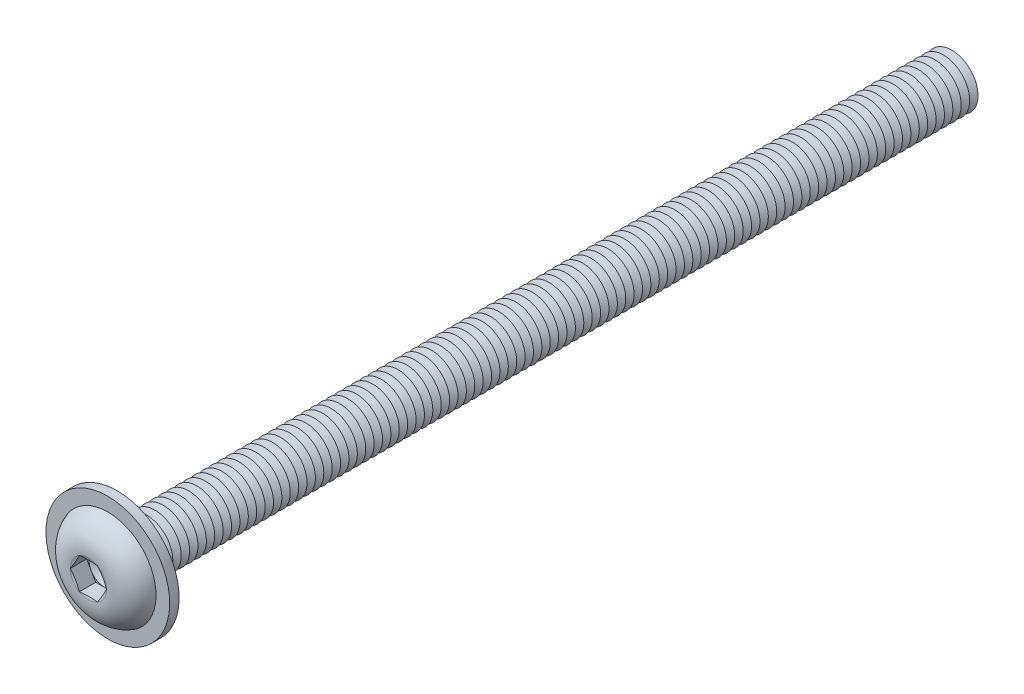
ISO-10303-21;
HEADER;
FILE_DESCRIPTION(('STEP AP214'),'2;1');
FILE_NAME('part.step','',(''),(''),'','','');
FILE_SCHEMA(('AUTOMOTIVE_DESIGN { 1 0 10303 214 1 1 1 1 }'));
ENDSEC;
DATA;
#1=APPLICATION_CONTEXT('core data for automotive mechanical design processes');
#2=APPLICATION_PROTOCOL_DEFINITION('international standard','automotive_design',2000,#1);
#3=PRODUCT_CONTEXT('',#1,'mechanical');
#4=PRODUCT('Part','Part','',(#3));
#5=PRODUCT_RELATED_PRODUCT_CATEGORY('part','',(#4));
#6=PRODUCT_DEFINITION_FORMATION('','',#4);
#7=PRODUCT_DEFINITION_CONTEXT('part definition',#1,'design');
#8=PRODUCT_DEFINITION('design','',#6,#7);
#9=PRODUCT_DEFINITION_SHAPE('','',#8);
#10=(LENGTH_UNIT() NAMED_UNIT(*) SI_UNIT(.MILLI.,.METRE.));
#11=(NAMED_UNIT(*) PLANE_ANGLE_UNIT() SI_UNIT($,.RADIAN.));
#12=(NAMED_UNIT(*) SI_UNIT($,.STERADIAN.) SOLID_ANGLE_UNIT());
#13=UNCERTAINTY_MEASURE_WITH_UNIT(LENGTH_MEASURE(1.E-05),#10,'distance_accuracy_value','');
#14=(GEOMETRIC_REPRESENTATION_CONTEXT(3) GLOBAL_UNCERTAINTY_ASSIGNED_CONTEXT((#13)) GLOBAL_UNIT_ASSIGNED_CONTEXT((#10,
#11,#12)) REPRESENTATION_CONTEXT('',''));
#15=CARTESIAN_POINT('',(0.,0.,0.));
#16=DIRECTION('',(0.,0.,1.));
#17=DIRECTION('',(1.,0.,0.));
#18=AXIS2_PLACEMENT_3D('',#15,#16,#17);
#19=CARTESIAN_POINT('',(0.,0.,-77.2));
#20=DIRECTION('',(0.,0.,1.));
#21=DIRECTION('',(0.,-1.,0.));
#22=AXIS2_PLACEMENT_3D('',#19,#20,#21);
#23=CONICAL_SURFACE('',#22,2.49999999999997,1.0471975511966);
#24=CARTESIAN_POINT('',(0.,0.,-77.6));
#25=DIRECTION('',(0.,0.,1.));
#26=DIRECTION('',(0.,-1.,0.));
#27=AXIS2_PLACEMENT_3D('',#24,#25,#26);
#28=CIRCLE('',#27,1.80717967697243);
#29=CARTESIAN_POINT('',(0.,-1.80717967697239,-77.6));
#30=VERTEX_POINT('',#29);
#31=EDGE_CURVE('E1008',#30,#30,#28,.T.);
#32=ORIENTED_EDGE('',*,*,#31,.T.);
#33=EDGE_LOOP('',(#32));
#34=FACE_BOUND('',#33,.T.);
#35=CARTESIAN_POINT('',(0.,0.,-77.2));
#36=DIRECTION('',(0.,0.,1.));
#37=DIRECTION('',(0.,-1.,0.));
#38=AXIS2_PLACEMENT_3D('',#35,#36,#37);
#39=CIRCLE('',#38,2.49999999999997);
#40=CARTESIAN_POINT('',(0.,-2.49999999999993,-77.2));
#41=VERTEX_POINT('',#40);
#42=EDGE_CURVE('E1004',#41,#41,#39,.T.);
#43=ORIENTED_EDGE('',*,*,#42,.F.);
#44=EDGE_LOOP('',(#43));
#45=FACE_BOUND('',#44,.T.);
#46=ADVANCED_FACE('F39',(#34,#45),#23,.T.);
#47=CARTESIAN_POINT('',(0.,0.,-77.6));
#48=DIRECTION('',(0.,0.,-1.));
#49=DIRECTION('',(0.,1.,0.));
#50=AXIS2_PLACEMENT_3D('',#47,#48,#49);
#51=CONICAL_SURFACE('',#50,1.80717967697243,1.0471975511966);
#52=CARTESIAN_POINT('',(0.,0.,-78.));
#53=DIRECTION('',(0.,0.,1.));
#54=DIRECTION('',(0.,-1.,0.));
#55=AXIS2_PLACEMENT_3D('',#52,#53,#54);
#56=CIRCLE('',#55,2.49999999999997);
#57=CARTESIAN_POINT('',(0.,-2.49999999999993,-78.));
#58=VERTEX_POINT('',#57);
#59=EDGE_CURVE('E1012',#58,#58,#56,.T.);
#60=ORIENTED_EDGE('',*,*,#59,.T.);
#61=EDGE_LOOP('',(#60));
#62=FACE_BOUND('',#61,.T.);
#63=ORIENTED_EDGE('',*,*,#31,.F.);
#64=EDGE_LOOP('',(#63));
#65=FACE_BOUND('',#64,.T.);
#66=ADVANCED_FACE('F1128',(#62,#65),#51,.T.);
#67=CARTESIAN_POINT('',(0.,2.49999999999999,-80.));
#68=DIRECTION('',(0.,0.,-1.));
#69=DIRECTION('',(0.,1.,0.));
#70=AXIS2_PLACEMENT_3D('',#67,#68,#69);
#71=PLANE('',#70);
#72=CARTESIAN_POINT('',(0.,0.,-80.));
#73=DIRECTION('',(0.,0.,1.));
#74=DIRECTION('',(0.,-1.,0.));
#75=AXIS2_PLACEMENT_3D('',#72,#73,#74);
#76=CIRCLE('',#75,1.80717967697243);
#77=CARTESIAN_POINT('',(0.,-1.80717967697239,-80.));
#78=VERTEX_POINT('',#77);
#79=EDGE_CURVE('E1032',#78,#78,#76,.T.);
#80=ORIENTED_EDGE('',*,*,#79,.F.);
#81=EDGE_LOOP('',(#80));
#82=FACE_BOUND('',#81,.T.);
#83=ADVANCED_FACE('F1134',(#82),#71,.T.);
#84=CARTESIAN_POINT('',(0.,0.,-79.6));
#85=DIRECTION('',(0.,0.,1.));
#86=DIRECTION('',(0.,-1.,0.));
#87=AXIS2_PLACEMENT_3D('',#84,#85,#86);
#88=CONICAL_SURFACE('',#87,2.49999999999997,1.0471975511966);
#89=ORIENTED_EDGE('',*,*,#79,.T.);
#90=EDGE_LOOP('',(#89));
#91=FACE_BOUND('',#90,.T.);
#92=CARTESIAN_POINT('',(0.,0.,-79.6));
#93=DIRECTION('',(0.,0.,1.));
#94=DIRECTION('',(0.,-1.,0.));
#95=AXIS2_PLACEMENT_3D('',#92,#93,#94);
#96=CIRCLE('',#95,2.49999999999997);
#97=CARTESIAN_POINT('',(0.,-2.49999999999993,-79.6));
#98=VERTEX_POINT('',#97);
#99=EDGE_CURVE('E1028',#98,#98,#96,.T.);
#100=ORIENTED_EDGE('',*,*,#99,.F.);
#101=EDGE_LOOP('',(#100));
#102=FACE_BOUND('',#101,.T.);
#103=ADVANCED_FACE('F1153',(#91,#102),#88,.T.);
#104=CARTESIAN_POINT('',(0.,0.,-79.2));
#105=DIRECTION('',(0.,0.,-1.));
#106=DIRECTION('',(0.,1.,0.));
#107=AXIS2_PLACEMENT_3D('',#104,#105,#106);
#108=CONICAL_SURFACE('',#107,1.80717967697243,1.0471975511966);
#109=ORIENTED_EDGE('',*,*,#99,.T.);
#110=EDGE_LOOP('',(#109));
#111=FACE_BOUND('',#110,.T.);
#112=CARTESIAN_POINT('',(0.,0.,-79.2));
#113=DIRECTION('',(0.,0.,1.));
#114=DIRECTION('',(0.,-1.,0.));
#115=AXIS2_PLACEMENT_3D('',#112,#113,#114);
#116=CIRCLE('',#115,1.80717967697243);
#117=CARTESIAN_POINT('',(0.,-1.80717967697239,-79.2));
#118=VERTEX_POINT('',#117);
#119=EDGE_CURVE('E1024',#118,#118,#116,.T.);
#120=ORIENTED_EDGE('',*,*,#119,.F.);
#121=EDGE_LOOP('',(#120));
#122=FACE_BOUND('',#121,.T.);
#123=ADVANCED_FACE('F1150',(#111,#122),#108,.T.);
#124=CARTESIAN_POINT('',(0.,0.,-78.8));
#125=DIRECTION('',(0.,0.,1.));
#126=DIRECTION('',(0.,-1.,0.));
#127=AXIS2_PLACEMENT_3D('',#124,#125,#126);
#128=CONICAL_SURFACE('',#127,2.49999999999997,1.0471975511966);
#129=ORIENTED_EDGE('',*,*,#119,.T.);
#130=EDGE_LOOP('',(#129));
#131=FACE_BOUND('',#130,.T.);
#132=CARTESIAN_POINT('',(0.,0.,-78.8));
#133=DIRECTION('',(0.,0.,1.));
#134=DIRECTION('',(0.,-1.,0.));
#135=AXIS2_PLACEMENT_3D('',#132,#133,#134);
#136=CIRCLE('',#135,2.49999999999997);
#137=CARTESIAN_POINT('',(0.,-2.49999999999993,-78.8));
#138=VERTEX_POINT('',#137);
#139=EDGE_CURVE('E1020',#138,#138,#136,.T.);
#140=ORIENTED_EDGE('',*,*,#139,.F.);
#141=EDGE_LOOP('',(#140));
#142=FACE_BOUND('',#141,.T.);
#143=ADVANCED_FACE('F1144',(#131,#142),#128,.T.);
#144=CARTESIAN_POINT('',(0.,0.,-78.4));
#145=DIRECTION('',(0.,0.,-1.));
#146=DIRECTION('',(0.,1.,0.));
#147=AXIS2_PLACEMENT_3D('',#144,#145,#146);
#148=CONICAL_SURFACE('',#147,1.80717967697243,1.0471975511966);
#149=ORIENTED_EDGE('',*,*,#139,.T.);
#150=EDGE_LOOP('',(#149));
#151=FACE_BOUND('',#150,.T.);
#152=CARTESIAN_POINT('',(0.,0.,-78.4));
#153=DIRECTION('',(0.,0.,1.));
#154=DIRECTION('',(0.,-1.,0.));
#155=AXIS2_PLACEMENT_3D('',#152,#153,#154);
#156=CIRCLE('',#155,1.80717967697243);
#157=CARTESIAN_POINT('',(0.,-1.80717967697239,-78.4));
#158=VERTEX_POINT('',#157);
#159=EDGE_CURVE('E1016',#158,#158,#156,.T.);
#160=ORIENTED_EDGE('',*,*,#159,.F.);
#161=EDGE_LOOP('',(#160));
#162=FACE_BOUND('',#161,.T.);
#163=ADVANCED_FACE('F1140',(#151,#162),#148,.T.);
#164=CARTESIAN_POINT('',(0.,0.,-78.));
#165=DIRECTION('',(0.,0.,1.));
#166=DIRECTION('',(0.,-1.,0.));
#167=AXIS2_PLACEMENT_3D('',#164,#165,#166);
#168=CONICAL_SURFACE('',#167,2.49999999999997,1.0471975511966);
#169=ORIENTED_EDGE('',*,*,#159,.T.);
#170=EDGE_LOOP('',(#169));
#171=FACE_BOUND('',#170,.T.);
#172=ORIENTED_EDGE('',*,*,#59,.F.);
#173=EDGE_LOOP('',(#172));
#174=FACE_BOUND('',#173,.T.);
#175=ADVANCED_FACE('F1143',(#171,#174),#168,.T.);
#176=CARTESIAN_POINT('',(0.,0.,-76.4));
#177=DIRECTION('',(0.,0.,1.));
#178=DIRECTION('',(0.,-1.,0.));
#179=AXIS2_PLACEMENT_3D('',#176,#177,#178);
#180=CONICAL_SURFACE('',#179,2.49999999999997,1.0471975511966);
#181=CARTESIAN_POINT('',(0.,0.,-76.8));
#182=DIRECTION('',(0.,0.,1.));
#183=DIRECTION('',(0.,-1.,0.));
#184=AXIS2_PLACEMENT_3D('',#181,#182,#183);
#185=CIRCLE('',#184,1.80717967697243);
#186=CARTESIAN_POINT('',(0.,-1.80717967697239,-76.8));
#187=VERTEX_POINT('',#186);
#188=EDGE_CURVE('E1000',#187,#187,#185,.T.);
#189=ORIENTED_EDGE('',*,*,#188,.T.);
#190=EDGE_LOOP('',(#189));
#191=FACE_BOUND('',#190,.T.);
#192=CARTESIAN_POINT('',(0.,0.,-76.4));
#193=DIRECTION('',(0.,0.,1.));
#194=DIRECTION('',(0.,-1.,0.));
#195=AXIS2_PLACEMENT_3D('',#192,#193,#194);
#196=CIRCLE('',#195,2.49999999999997);
#197=CARTESIAN_POINT('',(0.,-2.49999999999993,-76.4));
#198=VERTEX_POINT('',#197);
#199=EDGE_CURVE('E996',#198,#198,#196,.T.);
#200=ORIENTED_EDGE('',*,*,#199,.F.);
#201=EDGE_LOOP('',(#200));
#202=FACE_BOUND('',#201,.T.);
#203=ADVANCED_FACE('F1148',(#191,#202),#180,.T.);
#204=CARTESIAN_POINT('',(0.,0.,-76.8));
#205=DIRECTION('',(0.,0.,-1.));
#206=DIRECTION('',(0.,1.,0.));
#207=AXIS2_PLACEMENT_3D('',#204,#205,#206);
#208=CONICAL_SURFACE('',#207,1.80717967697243,1.0471975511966);
#209=ORIENTED_EDGE('',*,*,#42,.T.);
#210=EDGE_LOOP('',(#209));
#211=FACE_BOUND('',#210,.T.);
#212=ORIENTED_EDGE('',*,*,#188,.F.);
#213=EDGE_LOOP('',(#212));
#214=FACE_BOUND('',#213,.T.);
#215=ADVANCED_FACE('F1199',(#211,#214),#208,.T.);
#216=CARTESIAN_POINT('',(0.,0.,-75.6));
#217=DIRECTION('',(0.,0.,1.));
#218=DIRECTION('',(0.,-1.,0.));
#219=AXIS2_PLACEMENT_3D('',#216,#217,#218);
#220=CONICAL_SURFACE('',#219,2.49999999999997,1.0471975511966);
#221=CARTESIAN_POINT('',(0.,0.,-76.));
#222=DIRECTION('',(0.,0.,1.));
#223=DIRECTION('',(0.,-1.,0.));
#224=AXIS2_PLACEMENT_3D('',#221,#222,#223);
#225=CIRCLE('',#224,1.80717967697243);
#226=CARTESIAN_POINT('',(0.,-1.80717967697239,-76.));
#227=VERTEX_POINT('',#226);
#228=EDGE_CURVE('E992',#227,#227,#225,.T.);
#229=ORIENTED_EDGE('',*,*,#228,.T.);
#230=EDGE_LOOP('',(#229));
#231=FACE_BOUND('',#230,.T.);
#232=CARTESIAN_POINT('',(0.,0.,-75.6));
#233=DIRECTION('',(0.,0.,1.));
#234=DIRECTION('',(0.,-1.,0.));
#235=AXIS2_PLACEMENT_3D('',#232,#233,#234);
#236=CIRCLE('',#235,2.49999999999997);
#237=CARTESIAN_POINT('',(0.,-2.49999999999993,-75.6));
#238=VERTEX_POINT('',#237);
#239=EDGE_CURVE('E988',#238,#238,#236,.T.);
#240=ORIENTED_EDGE('',*,*,#239,.F.);
#241=EDGE_LOOP('',(#240));
#242=FACE_BOUND('',#241,.T.);
#243=ADVANCED_FACE('F1205',(#231,#242),#220,.T.);
#244=CARTESIAN_POINT('',(0.,0.,-76.));
#245=DIRECTION('',(0.,0.,-1.));
#246=DIRECTION('',(0.,1.,0.));
#247=AXIS2_PLACEMENT_3D('',#244,#245,#246);
#248=CONICAL_SURFACE('',#247,1.80717967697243,1.0471975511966);
#249=ORIENTED_EDGE('',*,*,#199,.T.);
#250=EDGE_LOOP('',(#249));
#251=FACE_BOUND('',#250,.T.);
#252=ORIENTED_EDGE('',*,*,#228,.F.);
#253=EDGE_LOOP('',(#252));
#254=FACE_BOUND('',#253,.T.);
#255=ADVANCED_FACE('F1212',(#251,#254),#248,.T.);
#256=CARTESIAN_POINT('',(0.,0.,-74.8));
#257=DIRECTION('',(0.,0.,1.));
#258=DIRECTION('',(0.,-1.,0.));
#259=AXIS2_PLACEMENT_3D('',#256,#257,#258);
#260=CONICAL_SURFACE('',#259,2.49999999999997,1.0471975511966);
#261=CARTESIAN_POINT('',(0.,0.,-75.2));
#262=DIRECTION('',(0.,0.,1.));
#263=DIRECTION('',(0.,-1.,0.));
#264=AXIS2_PLACEMENT_3D('',#261,#262,#263);
#265=CIRCLE('',#264,1.80717967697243);
#266=CARTESIAN_POINT('',(0.,-1.80717967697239,-75.2));
#267=VERTEX_POINT('',#266);
#268=EDGE_CURVE('E984',#267,#267,#265,.T.);
#269=ORIENTED_EDGE('',*,*,#268,.T.);
#270=EDGE_LOOP('',(#269));
#271=FACE_BOUND('',#270,.T.);
#272=CARTESIAN_POINT('',(0.,0.,-74.8));
#273=DIRECTION('',(0.,0.,1.));
#274=DIRECTION('',(0.,-1.,0.));
#275=AXIS2_PLACEMENT_3D('',#272,#273,#274);
#276=CIRCLE('',#275,2.49999999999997);
#277=CARTESIAN_POINT('',(0.,-2.49999999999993,-74.8));
#278=VERTEX_POINT('',#277);
#279=EDGE_CURVE('E980',#278,#278,#276,.T.);
#280=ORIENTED_EDGE('',*,*,#279,.F.);
#281=EDGE_LOOP('',(#280));
#282=FACE_BOUND('',#281,.T.);
#283=ADVANCED_FACE('F1219',(#271,#282),#260,.T.);
#284=CARTESIAN_POINT('',(0.,0.,-75.2));
#285=DIRECTION('',(0.,0.,-1.));
#286=DIRECTION('',(0.,1.,0.));
#287=AXIS2_PLACEMENT_3D('',#284,#285,#286);
#288=CONICAL_SURFACE('',#287,1.80717967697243,1.0471975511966);
#289=ORIENTED_EDGE('',*,*,#239,.T.);
#290=EDGE_LOOP('',(#289));
#291=FACE_BOUND('',#290,.T.);
#292=ORIENTED_EDGE('',*,*,#268,.F.);
#293=EDGE_LOOP('',(#292));
#294=FACE_BOUND('',#293,.T.);
#295=ADVANCED_FACE('F1226',(#291,#294),#288,.T.);
#296=CARTESIAN_POINT('',(0.,0.,-74.));
#297=DIRECTION('',(0.,0.,1.));
#298=DIRECTION('',(0.,-1.,0.));
#299=AXIS2_PLACEMENT_3D('',#296,#297,#298);
#300=CONICAL_SURFACE('',#299,2.49999999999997,1.0471975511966);
#301=CARTESIAN_POINT('',(0.,0.,-74.4));
#302=DIRECTION('',(0.,0.,1.));
#303=DIRECTION('',(0.,-1.,0.));
#304=AXIS2_PLACEMENT_3D('',#301,#302,#303);
#305=CIRCLE('',#304,1.80717967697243);
#306=CARTESIAN_POINT('',(0.,-1.80717967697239,-74.4));
#307=VERTEX_POINT('',#306);
#308=EDGE_CURVE('E976',#307,#307,#305,.T.);
#309=ORIENTED_EDGE('',*,*,#308,.T.);
#310=EDGE_LOOP('',(#309));
#311=FACE_BOUND('',#310,.T.);
#312=CARTESIAN_POINT('',(0.,0.,-74.));
#313=DIRECTION('',(0.,0.,1.));
#314=DIRECTION('',(0.,-1.,0.));
#315=AXIS2_PLACEMENT_3D('',#312,#313,#314);
#316=CIRCLE('',#315,2.49999999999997);
#317=CARTESIAN_POINT('',(0.,-2.49999999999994,-74.));
#318=VERTEX_POINT('',#317);
#319=EDGE_CURVE('E972',#318,#318,#316,.T.);
#320=ORIENTED_EDGE('',*,*,#319,.F.);
#321=EDGE_LOOP('',(#320));
#322=FACE_BOUND('',#321,.T.);
#323=ADVANCED_FACE('F1233',(#311,#322),#300,.T.);
#324=CARTESIAN_POINT('',(0.,0.,-74.4));
#325=DIRECTION('',(0.,0.,-1.));
#326=DIRECTION('',(0.,1.,0.));
#327=AXIS2_PLACEMENT_3D('',#324,#325,#326);
#328=CONICAL_SURFACE('',#327,1.80717967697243,1.0471975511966);
#329=ORIENTED_EDGE('',*,*,#279,.T.);
#330=EDGE_LOOP('',(#329));
#331=FACE_BOUND('',#330,.T.);
#332=ORIENTED_EDGE('',*,*,#308,.F.);
#333=EDGE_LOOP('',(#332));
#334=FACE_BOUND('',#333,.T.);
#335=ADVANCED_FACE('F1240',(#331,#334),#328,.T.);
#336=CARTESIAN_POINT('',(0.,0.,-73.2));
#337=DIRECTION('',(0.,0.,1.));
#338=DIRECTION('',(0.,-1.,0.));
#339=AXIS2_PLACEMENT_3D('',#336,#337,#338);
#340=CONICAL_SURFACE('',#339,2.49999999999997,1.0471975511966);
#341=CARTESIAN_POINT('',(0.,0.,-73.6));
#342=DIRECTION('',(0.,0.,1.));
#343=DIRECTION('',(0.,-1.,0.));
#344=AXIS2_PLACEMENT_3D('',#341,#342,#343);
#345=CIRCLE('',#344,1.80717967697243);
#346=CARTESIAN_POINT('',(0.,-1.80717967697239,-73.6));
#347=VERTEX_POINT('',#346);
#348=EDGE_CURVE('E968',#347,#347,#345,.T.);
#349=ORIENTED_EDGE('',*,*,#348,.T.);
#350=EDGE_LOOP('',(#349));
#351=FACE_BOUND('',#350,.T.);
#352=CARTESIAN_POINT('',(0.,0.,-73.2));
#353=DIRECTION('',(0.,0.,1.));
#354=DIRECTION('',(0.,-1.,0.));
#355=AXIS2_PLACEMENT_3D('',#352,#353,#354);
#356=CIRCLE('',#355,2.49999999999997);
#357=CARTESIAN_POINT('',(0.,-2.49999999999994,-73.2));
#358=VERTEX_POINT('',#357);
#359=EDGE_CURVE('E964',#358,#358,#356,.T.);
#360=ORIENTED_EDGE('',*,*,#359,.F.);
#361=EDGE_LOOP('',(#360));
#362=FACE_BOUND('',#361,.T.);
#363=ADVANCED_FACE('F1247',(#351,#362),#340,.T.);
#364=CARTESIAN_POINT('',(0.,0.,-73.6));
#365=DIRECTION('',(0.,0.,-1.));
#366=DIRECTION('',(0.,1.,0.));
#367=AXIS2_PLACEMENT_3D('',#364,#365,#366);
#368=CONICAL_SURFACE('',#367,1.80717967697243,1.0471975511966);
#369=ORIENTED_EDGE('',*,*,#319,.T.);
#370=EDGE_LOOP('',(#369));
#371=FACE_BOUND('',#370,.T.);
#372=ORIENTED_EDGE('',*,*,#348,.F.);
#373=EDGE_LOOP('',(#372));
#374=FACE_BOUND('',#373,.T.);
#375=ADVANCED_FACE('F1254',(#371,#374),#368,.T.);
#376=CARTESIAN_POINT('',(0.,0.,-72.4));
#377=DIRECTION('',(0.,0.,1.));
#378=DIRECTION('',(0.,-1.,0.));
#379=AXIS2_PLACEMENT_3D('',#376,#377,#378);
#380=CONICAL_SURFACE('',#379,2.49999999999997,1.0471975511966);
#381=CARTESIAN_POINT('',(0.,0.,-72.8));
#382=DIRECTION('',(0.,0.,1.));
#383=DIRECTION('',(0.,-1.,0.));
#384=AXIS2_PLACEMENT_3D('',#381,#382,#383);
#385=CIRCLE('',#384,1.80717967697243);
#386=CARTESIAN_POINT('',(0.,-1.80717967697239,-72.8));
#387=VERTEX_POINT('',#386);
#388=EDGE_CURVE('E960',#387,#387,#385,.T.);
#389=ORIENTED_EDGE('',*,*,#388,.T.);
#390=EDGE_LOOP('',(#389));
#391=FACE_BOUND('',#390,.T.);
#392=CARTESIAN_POINT('',(0.,0.,-72.4));
#393=DIRECTION('',(0.,0.,1.));
#394=DIRECTION('',(0.,-1.,0.));
#395=AXIS2_PLACEMENT_3D('',#392,#393,#394);
#396=CIRCLE('',#395,2.49999999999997);
#397=CARTESIAN_POINT('',(0.,-2.49999999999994,-72.4));
#398=VERTEX_POINT('',#397);
#399=EDGE_CURVE('E956',#398,#398,#396,.T.);
#400=ORIENTED_EDGE('',*,*,#399,.F.);
#401=EDGE_LOOP('',(#400));
#402=FACE_BOUND('',#401,.T.);
#403=ADVANCED_FACE('F1261',(#391,#402),#380,.T.);
#404=CARTESIAN_POINT('',(0.,0.,-72.8));
#405=DIRECTION('',(0.,0.,-1.));
#406=DIRECTION('',(0.,1.,0.));
#407=AXIS2_PLACEMENT_3D('',#404,#405,#406);
#408=CONICAL_SURFACE('',#407,1.80717967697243,1.0471975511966);
#409=ORIENTED_EDGE('',*,*,#359,.T.);
#410=EDGE_LOOP('',(#409));
#411=FACE_BOUND('',#410,.T.);
#412=ORIENTED_EDGE('',*,*,#388,.F.);
#413=EDGE_LOOP('',(#412));
#414=FACE_BOUND('',#413,.T.);
#415=ADVANCED_FACE('F1268',(#411,#414),#408,.T.);
#416=CARTESIAN_POINT('',(0.,0.,-71.6));
#417=DIRECTION('',(0.,0.,1.));
#418=DIRECTION('',(0.,-1.,0.));
#419=AXIS2_PLACEMENT_3D('',#416,#417,#418);
#420=CONICAL_SURFACE('',#419,2.49999999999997,1.0471975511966);
#421=CARTESIAN_POINT('',(0.,0.,-72.));
#422=DIRECTION('',(0.,0.,1.));
#423=DIRECTION('',(0.,-1.,0.));
#424=AXIS2_PLACEMENT_3D('',#421,#422,#423);
#425=CIRCLE('',#424,1.80717967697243);
#426=CARTESIAN_POINT('',(0.,-1.80717967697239,-72.));
#427=VERTEX_POINT('',#426);
#428=EDGE_CURVE('E952',#427,#427,#425,.T.);
#429=ORIENTED_EDGE('',*,*,#428,.T.);
#430=EDGE_LOOP('',(#429));
#431=FACE_BOUND('',#430,.T.);
#432=CARTESIAN_POINT('',(0.,0.,-71.6));
#433=DIRECTION('',(0.,0.,1.));
#434=DIRECTION('',(0.,-1.,0.));
#435=AXIS2_PLACEMENT_3D('',#432,#433,#434);
#436=CIRCLE('',#435,2.49999999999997);
#437=CARTESIAN_POINT('',(0.,-2.49999999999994,-71.6));
#438=VERTEX_POINT('',#437);
#439=EDGE_CURVE('E948',#438,#438,#436,.T.);
#440=ORIENTED_EDGE('',*,*,#439,.F.);
#441=EDGE_LOOP('',(#440));
#442=FACE_BOUND('',#441,.T.);
#443=ADVANCED_FACE('F1275',(#431,#442),#420,.T.);
#444=CARTESIAN_POINT('',(0.,0.,-72.));
#445=DIRECTION('',(0.,0.,-1.));
#446=DIRECTION('',(0.,1.,0.));
#447=AXIS2_PLACEMENT_3D('',#444,#445,#446);
#448=CONICAL_SURFACE('',#447,1.80717967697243,1.0471975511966);
#449=ORIENTED_EDGE('',*,*,#399,.T.);
#450=EDGE_LOOP('',(#449));
#451=FACE_BOUND('',#450,.T.);
#452=ORIENTED_EDGE('',*,*,#428,.F.);
#453=EDGE_LOOP('',(#452));
#454=FACE_BOUND('',#453,.T.);
#455=ADVANCED_FACE('F1282',(#451,#454),#448,.T.);
#456=CARTESIAN_POINT('',(0.,0.,-70.8));
#457=DIRECTION('',(0.,0.,1.));
#458=DIRECTION('',(0.,-1.,0.));
#459=AXIS2_PLACEMENT_3D('',#456,#457,#458);
#460=CONICAL_SURFACE('',#459,2.49999999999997,1.0471975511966);
#461=CARTESIAN_POINT('',(0.,0.,-71.2));
#462=DIRECTION('',(0.,0.,1.));
#463=DIRECTION('',(0.,-1.,0.));
#464=AXIS2_PLACEMENT_3D('',#461,#462,#463);
#465=CIRCLE('',#464,1.80717967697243);
#466=CARTESIAN_POINT('',(0.,-1.80717967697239,-71.2));
#467=VERTEX_POINT('',#466);
#468=EDGE_CURVE('E944',#467,#467,#465,.T.);
#469=ORIENTED_EDGE('',*,*,#468,.T.);
#470=EDGE_LOOP('',(#469));
#471=FACE_BOUND('',#470,.T.);
#472=CARTESIAN_POINT('',(0.,0.,-70.8));
#473=DIRECTION('',(0.,0.,1.));
#474=DIRECTION('',(0.,-1.,0.));
#475=AXIS2_PLACEMENT_3D('',#472,#473,#474);
#476=CIRCLE('',#475,2.49999999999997);
#477=CARTESIAN_POINT('',(0.,-2.49999999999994,-70.8));
#478=VERTEX_POINT('',#477);
#479=EDGE_CURVE('E940',#478,#478,#476,.T.);
#480=ORIENTED_EDGE('',*,*,#479,.F.);
#481=EDGE_LOOP('',(#480));
#482=FACE_BOUND('',#481,.T.);
#483=ADVANCED_FACE('F1289',(#471,#482),#460,.T.);
#484=CARTESIAN_POINT('',(0.,0.,-71.2));
#485=DIRECTION('',(0.,0.,-1.));
#486=DIRECTION('',(0.,1.,0.));
#487=AXIS2_PLACEMENT_3D('',#484,#485,#486);
#488=CONICAL_SURFACE('',#487,1.80717967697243,1.0471975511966);
#489=ORIENTED_EDGE('',*,*,#439,.T.);
#490=EDGE_LOOP('',(#489));
#491=FACE_BOUND('',#490,.T.);
#492=ORIENTED_EDGE('',*,*,#468,.F.);
#493=EDGE_LOOP('',(#492));
#494=FACE_BOUND('',#493,.T.);
#495=ADVANCED_FACE('F1296',(#491,#494),#488,.T.);
#496=CARTESIAN_POINT('',(0.,0.,-70.));
#497=DIRECTION('',(0.,0.,1.));
#498=DIRECTION('',(0.,-1.,0.));
#499=AXIS2_PLACEMENT_3D('',#496,#497,#498);
#500=CONICAL_SURFACE('',#499,2.49999999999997,1.0471975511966);
#501=CARTESIAN_POINT('',(0.,0.,-70.4));
#502=DIRECTION('',(0.,0.,1.));
#503=DIRECTION('',(0.,-1.,0.));
#504=AXIS2_PLACEMENT_3D('',#501,#502,#503);
#505=CIRCLE('',#504,1.80717967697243);
#506=CARTESIAN_POINT('',(0.,-1.80717967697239,-70.4));
#507=VERTEX_POINT('',#506);
#508=EDGE_CURVE('E936',#507,#507,#505,.T.);
#509=ORIENTED_EDGE('',*,*,#508,.T.);
#510=EDGE_LOOP('',(#509));
#511=FACE_BOUND('',#510,.T.);
#512=CARTESIAN_POINT('',(0.,0.,-70.));
#513=DIRECTION('',(0.,0.,1.));
#514=DIRECTION('',(0.,-1.,0.));
#515=AXIS2_PLACEMENT_3D('',#512,#513,#514);
#516=CIRCLE('',#515,2.49999999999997);
#517=CARTESIAN_POINT('',(0.,-2.49999999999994,-70.));
#518=VERTEX_POINT('',#517);
#519=EDGE_CURVE('E932',#518,#518,#516,.T.);
#520=ORIENTED_EDGE('',*,*,#519,.F.);
#521=EDGE_LOOP('',(#520));
#522=FACE_BOUND('',#521,.T.);
#523=ADVANCED_FACE('F1303',(#511,#522),#500,.T.);
#524=CARTESIAN_POINT('',(0.,0.,-70.4));
#525=DIRECTION('',(0.,0.,-1.));
#526=DIRECTION('',(0.,1.,0.));
#527=AXIS2_PLACEMENT_3D('',#524,#525,#526);
#528=CONICAL_SURFACE('',#527,1.80717967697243,1.0471975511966);
#529=ORIENTED_EDGE('',*,*,#479,.T.);
#530=EDGE_LOOP('',(#529));
#531=FACE_BOUND('',#530,.T.);
#532=ORIENTED_EDGE('',*,*,#508,.F.);
#533=EDGE_LOOP('',(#532));
#534=FACE_BOUND('',#533,.T.);
#535=ADVANCED_FACE('F1310',(#531,#534),#528,.T.);
#536=CARTESIAN_POINT('',(0.,0.,-69.2));
#537=DIRECTION('',(0.,0.,1.));
#538=DIRECTION('',(0.,-1.,0.));
#539=AXIS2_PLACEMENT_3D('',#536,#537,#538);
#540=CONICAL_SURFACE('',#539,2.49999999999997,1.0471975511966);
#541=CARTESIAN_POINT('',(0.,0.,-69.6));
#542=DIRECTION('',(0.,0.,1.));
#543=DIRECTION('',(0.,-1.,0.));
#544=AXIS2_PLACEMENT_3D('',#541,#542,#543);
#545=CIRCLE('',#544,1.80717967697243);
#546=CARTESIAN_POINT('',(0.,-1.80717967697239,-69.6));
#547=VERTEX_POINT('',#546);
#548=EDGE_CURVE('E928',#547,#547,#545,.T.);
#549=ORIENTED_EDGE('',*,*,#548,.T.);
#550=EDGE_LOOP('',(#549));
#551=FACE_BOUND('',#550,.T.);
#552=CARTESIAN_POINT('',(0.,0.,-69.2));
#553=DIRECTION('',(0.,0.,1.));
#554=DIRECTION('',(0.,-1.,0.));
#555=AXIS2_PLACEMENT_3D('',#552,#553,#554);
#556=CIRCLE('',#555,2.49999999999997);
#557=CARTESIAN_POINT('',(0.,-2.49999999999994,-69.2));
#558=VERTEX_POINT('',#557);
#559=EDGE_CURVE('E924',#558,#558,#556,.T.);
#560=ORIENTED_EDGE('',*,*,#559,.F.);
#561=EDGE_LOOP('',(#560));
#562=FACE_BOUND('',#561,.T.);
#563=ADVANCED_FACE('F1317',(#551,#562),#540,.T.);
#564=CARTESIAN_POINT('',(0.,0.,-69.6));
#565=DIRECTION('',(0.,0.,-1.));
#566=DIRECTION('',(0.,1.,0.));
#567=AXIS2_PLACEMENT_3D('',#564,#565,#566);
#568=CONICAL_SURFACE('',#567,1.80717967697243,1.0471975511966);
#569=ORIENTED_EDGE('',*,*,#519,.T.);
#570=EDGE_LOOP('',(#569));
#571=FACE_BOUND('',#570,.T.);
#572=ORIENTED_EDGE('',*,*,#548,.F.);
#573=EDGE_LOOP('',(#572));
#574=FACE_BOUND('',#573,.T.);
#575=ADVANCED_FACE('F1324',(#571,#574),#568,.T.);
#576=CARTESIAN_POINT('',(0.,0.,-68.4));
#577=DIRECTION('',(0.,0.,1.));
#578=DIRECTION('',(0.,-1.,0.));
#579=AXIS2_PLACEMENT_3D('',#576,#577,#578);
#580=CONICAL_SURFACE('',#579,2.49999999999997,1.0471975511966);
#581=CARTESIAN_POINT('',(0.,0.,-68.8));
#582=DIRECTION('',(0.,0.,1.));
#583=DIRECTION('',(0.,-1.,0.));
#584=AXIS2_PLACEMENT_3D('',#581,#582,#583);
#585=CIRCLE('',#584,1.80717967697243);
#586=CARTESIAN_POINT('',(0.,-1.80717967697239,-68.8));
#587=VERTEX_POINT('',#586);
#588=EDGE_CURVE('E920',#587,#587,#585,.T.);
#589=ORIENTED_EDGE('',*,*,#588,.T.);
#590=EDGE_LOOP('',(#589));
#591=FACE_BOUND('',#590,.T.);
#592=CARTESIAN_POINT('',(0.,0.,-68.4));
#593=DIRECTION('',(0.,0.,1.));
#594=DIRECTION('',(0.,-1.,0.));
#595=AXIS2_PLACEMENT_3D('',#592,#593,#594);
#596=CIRCLE('',#595,2.49999999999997);
#597=CARTESIAN_POINT('',(0.,-2.49999999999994,-68.4));
#598=VERTEX_POINT('',#597);
#599=EDGE_CURVE('E916',#598,#598,#596,.T.);
#600=ORIENTED_EDGE('',*,*,#599,.F.);
#601=EDGE_LOOP('',(#600));
#602=FACE_BOUND('',#601,.T.);
#603=ADVANCED_FACE('F1331',(#591,#602),#580,.T.);
#604=CARTESIAN_POINT('',(0.,0.,-68.8));
#605=DIRECTION('',(0.,0.,-1.));
#606=DIRECTION('',(0.,1.,0.));
#607=AXIS2_PLACEMENT_3D('',#604,#605,#606);
#608=CONICAL_SURFACE('',#607,1.80717967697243,1.0471975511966);
#609=ORIENTED_EDGE('',*,*,#559,.T.);
#610=EDGE_LOOP('',(#609));
#611=FACE_BOUND('',#610,.T.);
#612=ORIENTED_EDGE('',*,*,#588,.F.);
#613=EDGE_LOOP('',(#612));
#614=FACE_BOUND('',#613,.T.);
#615=ADVANCED_FACE('F1338',(#611,#614),#608,.T.);
#616=CARTESIAN_POINT('',(0.,0.,-67.6));
#617=DIRECTION('',(0.,0.,1.));
#618=DIRECTION('',(0.,-1.,0.));
#619=AXIS2_PLACEMENT_3D('',#616,#617,#618);
#620=CONICAL_SURFACE('',#619,2.49999999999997,1.0471975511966);
#621=CARTESIAN_POINT('',(0.,0.,-68.));
#622=DIRECTION('',(0.,0.,1.));
#623=DIRECTION('',(0.,-1.,0.));
#624=AXIS2_PLACEMENT_3D('',#621,#622,#623);
#625=CIRCLE('',#624,1.80717967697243);
#626=CARTESIAN_POINT('',(0.,-1.80717967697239,-68.));
#627=VERTEX_POINT('',#626);
#628=EDGE_CURVE('E912',#627,#627,#625,.T.);
#629=ORIENTED_EDGE('',*,*,#628,.T.);
#630=EDGE_LOOP('',(#629));
#631=FACE_BOUND('',#630,.T.);
#632=CARTESIAN_POINT('',(0.,0.,-67.6));
#633=DIRECTION('',(0.,0.,1.));
#634=DIRECTION('',(0.,-1.,0.));
#635=AXIS2_PLACEMENT_3D('',#632,#633,#634);
#636=CIRCLE('',#635,2.49999999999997);
#637=CARTESIAN_POINT('',(0.,-2.49999999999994,-67.6));
#638=VERTEX_POINT('',#637);
#639=EDGE_CURVE('E908',#638,#638,#636,.T.);
#640=ORIENTED_EDGE('',*,*,#639,.F.);
#641=EDGE_LOOP('',(#640));
#642=FACE_BOUND('',#641,.T.);
#643=ADVANCED_FACE('F1345',(#631,#642),#620,.T.);
#644=CARTESIAN_POINT('',(0.,0.,-68.));
#645=DIRECTION('',(0.,0.,-1.));
#646=DIRECTION('',(0.,1.,0.));
#647=AXIS2_PLACEMENT_3D('',#644,#645,#646);
#648=CONICAL_SURFACE('',#647,1.80717967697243,1.0471975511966);
#649=ORIENTED_EDGE('',*,*,#599,.T.);
#650=EDGE_LOOP('',(#649));
#651=FACE_BOUND('',#650,.T.);
#652=ORIENTED_EDGE('',*,*,#628,.F.);
#653=EDGE_LOOP('',(#652));
#654=FACE_BOUND('',#653,.T.);
#655=ADVANCED_FACE('F1352',(#651,#654),#648,.T.);
#656=CARTESIAN_POINT('',(0.,0.,-66.8));
#657=DIRECTION('',(0.,0.,1.));
#658=DIRECTION('',(0.,-1.,0.));
#659=AXIS2_PLACEMENT_3D('',#656,#657,#658);
#660=CONICAL_SURFACE('',#659,2.49999999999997,1.0471975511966);
#661=CARTESIAN_POINT('',(0.,0.,-67.2));
#662=DIRECTION('',(0.,0.,1.));
#663=DIRECTION('',(0.,-1.,0.));
#664=AXIS2_PLACEMENT_3D('',#661,#662,#663);
#665=CIRCLE('',#664,1.80717967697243);
#666=CARTESIAN_POINT('',(0.,-1.80717967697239,-67.2));
#667=VERTEX_POINT('',#666);
#668=EDGE_CURVE('E904',#667,#667,#665,.T.);
#669=ORIENTED_EDGE('',*,*,#668,.T.);
#670=EDGE_LOOP('',(#669));
#671=FACE_BOUND('',#670,.T.);
#672=CARTESIAN_POINT('',(0.,0.,-66.8));
#673=DIRECTION('',(0.,0.,1.));
#674=DIRECTION('',(0.,-1.,0.));
#675=AXIS2_PLACEMENT_3D('',#672,#673,#674);
#676=CIRCLE('',#675,2.49999999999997);
#677=CARTESIAN_POINT('',(0.,-2.49999999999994,-66.8));
#678=VERTEX_POINT('',#677);
#679=EDGE_CURVE('E900',#678,#678,#676,.T.);
#680=ORIENTED_EDGE('',*,*,#679,.F.);
#681=EDGE_LOOP('',(#680));
#682=FACE_BOUND('',#681,.T.);
#683=ADVANCED_FACE('F1359',(#671,#682),#660,.T.);
#684=CARTESIAN_POINT('',(0.,0.,-67.2));
#685=DIRECTION('',(0.,0.,-1.));
#686=DIRECTION('',(0.,1.,0.));
#687=AXIS2_PLACEMENT_3D('',#684,#685,#686);
#688=CONICAL_SURFACE('',#687,1.80717967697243,1.0471975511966);
#689=ORIENTED_EDGE('',*,*,#639,.T.);
#690=EDGE_LOOP('',(#689));
#691=FACE_BOUND('',#690,.T.);
#692=ORIENTED_EDGE('',*,*,#668,.F.);
#693=EDGE_LOOP('',(#692));
#694=FACE_BOUND('',#693,.T.);
#695=ADVANCED_FACE('F1366',(#691,#694),#688,.T.);
#696=CARTESIAN_POINT('',(0.,0.,-66.));
#697=DIRECTION('',(0.,0.,1.));
#698=DIRECTION('',(0.,-1.,0.));
#699=AXIS2_PLACEMENT_3D('',#696,#697,#698);
#700=CONICAL_SURFACE('',#699,2.49999999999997,1.0471975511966);
#701=CARTESIAN_POINT('',(0.,0.,-66.4));
#702=DIRECTION('',(0.,0.,1.));
#703=DIRECTION('',(0.,-1.,0.));
#704=AXIS2_PLACEMENT_3D('',#701,#702,#703);
#705=CIRCLE('',#704,1.80717967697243);
#706=CARTESIAN_POINT('',(0.,-1.80717967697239,-66.4));
#707=VERTEX_POINT('',#706);
#708=EDGE_CURVE('E896',#707,#707,#705,.T.);
#709=ORIENTED_EDGE('',*,*,#708,.T.);
#710=EDGE_LOOP('',(#709));
#711=FACE_BOUND('',#710,.T.);
#712=CARTESIAN_POINT('',(0.,0.,-66.));
#713=DIRECTION('',(0.,0.,1.));
#714=DIRECTION('',(0.,-1.,0.));
#715=AXIS2_PLACEMENT_3D('',#712,#713,#714);
#716=CIRCLE('',#715,2.49999999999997);
#717=CARTESIAN_POINT('',(0.,-2.49999999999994,-66.));
#718=VERTEX_POINT('',#717);
#719=EDGE_CURVE('E892',#718,#718,#716,.T.);
#720=ORIENTED_EDGE('',*,*,#719,.F.);
#721=EDGE_LOOP('',(#720));
#722=FACE_BOUND('',#721,.T.);
#723=ADVANCED_FACE('F1373',(#711,#722),#700,.T.);
#724=CARTESIAN_POINT('',(0.,0.,-66.4));
#725=DIRECTION('',(0.,0.,-1.));
#726=DIRECTION('',(0.,1.,0.));
#727=AXIS2_PLACEMENT_3D('',#724,#725,#726);
#728=CONICAL_SURFACE('',#727,1.80717967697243,1.0471975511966);
#729=ORIENTED_EDGE('',*,*,#679,.T.);
#730=EDGE_LOOP('',(#729));
#731=FACE_BOUND('',#730,.T.);
#732=ORIENTED_EDGE('',*,*,#708,.F.);
#733=EDGE_LOOP('',(#732));
#734=FACE_BOUND('',#733,.T.);
#735=ADVANCED_FACE('F1380',(#731,#734),#728,.T.);
#736=CARTESIAN_POINT('',(0.,0.,-65.2));
#737=DIRECTION('',(0.,0.,1.));
#738=DIRECTION('',(0.,-1.,0.));
#739=AXIS2_PLACEMENT_3D('',#736,#737,#738);
#740=CONICAL_SURFACE('',#739,2.49999999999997,1.0471975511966);
#741=CARTESIAN_POINT('',(0.,0.,-65.6));
#742=DIRECTION('',(0.,0.,1.));
#743=DIRECTION('',(0.,-1.,0.));
#744=AXIS2_PLACEMENT_3D('',#741,#742,#743);
#745=CIRCLE('',#744,1.80717967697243);
#746=CARTESIAN_POINT('',(0.,-1.80717967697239,-65.6));
#747=VERTEX_POINT('',#746);
#748=EDGE_CURVE('E888',#747,#747,#745,.T.);
#749=ORIENTED_EDGE('',*,*,#748,.T.);
#750=EDGE_LOOP('',(#749));
#751=FACE_BOUND('',#750,.T.);
#752=CARTESIAN_POINT('',(0.,0.,-65.2));
#753=DIRECTION('',(0.,0.,1.));
#754=DIRECTION('',(0.,-1.,0.));
#755=AXIS2_PLACEMENT_3D('',#752,#753,#754);
#756=CIRCLE('',#755,2.49999999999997);
#757=CARTESIAN_POINT('',(0.,-2.49999999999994,-65.2));
#758=VERTEX_POINT('',#757);
#759=EDGE_CURVE('E884',#758,#758,#756,.T.);
#760=ORIENTED_EDGE('',*,*,#759,.F.);
#761=EDGE_LOOP('',(#760));
#762=FACE_BOUND('',#761,.T.);
#763=ADVANCED_FACE('F1387',(#751,#762),#740,.T.);
#764=CARTESIAN_POINT('',(0.,0.,-65.6));
#765=DIRECTION('',(0.,0.,-1.));
#766=DIRECTION('',(0.,1.,0.));
#767=AXIS2_PLACEMENT_3D('',#764,#765,#766);
#768=CONICAL_SURFACE('',#767,1.80717967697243,1.0471975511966);
#769=ORIENTED_EDGE('',*,*,#719,.T.);
#770=EDGE_LOOP('',(#769));
#771=FACE_BOUND('',#770,.T.);
#772=ORIENTED_EDGE('',*,*,#748,.F.);
#773=EDGE_LOOP('',(#772));
#774=FACE_BOUND('',#773,.T.);
#775=ADVANCED_FACE('F1394',(#771,#774),#768,.T.);
#776=CARTESIAN_POINT('',(0.,0.,-64.4));
#777=DIRECTION('',(0.,0.,1.));
#778=DIRECTION('',(0.,-1.,0.));
#779=AXIS2_PLACEMENT_3D('',#776,#777,#778);
#780=CONICAL_SURFACE('',#779,2.49999999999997,1.0471975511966);
#781=CARTESIAN_POINT('',(0.,0.,-64.8));
#782=DIRECTION('',(0.,0.,1.));
#783=DIRECTION('',(0.,-1.,0.));
#784=AXIS2_PLACEMENT_3D('',#781,#782,#783);
#785=CIRCLE('',#784,1.80717967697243);
#786=CARTESIAN_POINT('',(0.,-1.80717967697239,-64.8));
#787=VERTEX_POINT('',#786);
#788=EDGE_CURVE('E880',#787,#787,#785,.T.);
#789=ORIENTED_EDGE('',*,*,#788,.T.);
#790=EDGE_LOOP('',(#789));
#791=FACE_BOUND('',#790,.T.);
#792=CARTESIAN_POINT('',(0.,0.,-64.4));
#793=DIRECTION('',(0.,0.,1.));
#794=DIRECTION('',(0.,-1.,0.));
#795=AXIS2_PLACEMENT_3D('',#792,#793,#794);
#796=CIRCLE('',#795,2.49999999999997);
#797=CARTESIAN_POINT('',(0.,-2.49999999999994,-64.4));
#798=VERTEX_POINT('',#797);
#799=EDGE_CURVE('E876',#798,#798,#796,.T.);
#800=ORIENTED_EDGE('',*,*,#799,.F.);
#801=EDGE_LOOP('',(#800));
#802=FACE_BOUND('',#801,.T.);
#803=ADVANCED_FACE('F1401',(#791,#802),#780,.T.);
#804=CARTESIAN_POINT('',(0.,0.,-64.8));
#805=DIRECTION('',(0.,0.,-1.));
#806=DIRECTION('',(0.,1.,0.));
#807=AXIS2_PLACEMENT_3D('',#804,#805,#806);
#808=CONICAL_SURFACE('',#807,1.80717967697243,1.0471975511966);
#809=ORIENTED_EDGE('',*,*,#759,.T.);
#810=EDGE_LOOP('',(#809));
#811=FACE_BOUND('',#810,.T.);
#812=ORIENTED_EDGE('',*,*,#788,.F.);
#813=EDGE_LOOP('',(#812));
#814=FACE_BOUND('',#813,.T.);
#815=ADVANCED_FACE('F1408',(#811,#814),#808,.T.);
#816=CARTESIAN_POINT('',(0.,0.,-63.6));
#817=DIRECTION('',(0.,0.,1.));
#818=DIRECTION('',(0.,-1.,0.));
#819=AXIS2_PLACEMENT_3D('',#816,#817,#818);
#820=CONICAL_SURFACE('',#819,2.49999999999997,1.0471975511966);
#821=CARTESIAN_POINT('',(0.,0.,-64.));
#822=DIRECTION('',(0.,0.,1.));
#823=DIRECTION('',(0.,-1.,0.));
#824=AXIS2_PLACEMENT_3D('',#821,#822,#823);
#825=CIRCLE('',#824,1.80717967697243);
#826=CARTESIAN_POINT('',(0.,-1.80717967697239,-64.));
#827=VERTEX_POINT('',#826);
#828=EDGE_CURVE('E872',#827,#827,#825,.T.);
#829=ORIENTED_EDGE('',*,*,#828,.T.);
#830=EDGE_LOOP('',(#829));
#831=FACE_BOUND('',#830,.T.);
#832=CARTESIAN_POINT('',(0.,0.,-63.6));
#833=DIRECTION('',(0.,0.,1.));
#834=DIRECTION('',(0.,-1.,0.));
#835=AXIS2_PLACEMENT_3D('',#832,#833,#834);
#836=CIRCLE('',#835,2.49999999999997);
#837=CARTESIAN_POINT('',(0.,-2.49999999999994,-63.6));
#838=VERTEX_POINT('',#837);
#839=EDGE_CURVE('E868',#838,#838,#836,.T.);
#840=ORIENTED_EDGE('',*,*,#839,.F.);
#841=EDGE_LOOP('',(#840));
#842=FACE_BOUND('',#841,.T.);
#843=ADVANCED_FACE('F1415',(#831,#842),#820,.T.);
#844=CARTESIAN_POINT('',(0.,0.,-64.));
#845=DIRECTION('',(0.,0.,-1.));
#846=DIRECTION('',(0.,1.,0.));
#847=AXIS2_PLACEMENT_3D('',#844,#845,#846);
#848=CONICAL_SURFACE('',#847,1.80717967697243,1.0471975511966);
#849=ORIENTED_EDGE('',*,*,#799,.T.);
#850=EDGE_LOOP('',(#849));
#851=FACE_BOUND('',#850,.T.);
#852=ORIENTED_EDGE('',*,*,#828,.F.);
#853=EDGE_LOOP('',(#852));
#854=FACE_BOUND('',#853,.T.);
#855=ADVANCED_FACE('F1422',(#851,#854),#848,.T.);
#856=CARTESIAN_POINT('',(0.,0.,-62.8));
#857=DIRECTION('',(0.,0.,1.));
#858=DIRECTION('',(0.,-1.,0.));
#859=AXIS2_PLACEMENT_3D('',#856,#857,#858);
#860=CONICAL_SURFACE('',#859,2.49999999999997,1.0471975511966);
#861=CARTESIAN_POINT('',(0.,0.,-63.2));
#862=DIRECTION('',(0.,0.,1.));
#863=DIRECTION('',(0.,-1.,0.));
#864=AXIS2_PLACEMENT_3D('',#861,#862,#863);
#865=CIRCLE('',#864,1.80717967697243);
#866=CARTESIAN_POINT('',(0.,-1.80717967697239,-63.2));
#867=VERTEX_POINT('',#866);
#868=EDGE_CURVE('E864',#867,#867,#865,.T.);
#869=ORIENTED_EDGE('',*,*,#868,.T.);
#870=EDGE_LOOP('',(#869));
#871=FACE_BOUND('',#870,.T.);
#872=CARTESIAN_POINT('',(0.,0.,-62.8));
#873=DIRECTION('',(0.,0.,1.));
#874=DIRECTION('',(0.,-1.,0.));
#875=AXIS2_PLACEMENT_3D('',#872,#873,#874);
#876=CIRCLE('',#875,2.49999999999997);
#877=CARTESIAN_POINT('',(0.,-2.49999999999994,-62.8));
#878=VERTEX_POINT('',#877);
#879=EDGE_CURVE('E860',#878,#878,#876,.T.);
#880=ORIENTED_EDGE('',*,*,#879,.F.);
#881=EDGE_LOOP('',(#880));
#882=FACE_BOUND('',#881,.T.);
#883=ADVANCED_FACE('F1429',(#871,#882),#860,.T.);
#884=CARTESIAN_POINT('',(0.,0.,-63.2));
#885=DIRECTION('',(0.,0.,-1.));
#886=DIRECTION('',(0.,1.,0.));
#887=AXIS2_PLACEMENT_3D('',#884,#885,#886);
#888=CONICAL_SURFACE('',#887,1.80717967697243,1.0471975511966);
#889=ORIENTED_EDGE('',*,*,#839,.T.);
#890=EDGE_LOOP('',(#889));
#891=FACE_BOUND('',#890,.T.);
#892=ORIENTED_EDGE('',*,*,#868,.F.);
#893=EDGE_LOOP('',(#892));
#894=FACE_BOUND('',#893,.T.);
#895=ADVANCED_FACE('F1436',(#891,#894),#888,.T.);
#896=CARTESIAN_POINT('',(0.,0.,-62.));
#897=DIRECTION('',(0.,0.,1.));
#898=DIRECTION('',(0.,-1.,0.));
#899=AXIS2_PLACEMENT_3D('',#896,#897,#898);
#900=CONICAL_SURFACE('',#899,2.49999999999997,1.0471975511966);
#901=CARTESIAN_POINT('',(0.,0.,-62.4));
#902=DIRECTION('',(0.,0.,1.));
#903=DIRECTION('',(0.,-1.,0.));
#904=AXIS2_PLACEMENT_3D('',#901,#902,#903);
#905=CIRCLE('',#904,1.80717967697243);
#906=CARTESIAN_POINT('',(0.,-1.80717967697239,-62.4));
#907=VERTEX_POINT('',#906);
#908=EDGE_CURVE('E856',#907,#907,#905,.T.);
#909=ORIENTED_EDGE('',*,*,#908,.T.);
#910=EDGE_LOOP('',(#909));
#911=FACE_BOUND('',#910,.T.);
#912=CARTESIAN_POINT('',(0.,0.,-62.));
#913=DIRECTION('',(0.,0.,1.));
#914=DIRECTION('',(0.,-1.,0.));
#915=AXIS2_PLACEMENT_3D('',#912,#913,#914);
#916=CIRCLE('',#915,2.49999999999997);
#917=CARTESIAN_POINT('',(0.,-2.49999999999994,-62.));
#918=VERTEX_POINT('',#917);
#919=EDGE_CURVE('E852',#918,#918,#916,.T.);
#920=ORIENTED_EDGE('',*,*,#919,.F.);
#921=EDGE_LOOP('',(#920));
#922=FACE_BOUND('',#921,.T.);
#923=ADVANCED_FACE('F1443',(#911,#922),#900,.T.);
#924=CARTESIAN_POINT('',(0.,0.,-62.4));
#925=DIRECTION('',(0.,0.,-1.));
#926=DIRECTION('',(0.,1.,0.));
#927=AXIS2_PLACEMENT_3D('',#924,#925,#926);
#928=CONICAL_SURFACE('',#927,1.80717967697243,1.0471975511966);
#929=ORIENTED_EDGE('',*,*,#879,.T.);
#930=EDGE_LOOP('',(#929));
#931=FACE_BOUND('',#930,.T.);
#932=ORIENTED_EDGE('',*,*,#908,.F.);
#933=EDGE_LOOP('',(#932));
#934=FACE_BOUND('',#933,.T.);
#935=ADVANCED_FACE('F1450',(#931,#934),#928,.T.);
#936=CARTESIAN_POINT('',(0.,0.,-61.2));
#937=DIRECTION('',(0.,0.,1.));
#938=DIRECTION('',(0.,-1.,0.));
#939=AXIS2_PLACEMENT_3D('',#936,#937,#938);
#940=CONICAL_SURFACE('',#939,2.49999999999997,1.0471975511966);
#941=CARTESIAN_POINT('',(0.,0.,-61.6));
#942=DIRECTION('',(0.,0.,1.));
#943=DIRECTION('',(0.,-1.,0.));
#944=AXIS2_PLACEMENT_3D('',#941,#942,#943);
#945=CIRCLE('',#944,1.80717967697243);
#946=CARTESIAN_POINT('',(0.,-1.80717967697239,-61.6));
#947=VERTEX_POINT('',#946);
#948=EDGE_CURVE('E848',#947,#947,#945,.T.);
#949=ORIENTED_EDGE('',*,*,#948,.T.);
#950=EDGE_LOOP('',(#949));
#951=FACE_BOUND('',#950,.T.);
#952=CARTESIAN_POINT('',(0.,0.,-61.2));
#953=DIRECTION('',(0.,0.,1.));
#954=DIRECTION('',(0.,-1.,0.));
#955=AXIS2_PLACEMENT_3D('',#952,#953,#954);
#956=CIRCLE('',#955,2.49999999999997);
#957=CARTESIAN_POINT('',(0.,-2.49999999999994,-61.2));
#958=VERTEX_POINT('',#957);
#959=EDGE_CURVE('E844',#958,#958,#956,.T.);
#960=ORIENTED_EDGE('',*,*,#959,.F.);
#961=EDGE_LOOP('',(#960));
#962=FACE_BOUND('',#961,.T.);
#963=ADVANCED_FACE('F1457',(#951,#962),#940,.T.);
#964=CARTESIAN_POINT('',(0.,0.,-61.6));
#965=DIRECTION('',(0.,0.,-1.));
#966=DIRECTION('',(0.,1.,0.));
#967=AXIS2_PLACEMENT_3D('',#964,#965,#966);
#968=CONICAL_SURFACE('',#967,1.80717967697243,1.0471975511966);
#969=ORIENTED_EDGE('',*,*,#919,.T.);
#970=EDGE_LOOP('',(#969));
#971=FACE_BOUND('',#970,.T.);
#972=ORIENTED_EDGE('',*,*,#948,.F.);
#973=EDGE_LOOP('',(#972));
#974=FACE_BOUND('',#973,.T.);
#975=ADVANCED_FACE('F1464',(#971,#974),#968,.T.);
#976=CARTESIAN_POINT('',(0.,0.,-60.4));
#977=DIRECTION('',(0.,0.,1.));
#978=DIRECTION('',(0.,-1.,0.));
#979=AXIS2_PLACEMENT_3D('',#976,#977,#978);
#980=CONICAL_SURFACE('',#979,2.49999999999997,1.0471975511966);
#981=CARTESIAN_POINT('',(0.,0.,-60.8));
#982=DIRECTION('',(0.,0.,1.));
#983=DIRECTION('',(0.,-1.,0.));
#984=AXIS2_PLACEMENT_3D('',#981,#982,#983);
#985=CIRCLE('',#984,1.80717967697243);
#986=CARTESIAN_POINT('',(0.,-1.80717967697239,-60.8));
#987=VERTEX_POINT('',#986);
#988=EDGE_CURVE('E840',#987,#987,#985,.T.);
#989=ORIENTED_EDGE('',*,*,#988,.T.);
#990=EDGE_LOOP('',(#989));
#991=FACE_BOUND('',#990,.T.);
#992=CARTESIAN_POINT('',(0.,0.,-60.4));
#993=DIRECTION('',(0.,0.,1.));
#994=DIRECTION('',(0.,-1.,0.));
#995=AXIS2_PLACEMENT_3D('',#992,#993,#994);
#996=CIRCLE('',#995,2.49999999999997);
#997=CARTESIAN_POINT('',(0.,-2.49999999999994,-60.4));
#998=VERTEX_POINT('',#997);
#999=EDGE_CURVE('E836',#998,#998,#996,.T.);
#1000=ORIENTED_EDGE('',*,*,#999,.F.);
#1001=EDGE_LOOP('',(#1000));
#1002=FACE_BOUND('',#1001,.T.);
#1003=ADVANCED_FACE('F1471',(#991,#1002),#980,.T.);
#1004=CARTESIAN_POINT('',(0.,0.,-60.8));
#1005=DIRECTION('',(0.,0.,-1.));
#1006=DIRECTION('',(0.,1.,0.));
#1007=AXIS2_PLACEMENT_3D('',#1004,#1005,#1006);
#1008=CONICAL_SURFACE('',#1007,1.80717967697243,1.0471975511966);
#1009=ORIENTED_EDGE('',*,*,#959,.T.);
#1010=EDGE_LOOP('',(#1009));
#1011=FACE_BOUND('',#1010,.T.);
#1012=ORIENTED_EDGE('',*,*,#988,.F.);
#1013=EDGE_LOOP('',(#1012));
#1014=FACE_BOUND('',#1013,.T.);
#1015=ADVANCED_FACE('F1478',(#1011,#1014),#1008,.T.);
#1016=CARTESIAN_POINT('',(0.,0.,-59.6));
#1017=DIRECTION('',(0.,0.,1.));
#1018=DIRECTION('',(0.,-1.,0.));
#1019=AXIS2_PLACEMENT_3D('',#1016,#1017,#1018);
#1020=CONICAL_SURFACE('',#1019,2.49999999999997,1.0471975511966);
#1021=CARTESIAN_POINT('',(0.,0.,-60.));
#1022=DIRECTION('',(0.,0.,1.));
#1023=DIRECTION('',(0.,-1.,0.));
#1024=AXIS2_PLACEMENT_3D('',#1021,#1022,#1023);
#1025=CIRCLE('',#1024,1.80717967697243);
#1026=CARTESIAN_POINT('',(0.,-1.8071796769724,-60.));
#1027=VERTEX_POINT('',#1026);
#1028=EDGE_CURVE('E832',#1027,#1027,#1025,.T.);
#1029=ORIENTED_EDGE('',*,*,#1028,.T.);
#1030=EDGE_LOOP('',(#1029));
#1031=FACE_BOUND('',#1030,.T.);
#1032=CARTESIAN_POINT('',(0.,0.,-59.6));
#1033=DIRECTION('',(0.,0.,1.));
#1034=DIRECTION('',(0.,-1.,0.));
#1035=AXIS2_PLACEMENT_3D('',#1032,#1033,#1034);
#1036=CIRCLE('',#1035,2.49999999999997);
#1037=CARTESIAN_POINT('',(0.,-2.49999999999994,-59.6));
#1038=VERTEX_POINT('',#1037);
#1039=EDGE_CURVE('E828',#1038,#1038,#1036,.T.);
#1040=ORIENTED_EDGE('',*,*,#1039,.F.);
#1041=EDGE_LOOP('',(#1040));
#1042=FACE_BOUND('',#1041,.T.);
#1043=ADVANCED_FACE('F1485',(#1031,#1042),#1020,.T.);
#1044=CARTESIAN_POINT('',(0.,0.,-60.));
#1045=DIRECTION('',(0.,0.,-1.));
#1046=DIRECTION('',(0.,1.,0.));
#1047=AXIS2_PLACEMENT_3D('',#1044,#1045,#1046);
#1048=CONICAL_SURFACE('',#1047,1.80717967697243,1.0471975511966);
#1049=ORIENTED_EDGE('',*,*,#999,.T.);
#1050=EDGE_LOOP('',(#1049));
#1051=FACE_BOUND('',#1050,.T.);
#1052=ORIENTED_EDGE('',*,*,#1028,.F.);
#1053=EDGE_LOOP('',(#1052));
#1054=FACE_BOUND('',#1053,.T.);
#1055=ADVANCED_FACE('F1492',(#1051,#1054),#1048,.T.);
#1056=CARTESIAN_POINT('',(0.,0.,-58.8));
#1057=DIRECTION('',(0.,0.,1.));
#1058=DIRECTION('',(0.,-1.,0.));
#1059=AXIS2_PLACEMENT_3D('',#1056,#1057,#1058);
#1060=CONICAL_SURFACE('',#1059,2.49999999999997,1.0471975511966);
#1061=CARTESIAN_POINT('',(0.,0.,-59.2));
#1062=DIRECTION('',(0.,0.,1.));
#1063=DIRECTION('',(0.,-1.,0.));
#1064=AXIS2_PLACEMENT_3D('',#1061,#1062,#1063);
#1065=CIRCLE('',#1064,1.80717967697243);
#1066=CARTESIAN_POINT('',(0.,-1.8071796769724,-59.2));
#1067=VERTEX_POINT('',#1066);
#1068=EDGE_CURVE('E824',#1067,#1067,#1065,.T.);
#1069=ORIENTED_EDGE('',*,*,#1068,.T.);
#1070=EDGE_LOOP('',(#1069));
#1071=FACE_BOUND('',#1070,.T.);
#1072=CARTESIAN_POINT('',(0.,0.,-58.8));
#1073=DIRECTION('',(0.,0.,1.));
#1074=DIRECTION('',(0.,-1.,0.));
#1075=AXIS2_PLACEMENT_3D('',#1072,#1073,#1074);
#1076=CIRCLE('',#1075,2.49999999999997);
#1077=CARTESIAN_POINT('',(0.,-2.49999999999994,-58.8));
#1078=VERTEX_POINT('',#1077);
#1079=EDGE_CURVE('E820',#1078,#1078,#1076,.T.);
#1080=ORIENTED_EDGE('',*,*,#1079,.F.);
#1081=EDGE_LOOP('',(#1080));
#1082=FACE_BOUND('',#1081,.T.);
#1083=ADVANCED_FACE('F1499',(#1071,#1082),#1060,.T.);
#1084=CARTESIAN_POINT('',(0.,0.,-59.2));
#1085=DIRECTION('',(0.,0.,-1.));
#1086=DIRECTION('',(0.,1.,0.));
#1087=AXIS2_PLACEMENT_3D('',#1084,#1085,#1086);
#1088=CONICAL_SURFACE('',#1087,1.80717967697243,1.0471975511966);
#1089=ORIENTED_EDGE('',*,*,#1039,.T.);
#1090=EDGE_LOOP('',(#1089));
#1091=FACE_BOUND('',#1090,.T.);
#1092=ORIENTED_EDGE('',*,*,#1068,.F.);
#1093=EDGE_LOOP('',(#1092));
#1094=FACE_BOUND('',#1093,.T.);
#1095=ADVANCED_FACE('F1506',(#1091,#1094),#1088,.T.);
#1096=CARTESIAN_POINT('',(0.,0.,-58.));
#1097=DIRECTION('',(0.,0.,1.));
#1098=DIRECTION('',(0.,-1.,0.));
#1099=AXIS2_PLACEMENT_3D('',#1096,#1097,#1098);
#1100=CONICAL_SURFACE('',#1099,2.49999999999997,1.0471975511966);
#1101=CARTESIAN_POINT('',(0.,0.,-58.4));
#1102=DIRECTION('',(0.,0.,1.));
#1103=DIRECTION('',(0.,-1.,0.));
#1104=AXIS2_PLACEMENT_3D('',#1101,#1102,#1103);
#1105=CIRCLE('',#1104,1.80717967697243);
#1106=CARTESIAN_POINT('',(0.,-1.8071796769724,-58.4));
#1107=VERTEX_POINT('',#1106);
#1108=EDGE_CURVE('E816',#1107,#1107,#1105,.T.);
#1109=ORIENTED_EDGE('',*,*,#1108,.T.);
#1110=EDGE_LOOP('',(#1109));
#1111=FACE_BOUND('',#1110,.T.);
#1112=CARTESIAN_POINT('',(0.,0.,-58.));
#1113=DIRECTION('',(0.,0.,1.));
#1114=DIRECTION('',(0.,-1.,0.));
#1115=AXIS2_PLACEMENT_3D('',#1112,#1113,#1114);
#1116=CIRCLE('',#1115,2.49999999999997);
#1117=CARTESIAN_POINT('',(0.,-2.49999999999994,-58.));
#1118=VERTEX_POINT('',#1117);
#1119=EDGE_CURVE('E812',#1118,#1118,#1116,.T.);
#1120=ORIENTED_EDGE('',*,*,#1119,.F.);
#1121=EDGE_LOOP('',(#1120));
#1122=FACE_BOUND('',#1121,.T.);
#1123=ADVANCED_FACE('F1513',(#1111,#1122),#1100,.T.);
#1124=CARTESIAN_POINT('',(0.,0.,-58.4));
#1125=DIRECTION('',(0.,0.,-1.));
#1126=DIRECTION('',(0.,1.,0.));
#1127=AXIS2_PLACEMENT_3D('',#1124,#1125,#1126);
#1128=CONICAL_SURFACE('',#1127,1.80717967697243,1.0471975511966);
#1129=ORIENTED_EDGE('',*,*,#1079,.T.);
#1130=EDGE_LOOP('',(#1129));
#1131=FACE_BOUND('',#1130,.T.);
#1132=ORIENTED_EDGE('',*,*,#1108,.F.);
#1133=EDGE_LOOP('',(#1132));
#1134=FACE_BOUND('',#1133,.T.);
#1135=ADVANCED_FACE('F1520',(#1131,#1134),#1128,.T.);
#1136=CARTESIAN_POINT('',(0.,0.,-57.2));
#1137=DIRECTION('',(0.,0.,1.));
#1138=DIRECTION('',(0.,-1.,0.));
#1139=AXIS2_PLACEMENT_3D('',#1136,#1137,#1138);
#1140=CONICAL_SURFACE('',#1139,2.49999999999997,1.0471975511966);
#1141=CARTESIAN_POINT('',(0.,0.,-57.6));
#1142=DIRECTION('',(0.,0.,1.));
#1143=DIRECTION('',(0.,-1.,0.));
#1144=AXIS2_PLACEMENT_3D('',#1141,#1142,#1143);
#1145=CIRCLE('',#1144,1.80717967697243);
#1146=CARTESIAN_POINT('',(0.,-1.8071796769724,-57.6));
#1147=VERTEX_POINT('',#1146);
#1148=EDGE_CURVE('E808',#1147,#1147,#1145,.T.);
#1149=ORIENTED_EDGE('',*,*,#1148,.T.);
#1150=EDGE_LOOP('',(#1149));
#1151=FACE_BOUND('',#1150,.T.);
#1152=CARTESIAN_POINT('',(0.,0.,-57.2));
#1153=DIRECTION('',(0.,0.,1.));
#1154=DIRECTION('',(0.,-1.,0.));
#1155=AXIS2_PLACEMENT_3D('',#1152,#1153,#1154);
#1156=CIRCLE('',#1155,2.49999999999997);
#1157=CARTESIAN_POINT('',(0.,-2.49999999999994,-57.2));
#1158=VERTEX_POINT('',#1157);
#1159=EDGE_CURVE('E804',#1158,#1158,#1156,.T.);
#1160=ORIENTED_EDGE('',*,*,#1159,.F.);
#1161=EDGE_LOOP('',(#1160));
#1162=FACE_BOUND('',#1161,.T.);
#1163=ADVANCED_FACE('F1527',(#1151,#1162),#1140,.T.);
#1164=CARTESIAN_POINT('',(0.,0.,-57.6));
#1165=DIRECTION('',(0.,0.,-1.));
#1166=DIRECTION('',(0.,1.,0.));
#1167=AXIS2_PLACEMENT_3D('',#1164,#1165,#1166);
#1168=CONICAL_SURFACE('',#1167,1.80717967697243,1.0471975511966);
#1169=ORIENTED_EDGE('',*,*,#1119,.T.);
#1170=EDGE_LOOP('',(#1169));
#1171=FACE_BOUND('',#1170,.T.);
#1172=ORIENTED_EDGE('',*,*,#1148,.F.);
#1173=EDGE_LOOP('',(#1172));
#1174=FACE_BOUND('',#1173,.T.);
#1175=ADVANCED_FACE('F1534',(#1171,#1174),#1168,.T.);
#1176=CARTESIAN_POINT('',(0.,0.,-56.4));
#1177=DIRECTION('',(0.,0.,1.));
#1178=DIRECTION('',(0.,-1.,0.));
#1179=AXIS2_PLACEMENT_3D('',#1176,#1177,#1178);
#1180=CONICAL_SURFACE('',#1179,2.49999999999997,1.0471975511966);
#1181=CARTESIAN_POINT('',(0.,0.,-56.8));
#1182=DIRECTION('',(0.,0.,1.));
#1183=DIRECTION('',(0.,-1.,0.));
#1184=AXIS2_PLACEMENT_3D('',#1181,#1182,#1183);
#1185=CIRCLE('',#1184,1.80717967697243);
#1186=CARTESIAN_POINT('',(0.,-1.8071796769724,-56.8));
#1187=VERTEX_POINT('',#1186);
#1188=EDGE_CURVE('E800',#1187,#1187,#1185,.T.);
#1189=ORIENTED_EDGE('',*,*,#1188,.T.);
#1190=EDGE_LOOP('',(#1189));
#1191=FACE_BOUND('',#1190,.T.);
#1192=CARTESIAN_POINT('',(0.,0.,-56.4));
#1193=DIRECTION('',(0.,0.,1.));
#1194=DIRECTION('',(0.,-1.,0.));
#1195=AXIS2_PLACEMENT_3D('',#1192,#1193,#1194);
#1196=CIRCLE('',#1195,2.49999999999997);
#1197=CARTESIAN_POINT('',(0.,-2.49999999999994,-56.4));
#1198=VERTEX_POINT('',#1197);
#1199=EDGE_CURVE('E796',#1198,#1198,#1196,.T.);
#1200=ORIENTED_EDGE('',*,*,#1199,.F.);
#1201=EDGE_LOOP('',(#1200));
#1202=FACE_BOUND('',#1201,.T.);
#1203=ADVANCED_FACE('F1541',(#1191,#1202),#1180,.T.);
#1204=CARTESIAN_POINT('',(0.,0.,-56.8));
#1205=DIRECTION('',(0.,0.,-1.));
#1206=DIRECTION('',(0.,1.,0.));
#1207=AXIS2_PLACEMENT_3D('',#1204,#1205,#1206);
#1208=CONICAL_SURFACE('',#1207,1.80717967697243,1.0471975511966);
#1209=ORIENTED_EDGE('',*,*,#1159,.T.);
#1210=EDGE_LOOP('',(#1209));
#1211=FACE_BOUND('',#1210,.T.);
#1212=ORIENTED_EDGE('',*,*,#1188,.F.);
#1213=EDGE_LOOP('',(#1212));
#1214=FACE_BOUND('',#1213,.T.);
#1215=ADVANCED_FACE('F1548',(#1211,#1214),#1208,.T.);
#1216=CARTESIAN_POINT('',(0.,0.,-55.6));
#1217=DIRECTION('',(0.,0.,1.));
#1218=DIRECTION('',(0.,-1.,0.));
#1219=AXIS2_PLACEMENT_3D('',#1216,#1217,#1218);
#1220=CONICAL_SURFACE('',#1219,2.49999999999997,1.0471975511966);
#1221=CARTESIAN_POINT('',(0.,0.,-56.));
#1222=DIRECTION('',(0.,0.,1.));
#1223=DIRECTION('',(0.,-1.,0.));
#1224=AXIS2_PLACEMENT_3D('',#1221,#1222,#1223);
#1225=CIRCLE('',#1224,1.80717967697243);
#1226=CARTESIAN_POINT('',(0.,-1.8071796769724,-56.));
#1227=VERTEX_POINT('',#1226);
#1228=EDGE_CURVE('E792',#1227,#1227,#1225,.T.);
#1229=ORIENTED_EDGE('',*,*,#1228,.T.);
#1230=EDGE_LOOP('',(#1229));
#1231=FACE_BOUND('',#1230,.T.);
#1232=CARTESIAN_POINT('',(0.,0.,-55.6));
#1233=DIRECTION('',(0.,0.,1.));
#1234=DIRECTION('',(0.,-1.,0.));
#1235=AXIS2_PLACEMENT_3D('',#1232,#1233,#1234);
#1236=CIRCLE('',#1235,2.49999999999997);
#1237=CARTESIAN_POINT('',(0.,-2.49999999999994,-55.6));
#1238=VERTEX_POINT('',#1237);
#1239=EDGE_CURVE('E788',#1238,#1238,#1236,.T.);
#1240=ORIENTED_EDGE('',*,*,#1239,.F.);
#1241=EDGE_LOOP('',(#1240));
#1242=FACE_BOUND('',#1241,.T.);
#1243=ADVANCED_FACE('F1555',(#1231,#1242),#1220,.T.);
#1244=CARTESIAN_POINT('',(0.,0.,-56.));
#1245=DIRECTION('',(0.,0.,-1.));
#1246=DIRECTION('',(0.,1.,0.));
#1247=AXIS2_PLACEMENT_3D('',#1244,#1245,#1246);
#1248=CONICAL_SURFACE('',#1247,1.80717967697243,1.0471975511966);
#1249=ORIENTED_EDGE('',*,*,#1199,.T.);
#1250=EDGE_LOOP('',(#1249));
#1251=FACE_BOUND('',#1250,.T.);
#1252=ORIENTED_EDGE('',*,*,#1228,.F.);
#1253=EDGE_LOOP('',(#1252));
#1254=FACE_BOUND('',#1253,.T.);
#1255=ADVANCED_FACE('F1562',(#1251,#1254),#1248,.T.);
#1256=CARTESIAN_POINT('',(0.,0.,-54.8));
#1257=DIRECTION('',(0.,0.,1.));
#1258=DIRECTION('',(0.,-1.,0.));
#1259=AXIS2_PLACEMENT_3D('',#1256,#1257,#1258);
#1260=CONICAL_SURFACE('',#1259,2.49999999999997,1.0471975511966);
#1261=CARTESIAN_POINT('',(0.,0.,-55.2));
#1262=DIRECTION('',(0.,0.,1.));
#1263=DIRECTION('',(0.,-1.,0.));
#1264=AXIS2_PLACEMENT_3D('',#1261,#1262,#1263);
#1265=CIRCLE('',#1264,1.80717967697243);
#1266=CARTESIAN_POINT('',(0.,-1.8071796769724,-55.2));
#1267=VERTEX_POINT('',#1266);
#1268=EDGE_CURVE('E784',#1267,#1267,#1265,.T.);
#1269=ORIENTED_EDGE('',*,*,#1268,.T.);
#1270=EDGE_LOOP('',(#1269));
#1271=FACE_BOUND('',#1270,.T.);
#1272=CARTESIAN_POINT('',(0.,0.,-54.8));
#1273=DIRECTION('',(0.,0.,1.));
#1274=DIRECTION('',(0.,-1.,0.));
#1275=AXIS2_PLACEMENT_3D('',#1272,#1273,#1274);
#1276=CIRCLE('',#1275,2.49999999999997);
#1277=CARTESIAN_POINT('',(0.,-2.49999999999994,-54.8));
#1278=VERTEX_POINT('',#1277);
#1279=EDGE_CURVE('E780',#1278,#1278,#1276,.T.);
#1280=ORIENTED_EDGE('',*,*,#1279,.F.);
#1281=EDGE_LOOP('',(#1280));
#1282=FACE_BOUND('',#1281,.T.);
#1283=ADVANCED_FACE('F1569',(#1271,#1282),#1260,.T.);
#1284=CARTESIAN_POINT('',(0.,0.,-55.2));
#1285=DIRECTION('',(0.,0.,-1.));
#1286=DIRECTION('',(0.,1.,0.));
#1287=AXIS2_PLACEMENT_3D('',#1284,#1285,#1286);
#1288=CONICAL_SURFACE('',#1287,1.80717967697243,1.0471975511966);
#1289=ORIENTED_EDGE('',*,*,#1239,.T.);
#1290=EDGE_LOOP('',(#1289));
#1291=FACE_BOUND('',#1290,.T.);
#1292=ORIENTED_EDGE('',*,*,#1268,.F.);
#1293=EDGE_LOOP('',(#1292));
#1294=FACE_BOUND('',#1293,.T.);
#1295=ADVANCED_FACE('F1576',(#1291,#1294),#1288,.T.);
#1296=CARTESIAN_POINT('',(0.,0.,-54.));
#1297=DIRECTION('',(0.,0.,1.));
#1298=DIRECTION('',(0.,-1.,0.));
#1299=AXIS2_PLACEMENT_3D('',#1296,#1297,#1298);
#1300=CONICAL_SURFACE('',#1299,2.49999999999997,1.0471975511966);
#1301=CARTESIAN_POINT('',(0.,0.,-54.4));
#1302=DIRECTION('',(0.,0.,1.));
#1303=DIRECTION('',(0.,-1.,0.));
#1304=AXIS2_PLACEMENT_3D('',#1301,#1302,#1303);
#1305=CIRCLE('',#1304,1.80717967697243);
#1306=CARTESIAN_POINT('',(0.,-1.8071796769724,-54.4));
#1307=VERTEX_POINT('',#1306);
#1308=EDGE_CURVE('E776',#1307,#1307,#1305,.T.);
#1309=ORIENTED_EDGE('',*,*,#1308,.T.);
#1310=EDGE_LOOP('',(#1309));
#1311=FACE_BOUND('',#1310,.T.);
#1312=CARTESIAN_POINT('',(0.,0.,-54.));
#1313=DIRECTION('',(0.,0.,1.));
#1314=DIRECTION('',(0.,-1.,0.));
#1315=AXIS2_PLACEMENT_3D('',#1312,#1313,#1314);
#1316=CIRCLE('',#1315,2.49999999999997);
#1317=CARTESIAN_POINT('',(0.,-2.49999999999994,-54.));
#1318=VERTEX_POINT('',#1317);
#1319=EDGE_CURVE('E772',#1318,#1318,#1316,.T.);
#1320=ORIENTED_EDGE('',*,*,#1319,.F.);
#1321=EDGE_LOOP('',(#1320));
#1322=FACE_BOUND('',#1321,.T.);
#1323=ADVANCED_FACE('F1583',(#1311,#1322),#1300,.T.);
#1324=CARTESIAN_POINT('',(0.,0.,-54.4));
#1325=DIRECTION('',(0.,0.,-1.));
#1326=DIRECTION('',(0.,1.,0.));
#1327=AXIS2_PLACEMENT_3D('',#1324,#1325,#1326);
#1328=CONICAL_SURFACE('',#1327,1.80717967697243,1.0471975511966);
#1329=ORIENTED_EDGE('',*,*,#1279,.T.);
#1330=EDGE_LOOP('',(#1329));
#1331=FACE_BOUND('',#1330,.T.);
#1332=ORIENTED_EDGE('',*,*,#1308,.F.);
#1333=EDGE_LOOP('',(#1332));
#1334=FACE_BOUND('',#1333,.T.);
#1335=ADVANCED_FACE('F1590',(#1331,#1334),#1328,.T.);
#1336=CARTESIAN_POINT('',(0.,0.,-53.2));
#1337=DIRECTION('',(0.,0.,1.));
#1338=DIRECTION('',(0.,-1.,0.));
#1339=AXIS2_PLACEMENT_3D('',#1336,#1337,#1338);
#1340=CONICAL_SURFACE('',#1339,2.49999999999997,1.0471975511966);
#1341=CARTESIAN_POINT('',(0.,0.,-53.6));
#1342=DIRECTION('',(0.,0.,1.));
#1343=DIRECTION('',(0.,-1.,0.));
#1344=AXIS2_PLACEMENT_3D('',#1341,#1342,#1343);
#1345=CIRCLE('',#1344,1.80717967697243);
#1346=CARTESIAN_POINT('',(0.,-1.8071796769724,-53.6));
#1347=VERTEX_POINT('',#1346);
#1348=EDGE_CURVE('E768',#1347,#1347,#1345,.T.);
#1349=ORIENTED_EDGE('',*,*,#1348,.T.);
#1350=EDGE_LOOP('',(#1349));
#1351=FACE_BOUND('',#1350,.T.);
#1352=CARTESIAN_POINT('',(0.,0.,-53.2));
#1353=DIRECTION('',(0.,0.,1.));
#1354=DIRECTION('',(0.,-1.,0.));
#1355=AXIS2_PLACEMENT_3D('',#1352,#1353,#1354);
#1356=CIRCLE('',#1355,2.49999999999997);
#1357=CARTESIAN_POINT('',(0.,-2.49999999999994,-53.2));
#1358=VERTEX_POINT('',#1357);
#1359=EDGE_CURVE('E764',#1358,#1358,#1356,.T.);
#1360=ORIENTED_EDGE('',*,*,#1359,.F.);
#1361=EDGE_LOOP('',(#1360));
#1362=FACE_BOUND('',#1361,.T.);
#1363=ADVANCED_FACE('F1597',(#1351,#1362),#1340,.T.);
#1364=CARTESIAN_POINT('',(0.,0.,-53.6));
#1365=DIRECTION('',(0.,0.,-1.));
#1366=DIRECTION('',(0.,1.,0.));
#1367=AXIS2_PLACEMENT_3D('',#1364,#1365,#1366);
#1368=CONICAL_SURFACE('',#1367,1.80717967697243,1.0471975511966);
#1369=ORIENTED_EDGE('',*,*,#1319,.T.);
#1370=EDGE_LOOP('',(#1369));
#1371=FACE_BOUND('',#1370,.T.);
#1372=ORIENTED_EDGE('',*,*,#1348,.F.);
#1373=EDGE_LOOP('',(#1372));
#1374=FACE_BOUND('',#1373,.T.);
#1375=ADVANCED_FACE('F1604',(#1371,#1374),#1368,.T.);
#1376=CARTESIAN_POINT('',(0.,0.,-52.4));
#1377=DIRECTION('',(0.,0.,1.));
#1378=DIRECTION('',(0.,-1.,0.));
#1379=AXIS2_PLACEMENT_3D('',#1376,#1377,#1378);
#1380=CONICAL_SURFACE('',#1379,2.49999999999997,1.0471975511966);
#1381=CARTESIAN_POINT('',(0.,0.,-52.8));
#1382=DIRECTION('',(0.,0.,1.));
#1383=DIRECTION('',(0.,-1.,0.));
#1384=AXIS2_PLACEMENT_3D('',#1381,#1382,#1383);
#1385=CIRCLE('',#1384,1.80717967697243);
#1386=CARTESIAN_POINT('',(0.,-1.8071796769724,-52.8));
#1387=VERTEX_POINT('',#1386);
#1388=EDGE_CURVE('E760',#1387,#1387,#1385,.T.);
#1389=ORIENTED_EDGE('',*,*,#1388,.T.);
#1390=EDGE_LOOP('',(#1389));
#1391=FACE_BOUND('',#1390,.T.);
#1392=CARTESIAN_POINT('',(0.,0.,-52.4));
#1393=DIRECTION('',(0.,0.,1.));
#1394=DIRECTION('',(0.,-1.,0.));
#1395=AXIS2_PLACEMENT_3D('',#1392,#1393,#1394);
#1396=CIRCLE('',#1395,2.49999999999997);
#1397=CARTESIAN_POINT('',(0.,-2.49999999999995,-52.4));
#1398=VERTEX_POINT('',#1397);
#1399=EDGE_CURVE('E756',#1398,#1398,#1396,.T.);
#1400=ORIENTED_EDGE('',*,*,#1399,.F.);
#1401=EDGE_LOOP('',(#1400));
#1402=FACE_BOUND('',#1401,.T.);
#1403=ADVANCED_FACE('F1611',(#1391,#1402),#1380,.T.);
#1404=CARTESIAN_POINT('',(0.,0.,-52.8));
#1405=DIRECTION('',(0.,0.,-1.));
#1406=DIRECTION('',(0.,1.,0.));
#1407=AXIS2_PLACEMENT_3D('',#1404,#1405,#1406);
#1408=CONICAL_SURFACE('',#1407,1.80717967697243,1.0471975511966);
#1409=ORIENTED_EDGE('',*,*,#1359,.T.);
#1410=EDGE_LOOP('',(#1409));
#1411=FACE_BOUND('',#1410,.T.);
#1412=ORIENTED_EDGE('',*,*,#1388,.F.);
#1413=EDGE_LOOP('',(#1412));
#1414=FACE_BOUND('',#1413,.T.);
#1415=ADVANCED_FACE('F1618',(#1411,#1414),#1408,.T.);
#1416=CARTESIAN_POINT('',(0.,0.,-51.6));
#1417=DIRECTION('',(0.,0.,1.));
#1418=DIRECTION('',(0.,-1.,0.));
#1419=AXIS2_PLACEMENT_3D('',#1416,#1417,#1418);
#1420=CONICAL_SURFACE('',#1419,2.49999999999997,1.0471975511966);
#1421=CARTESIAN_POINT('',(0.,0.,-52.));
#1422=DIRECTION('',(0.,0.,1.));
#1423=DIRECTION('',(0.,-1.,0.));
#1424=AXIS2_PLACEMENT_3D('',#1421,#1422,#1423);
#1425=CIRCLE('',#1424,1.80717967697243);
#1426=CARTESIAN_POINT('',(0.,-1.8071796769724,-52.));
#1427=VERTEX_POINT('',#1426);
#1428=EDGE_CURVE('E752',#1427,#1427,#1425,.T.);
#1429=ORIENTED_EDGE('',*,*,#1428,.T.);
#1430=EDGE_LOOP('',(#1429));
#1431=FACE_BOUND('',#1430,.T.);
#1432=CARTESIAN_POINT('',(0.,0.,-51.6));
#1433=DIRECTION('',(0.,0.,1.));
#1434=DIRECTION('',(0.,-1.,0.));
#1435=AXIS2_PLACEMENT_3D('',#1432,#1433,#1434);
#1436=CIRCLE('',#1435,2.49999999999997);
#1437=CARTESIAN_POINT('',(0.,-2.49999999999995,-51.6));
#1438=VERTEX_POINT('',#1437);
#1439=EDGE_CURVE('E748',#1438,#1438,#1436,.T.);
#1440=ORIENTED_EDGE('',*,*,#1439,.F.);
#1441=EDGE_LOOP('',(#1440));
#1442=FACE_BOUND('',#1441,.T.);
#1443=ADVANCED_FACE('F1625',(#1431,#1442),#1420,.T.);
#1444=CARTESIAN_POINT('',(0.,0.,-52.));
#1445=DIRECTION('',(0.,0.,-1.));
#1446=DIRECTION('',(0.,1.,0.));
#1447=AXIS2_PLACEMENT_3D('',#1444,#1445,#1446);
#1448=CONICAL_SURFACE('',#1447,1.80717967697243,1.0471975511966);
#1449=ORIENTED_EDGE('',*,*,#1399,.T.);
#1450=EDGE_LOOP('',(#1449));
#1451=FACE_BOUND('',#1450,.T.);
#1452=ORIENTED_EDGE('',*,*,#1428,.F.);
#1453=EDGE_LOOP('',(#1452));
#1454=FACE_BOUND('',#1453,.T.);
#1455=ADVANCED_FACE('F1632',(#1451,#1454),#1448,.T.);
#1456=CARTESIAN_POINT('',(0.,0.,-50.8));
#1457=DIRECTION('',(0.,0.,1.));
#1458=DIRECTION('',(0.,-1.,0.));
#1459=AXIS2_PLACEMENT_3D('',#1456,#1457,#1458);
#1460=CONICAL_SURFACE('',#1459,2.49999999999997,1.0471975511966);
#1461=CARTESIAN_POINT('',(0.,0.,-51.2));
#1462=DIRECTION('',(0.,0.,1.));
#1463=DIRECTION('',(0.,-1.,0.));
#1464=AXIS2_PLACEMENT_3D('',#1461,#1462,#1463);
#1465=CIRCLE('',#1464,1.80717967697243);
#1466=CARTESIAN_POINT('',(0.,-1.8071796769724,-51.2));
#1467=VERTEX_POINT('',#1466);
#1468=EDGE_CURVE('E744',#1467,#1467,#1465,.T.);
#1469=ORIENTED_EDGE('',*,*,#1468,.T.);
#1470=EDGE_LOOP('',(#1469));
#1471=FACE_BOUND('',#1470,.T.);
#1472=CARTESIAN_POINT('',(0.,0.,-50.8));
#1473=DIRECTION('',(0.,0.,1.));
#1474=DIRECTION('',(0.,-1.,0.));
#1475=AXIS2_PLACEMENT_3D('',#1472,#1473,#1474);
#1476=CIRCLE('',#1475,2.49999999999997);
#1477=CARTESIAN_POINT('',(0.,-2.49999999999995,-50.8));
#1478=VERTEX_POINT('',#1477);
#1479=EDGE_CURVE('E740',#1478,#1478,#1476,.T.);
#1480=ORIENTED_EDGE('',*,*,#1479,.F.);
#1481=EDGE_LOOP('',(#1480));
#1482=FACE_BOUND('',#1481,.T.);
#1483=ADVANCED_FACE('F1639',(#1471,#1482),#1460,.T.);
#1484=CARTESIAN_POINT('',(0.,0.,-51.2));
#1485=DIRECTION('',(0.,0.,-1.));
#1486=DIRECTION('',(0.,1.,0.));
#1487=AXIS2_PLACEMENT_3D('',#1484,#1485,#1486);
#1488=CONICAL_SURFACE('',#1487,1.80717967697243,1.0471975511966);
#1489=ORIENTED_EDGE('',*,*,#1439,.T.);
#1490=EDGE_LOOP('',(#1489));
#1491=FACE_BOUND('',#1490,.T.);
#1492=ORIENTED_EDGE('',*,*,#1468,.F.);
#1493=EDGE_LOOP('',(#1492));
#1494=FACE_BOUND('',#1493,.T.);
#1495=ADVANCED_FACE('F1646',(#1491,#1494),#1488,.T.);
#1496=CARTESIAN_POINT('',(0.,0.,-50.));
#1497=DIRECTION('',(0.,0.,1.));
#1498=DIRECTION('',(0.,-1.,0.));
#1499=AXIS2_PLACEMENT_3D('',#1496,#1497,#1498);
#1500=CONICAL_SURFACE('',#1499,2.49999999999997,1.0471975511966);
#1501=CARTESIAN_POINT('',(0.,0.,-50.4));
#1502=DIRECTION('',(0.,0.,1.));
#1503=DIRECTION('',(0.,-1.,0.));
#1504=AXIS2_PLACEMENT_3D('',#1501,#1502,#1503);
#1505=CIRCLE('',#1504,1.80717967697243);
#1506=CARTESIAN_POINT('',(0.,-1.8071796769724,-50.4));
#1507=VERTEX_POINT('',#1506);
#1508=EDGE_CURVE('E736',#1507,#1507,#1505,.T.);
#1509=ORIENTED_EDGE('',*,*,#1508,.T.);
#1510=EDGE_LOOP('',(#1509));
#1511=FACE_BOUND('',#1510,.T.);
#1512=CARTESIAN_POINT('',(0.,0.,-50.));
#1513=DIRECTION('',(0.,0.,1.));
#1514=DIRECTION('',(0.,-1.,0.));
#1515=AXIS2_PLACEMENT_3D('',#1512,#1513,#1514);
#1516=CIRCLE('',#1515,2.49999999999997);
#1517=CARTESIAN_POINT('',(0.,-2.49999999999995,-50.));
#1518=VERTEX_POINT('',#1517);
#1519=EDGE_CURVE('E732',#1518,#1518,#1516,.T.);
#1520=ORIENTED_EDGE('',*,*,#1519,.F.);
#1521=EDGE_LOOP('',(#1520));
#1522=FACE_BOUND('',#1521,.T.);
#1523=ADVANCED_FACE('F1653',(#1511,#1522),#1500,.T.);
#1524=CARTESIAN_POINT('',(0.,0.,-50.4));
#1525=DIRECTION('',(0.,0.,-1.));
#1526=DIRECTION('',(0.,1.,0.));
#1527=AXIS2_PLACEMENT_3D('',#1524,#1525,#1526);
#1528=CONICAL_SURFACE('',#1527,1.80717967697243,1.0471975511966);
#1529=ORIENTED_EDGE('',*,*,#1479,.T.);
#1530=EDGE_LOOP('',(#1529));
#1531=FACE_BOUND('',#1530,.T.);
#1532=ORIENTED_EDGE('',*,*,#1508,.F.);
#1533=EDGE_LOOP('',(#1532));
#1534=FACE_BOUND('',#1533,.T.);
#1535=ADVANCED_FACE('F1660',(#1531,#1534),#1528,.T.);
#1536=CARTESIAN_POINT('',(0.,0.,-49.2));
#1537=DIRECTION('',(0.,0.,1.));
#1538=DIRECTION('',(0.,-1.,0.));
#1539=AXIS2_PLACEMENT_3D('',#1536,#1537,#1538);
#1540=CONICAL_SURFACE('',#1539,2.49999999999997,1.0471975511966);
#1541=CARTESIAN_POINT('',(0.,0.,-49.6));
#1542=DIRECTION('',(0.,0.,1.));
#1543=DIRECTION('',(0.,-1.,0.));
#1544=AXIS2_PLACEMENT_3D('',#1541,#1542,#1543);
#1545=CIRCLE('',#1544,1.80717967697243);
#1546=CARTESIAN_POINT('',(0.,-1.8071796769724,-49.6));
#1547=VERTEX_POINT('',#1546);
#1548=EDGE_CURVE('E728',#1547,#1547,#1545,.T.);
#1549=ORIENTED_EDGE('',*,*,#1548,.T.);
#1550=EDGE_LOOP('',(#1549));
#1551=FACE_BOUND('',#1550,.T.);
#1552=CARTESIAN_POINT('',(0.,0.,-49.2));
#1553=DIRECTION('',(0.,0.,1.));
#1554=DIRECTION('',(0.,-1.,0.));
#1555=AXIS2_PLACEMENT_3D('',#1552,#1553,#1554);
#1556=CIRCLE('',#1555,2.49999999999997);
#1557=CARTESIAN_POINT('',(0.,-2.49999999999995,-49.2));
#1558=VERTEX_POINT('',#1557);
#1559=EDGE_CURVE('E724',#1558,#1558,#1556,.T.);
#1560=ORIENTED_EDGE('',*,*,#1559,.F.);
#1561=EDGE_LOOP('',(#1560));
#1562=FACE_BOUND('',#1561,.T.);
#1563=ADVANCED_FACE('F1667',(#1551,#1562),#1540,.T.);
#1564=CARTESIAN_POINT('',(0.,0.,-49.6));
#1565=DIRECTION('',(0.,0.,-1.));
#1566=DIRECTION('',(0.,1.,0.));
#1567=AXIS2_PLACEMENT_3D('',#1564,#1565,#1566);
#1568=CONICAL_SURFACE('',#1567,1.80717967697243,1.0471975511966);
#1569=ORIENTED_EDGE('',*,*,#1519,.T.);
#1570=EDGE_LOOP('',(#1569));
#1571=FACE_BOUND('',#1570,.T.);
#1572=ORIENTED_EDGE('',*,*,#1548,.F.);
#1573=EDGE_LOOP('',(#1572));
#1574=FACE_BOUND('',#1573,.T.);
#1575=ADVANCED_FACE('F1674',(#1571,#1574),#1568,.T.);
#1576=CARTESIAN_POINT('',(0.,0.,-48.4));
#1577=DIRECTION('',(0.,0.,1.));
#1578=DIRECTION('',(0.,-1.,0.));
#1579=AXIS2_PLACEMENT_3D('',#1576,#1577,#1578);
#1580=CONICAL_SURFACE('',#1579,2.49999999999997,1.0471975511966);
#1581=CARTESIAN_POINT('',(0.,0.,-48.8));
#1582=DIRECTION('',(0.,0.,1.));
#1583=DIRECTION('',(0.,-1.,0.));
#1584=AXIS2_PLACEMENT_3D('',#1581,#1582,#1583);
#1585=CIRCLE('',#1584,1.80717967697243);
#1586=CARTESIAN_POINT('',(0.,-1.8071796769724,-48.8));
#1587=VERTEX_POINT('',#1586);
#1588=EDGE_CURVE('E720',#1587,#1587,#1585,.T.);
#1589=ORIENTED_EDGE('',*,*,#1588,.T.);
#1590=EDGE_LOOP('',(#1589));
#1591=FACE_BOUND('',#1590,.T.);
#1592=CARTESIAN_POINT('',(0.,0.,-48.4));
#1593=DIRECTION('',(0.,0.,1.));
#1594=DIRECTION('',(0.,-1.,0.));
#1595=AXIS2_PLACEMENT_3D('',#1592,#1593,#1594);
#1596=CIRCLE('',#1595,2.49999999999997);
#1597=CARTESIAN_POINT('',(0.,-2.49999999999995,-48.4));
#1598=VERTEX_POINT('',#1597);
#1599=EDGE_CURVE('E716',#1598,#1598,#1596,.T.);
#1600=ORIENTED_EDGE('',*,*,#1599,.F.);
#1601=EDGE_LOOP('',(#1600));
#1602=FACE_BOUND('',#1601,.T.);
#1603=ADVANCED_FACE('F1681',(#1591,#1602),#1580,.T.);
#1604=CARTESIAN_POINT('',(0.,0.,-48.8));
#1605=DIRECTION('',(0.,0.,-1.));
#1606=DIRECTION('',(0.,1.,0.));
#1607=AXIS2_PLACEMENT_3D('',#1604,#1605,#1606);
#1608=CONICAL_SURFACE('',#1607,1.80717967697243,1.0471975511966);
#1609=ORIENTED_EDGE('',*,*,#1559,.T.);
#1610=EDGE_LOOP('',(#1609));
#1611=FACE_BOUND('',#1610,.T.);
#1612=ORIENTED_EDGE('',*,*,#1588,.F.);
#1613=EDGE_LOOP('',(#1612));
#1614=FACE_BOUND('',#1613,.T.);
#1615=ADVANCED_FACE('F1688',(#1611,#1614),#1608,.T.);
#1616=CARTESIAN_POINT('',(0.,0.,-47.6));
#1617=DIRECTION('',(0.,0.,1.));
#1618=DIRECTION('',(0.,-1.,0.));
#1619=AXIS2_PLACEMENT_3D('',#1616,#1617,#1618);
#1620=CONICAL_SURFACE('',#1619,2.49999999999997,1.0471975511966);
#1621=CARTESIAN_POINT('',(0.,0.,-48.));
#1622=DIRECTION('',(0.,0.,1.));
#1623=DIRECTION('',(0.,-1.,0.));
#1624=AXIS2_PLACEMENT_3D('',#1621,#1622,#1623);
#1625=CIRCLE('',#1624,1.80717967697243);
#1626=CARTESIAN_POINT('',(0.,-1.8071796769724,-48.));
#1627=VERTEX_POINT('',#1626);
#1628=EDGE_CURVE('E712',#1627,#1627,#1625,.T.);
#1629=ORIENTED_EDGE('',*,*,#1628,.T.);
#1630=EDGE_LOOP('',(#1629));
#1631=FACE_BOUND('',#1630,.T.);
#1632=CARTESIAN_POINT('',(0.,0.,-47.6));
#1633=DIRECTION('',(0.,0.,1.));
#1634=DIRECTION('',(0.,-1.,0.));
#1635=AXIS2_PLACEMENT_3D('',#1632,#1633,#1634);
#1636=CIRCLE('',#1635,2.49999999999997);
#1637=CARTESIAN_POINT('',(0.,-2.49999999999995,-47.6));
#1638=VERTEX_POINT('',#1637);
#1639=EDGE_CURVE('E708',#1638,#1638,#1636,.T.);
#1640=ORIENTED_EDGE('',*,*,#1639,.F.);
#1641=EDGE_LOOP('',(#1640));
#1642=FACE_BOUND('',#1641,.T.);
#1643=ADVANCED_FACE('F1695',(#1631,#1642),#1620,.T.);
#1644=CARTESIAN_POINT('',(0.,0.,-48.));
#1645=DIRECTION('',(0.,0.,-1.));
#1646=DIRECTION('',(0.,1.,0.));
#1647=AXIS2_PLACEMENT_3D('',#1644,#1645,#1646);
#1648=CONICAL_SURFACE('',#1647,1.80717967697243,1.0471975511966);
#1649=ORIENTED_EDGE('',*,*,#1599,.T.);
#1650=EDGE_LOOP('',(#1649));
#1651=FACE_BOUND('',#1650,.T.);
#1652=ORIENTED_EDGE('',*,*,#1628,.F.);
#1653=EDGE_LOOP('',(#1652));
#1654=FACE_BOUND('',#1653,.T.);
#1655=ADVANCED_FACE('F1702',(#1651,#1654),#1648,.T.);
#1656=CARTESIAN_POINT('',(0.,0.,-46.8));
#1657=DIRECTION('',(0.,0.,1.));
#1658=DIRECTION('',(0.,-1.,0.));
#1659=AXIS2_PLACEMENT_3D('',#1656,#1657,#1658);
#1660=CONICAL_SURFACE('',#1659,2.49999999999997,1.0471975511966);
#1661=CARTESIAN_POINT('',(0.,0.,-47.2));
#1662=DIRECTION('',(0.,0.,1.));
#1663=DIRECTION('',(0.,-1.,0.));
#1664=AXIS2_PLACEMENT_3D('',#1661,#1662,#1663);
#1665=CIRCLE('',#1664,1.80717967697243);
#1666=CARTESIAN_POINT('',(0.,-1.8071796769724,-47.2));
#1667=VERTEX_POINT('',#1666);
#1668=EDGE_CURVE('E704',#1667,#1667,#1665,.T.);
#1669=ORIENTED_EDGE('',*,*,#1668,.T.);
#1670=EDGE_LOOP('',(#1669));
#1671=FACE_BOUND('',#1670,.T.);
#1672=CARTESIAN_POINT('',(0.,0.,-46.8));
#1673=DIRECTION('',(0.,0.,1.));
#1674=DIRECTION('',(0.,-1.,0.));
#1675=AXIS2_PLACEMENT_3D('',#1672,#1673,#1674);
#1676=CIRCLE('',#1675,2.49999999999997);
#1677=CARTESIAN_POINT('',(0.,-2.49999999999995,-46.8));
#1678=VERTEX_POINT('',#1677);
#1679=EDGE_CURVE('E700',#1678,#1678,#1676,.T.);
#1680=ORIENTED_EDGE('',*,*,#1679,.F.);
#1681=EDGE_LOOP('',(#1680));
#1682=FACE_BOUND('',#1681,.T.);
#1683=ADVANCED_FACE('F1709',(#1671,#1682),#1660,.T.);
#1684=CARTESIAN_POINT('',(0.,0.,-47.2));
#1685=DIRECTION('',(0.,0.,-1.));
#1686=DIRECTION('',(0.,1.,0.));
#1687=AXIS2_PLACEMENT_3D('',#1684,#1685,#1686);
#1688=CONICAL_SURFACE('',#1687,1.80717967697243,1.0471975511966);
#1689=ORIENTED_EDGE('',*,*,#1639,.T.);
#1690=EDGE_LOOP('',(#1689));
#1691=FACE_BOUND('',#1690,.T.);
#1692=ORIENTED_EDGE('',*,*,#1668,.F.);
#1693=EDGE_LOOP('',(#1692));
#1694=FACE_BOUND('',#1693,.T.);
#1695=ADVANCED_FACE('F1716',(#1691,#1694),#1688,.T.);
#1696=CARTESIAN_POINT('',(0.,0.,-46.));
#1697=DIRECTION('',(0.,0.,1.));
#1698=DIRECTION('',(0.,-1.,0.));
#1699=AXIS2_PLACEMENT_3D('',#1696,#1697,#1698);
#1700=CONICAL_SURFACE('',#1699,2.49999999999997,1.0471975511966);
#1701=CARTESIAN_POINT('',(0.,0.,-46.4));
#1702=DIRECTION('',(0.,0.,1.));
#1703=DIRECTION('',(0.,-1.,0.));
#1704=AXIS2_PLACEMENT_3D('',#1701,#1702,#1703);
#1705=CIRCLE('',#1704,1.80717967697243);
#1706=CARTESIAN_POINT('',(0.,-1.8071796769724,-46.4));
#1707=VERTEX_POINT('',#1706);
#1708=EDGE_CURVE('E696',#1707,#1707,#1705,.T.);
#1709=ORIENTED_EDGE('',*,*,#1708,.T.);
#1710=EDGE_LOOP('',(#1709));
#1711=FACE_BOUND('',#1710,.T.);
#1712=CARTESIAN_POINT('',(0.,0.,-46.));
#1713=DIRECTION('',(0.,0.,1.));
#1714=DIRECTION('',(0.,-1.,0.));
#1715=AXIS2_PLACEMENT_3D('',#1712,#1713,#1714);
#1716=CIRCLE('',#1715,2.49999999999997);
#1717=CARTESIAN_POINT('',(0.,-2.49999999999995,-46.));
#1718=VERTEX_POINT('',#1717);
#1719=EDGE_CURVE('E692',#1718,#1718,#1716,.T.);
#1720=ORIENTED_EDGE('',*,*,#1719,.F.);
#1721=EDGE_LOOP('',(#1720));
#1722=FACE_BOUND('',#1721,.T.);
#1723=ADVANCED_FACE('F1723',(#1711,#1722),#1700,.T.);
#1724=CARTESIAN_POINT('',(0.,0.,-46.4));
#1725=DIRECTION('',(0.,0.,-1.));
#1726=DIRECTION('',(0.,1.,0.));
#1727=AXIS2_PLACEMENT_3D('',#1724,#1725,#1726);
#1728=CONICAL_SURFACE('',#1727,1.80717967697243,1.0471975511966);
#1729=ORIENTED_EDGE('',*,*,#1679,.T.);
#1730=EDGE_LOOP('',(#1729));
#1731=FACE_BOUND('',#1730,.T.);
#1732=ORIENTED_EDGE('',*,*,#1708,.F.);
#1733=EDGE_LOOP('',(#1732));
#1734=FACE_BOUND('',#1733,.T.);
#1735=ADVANCED_FACE('F1730',(#1731,#1734),#1728,.T.);
#1736=CARTESIAN_POINT('',(0.,0.,-45.2));
#1737=DIRECTION('',(0.,0.,1.));
#1738=DIRECTION('',(0.,-1.,0.));
#1739=AXIS2_PLACEMENT_3D('',#1736,#1737,#1738);
#1740=CONICAL_SURFACE('',#1739,2.49999999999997,1.0471975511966);
#1741=CARTESIAN_POINT('',(0.,0.,-45.6));
#1742=DIRECTION('',(0.,0.,1.));
#1743=DIRECTION('',(0.,-1.,0.));
#1744=AXIS2_PLACEMENT_3D('',#1741,#1742,#1743);
#1745=CIRCLE('',#1744,1.80717967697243);
#1746=CARTESIAN_POINT('',(0.,-1.8071796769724,-45.6));
#1747=VERTEX_POINT('',#1746);
#1748=EDGE_CURVE('E688',#1747,#1747,#1745,.T.);
#1749=ORIENTED_EDGE('',*,*,#1748,.T.);
#1750=EDGE_LOOP('',(#1749));
#1751=FACE_BOUND('',#1750,.T.);
#1752=CARTESIAN_POINT('',(0.,0.,-45.2));
#1753=DIRECTION('',(0.,0.,1.));
#1754=DIRECTION('',(0.,-1.,0.));
#1755=AXIS2_PLACEMENT_3D('',#1752,#1753,#1754);
#1756=CIRCLE('',#1755,2.49999999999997);
#1757=CARTESIAN_POINT('',(0.,-2.49999999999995,-45.2));
#1758=VERTEX_POINT('',#1757);
#1759=EDGE_CURVE('E684',#1758,#1758,#1756,.T.);
#1760=ORIENTED_EDGE('',*,*,#1759,.F.);
#1761=EDGE_LOOP('',(#1760));
#1762=FACE_BOUND('',#1761,.T.);
#1763=ADVANCED_FACE('F1737',(#1751,#1762),#1740,.T.);
#1764=CARTESIAN_POINT('',(0.,0.,-45.6));
#1765=DIRECTION('',(0.,0.,-1.));
#1766=DIRECTION('',(0.,1.,0.));
#1767=AXIS2_PLACEMENT_3D('',#1764,#1765,#1766);
#1768=CONICAL_SURFACE('',#1767,1.80717967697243,1.0471975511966);
#1769=ORIENTED_EDGE('',*,*,#1719,.T.);
#1770=EDGE_LOOP('',(#1769));
#1771=FACE_BOUND('',#1770,.T.);
#1772=ORIENTED_EDGE('',*,*,#1748,.F.);
#1773=EDGE_LOOP('',(#1772));
#1774=FACE_BOUND('',#1773,.T.);
#1775=ADVANCED_FACE('F1744',(#1771,#1774),#1768,.T.);
#1776=CARTESIAN_POINT('',(0.,0.,-44.4));
#1777=DIRECTION('',(0.,0.,1.));
#1778=DIRECTION('',(0.,-1.,0.));
#1779=AXIS2_PLACEMENT_3D('',#1776,#1777,#1778);
#1780=CONICAL_SURFACE('',#1779,2.49999999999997,1.0471975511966);
#1781=CARTESIAN_POINT('',(0.,0.,-44.8));
#1782=DIRECTION('',(0.,0.,1.));
#1783=DIRECTION('',(0.,-1.,0.));
#1784=AXIS2_PLACEMENT_3D('',#1781,#1782,#1783);
#1785=CIRCLE('',#1784,1.80717967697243);
#1786=CARTESIAN_POINT('',(0.,-1.8071796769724,-44.8));
#1787=VERTEX_POINT('',#1786);
#1788=EDGE_CURVE('E680',#1787,#1787,#1785,.T.);
#1789=ORIENTED_EDGE('',*,*,#1788,.T.);
#1790=EDGE_LOOP('',(#1789));
#1791=FACE_BOUND('',#1790,.T.);
#1792=CARTESIAN_POINT('',(0.,0.,-44.4));
#1793=DIRECTION('',(0.,0.,1.));
#1794=DIRECTION('',(0.,-1.,0.));
#1795=AXIS2_PLACEMENT_3D('',#1792,#1793,#1794);
#1796=CIRCLE('',#1795,2.49999999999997);
#1797=CARTESIAN_POINT('',(0.,-2.49999999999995,-44.4));
#1798=VERTEX_POINT('',#1797);
#1799=EDGE_CURVE('E676',#1798,#1798,#1796,.T.);
#1800=ORIENTED_EDGE('',*,*,#1799,.F.);
#1801=EDGE_LOOP('',(#1800));
#1802=FACE_BOUND('',#1801,.T.);
#1803=ADVANCED_FACE('F1751',(#1791,#1802),#1780,.T.);
#1804=CARTESIAN_POINT('',(0.,0.,-44.8));
#1805=DIRECTION('',(0.,0.,-1.));
#1806=DIRECTION('',(0.,1.,0.));
#1807=AXIS2_PLACEMENT_3D('',#1804,#1805,#1806);
#1808=CONICAL_SURFACE('',#1807,1.80717967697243,1.0471975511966);
#1809=ORIENTED_EDGE('',*,*,#1759,.T.);
#1810=EDGE_LOOP('',(#1809));
#1811=FACE_BOUND('',#1810,.T.);
#1812=ORIENTED_EDGE('',*,*,#1788,.F.);
#1813=EDGE_LOOP('',(#1812));
#1814=FACE_BOUND('',#1813,.T.);
#1815=ADVANCED_FACE('F1758',(#1811,#1814),#1808,.T.);
#1816=CARTESIAN_POINT('',(0.,0.,-43.6));
#1817=DIRECTION('',(0.,0.,1.));
#1818=DIRECTION('',(0.,-1.,0.));
#1819=AXIS2_PLACEMENT_3D('',#1816,#1817,#1818);
#1820=CONICAL_SURFACE('',#1819,2.49999999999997,1.0471975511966);
#1821=CARTESIAN_POINT('',(0.,0.,-44.));
#1822=DIRECTION('',(0.,0.,1.));
#1823=DIRECTION('',(0.,-1.,0.));
#1824=AXIS2_PLACEMENT_3D('',#1821,#1822,#1823);
#1825=CIRCLE('',#1824,1.80717967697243);
#1826=CARTESIAN_POINT('',(0.,-1.8071796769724,-44.));
#1827=VERTEX_POINT('',#1826);
#1828=EDGE_CURVE('E672',#1827,#1827,#1825,.T.);
#1829=ORIENTED_EDGE('',*,*,#1828,.T.);
#1830=EDGE_LOOP('',(#1829));
#1831=FACE_BOUND('',#1830,.T.);
#1832=CARTESIAN_POINT('',(0.,0.,-43.6));
#1833=DIRECTION('',(0.,0.,1.));
#1834=DIRECTION('',(0.,-1.,0.));
#1835=AXIS2_PLACEMENT_3D('',#1832,#1833,#1834);
#1836=CIRCLE('',#1835,2.49999999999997);
#1837=CARTESIAN_POINT('',(0.,-2.49999999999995,-43.6));
#1838=VERTEX_POINT('',#1837);
#1839=EDGE_CURVE('E668',#1838,#1838,#1836,.T.);
#1840=ORIENTED_EDGE('',*,*,#1839,.F.);
#1841=EDGE_LOOP('',(#1840));
#1842=FACE_BOUND('',#1841,.T.);
#1843=ADVANCED_FACE('F1765',(#1831,#1842),#1820,.T.);
#1844=CARTESIAN_POINT('',(0.,0.,-44.));
#1845=DIRECTION('',(0.,0.,-1.));
#1846=DIRECTION('',(0.,1.,0.));
#1847=AXIS2_PLACEMENT_3D('',#1844,#1845,#1846);
#1848=CONICAL_SURFACE('',#1847,1.80717967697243,1.0471975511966);
#1849=ORIENTED_EDGE('',*,*,#1799,.T.);
#1850=EDGE_LOOP('',(#1849));
#1851=FACE_BOUND('',#1850,.T.);
#1852=ORIENTED_EDGE('',*,*,#1828,.F.);
#1853=EDGE_LOOP('',(#1852));
#1854=FACE_BOUND('',#1853,.T.);
#1855=ADVANCED_FACE('F1772',(#1851,#1854),#1848,.T.);
#1856=CARTESIAN_POINT('',(0.,0.,-42.8));
#1857=DIRECTION('',(0.,0.,1.));
#1858=DIRECTION('',(0.,-1.,0.));
#1859=AXIS2_PLACEMENT_3D('',#1856,#1857,#1858);
#1860=CONICAL_SURFACE('',#1859,2.49999999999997,1.0471975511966);
#1861=CARTESIAN_POINT('',(0.,0.,-43.2));
#1862=DIRECTION('',(0.,0.,1.));
#1863=DIRECTION('',(0.,-1.,0.));
#1864=AXIS2_PLACEMENT_3D('',#1861,#1862,#1863);
#1865=CIRCLE('',#1864,1.80717967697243);
#1866=CARTESIAN_POINT('',(0.,-1.8071796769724,-43.2));
#1867=VERTEX_POINT('',#1866);
#1868=EDGE_CURVE('E664',#1867,#1867,#1865,.T.);
#1869=ORIENTED_EDGE('',*,*,#1868,.T.);
#1870=EDGE_LOOP('',(#1869));
#1871=FACE_BOUND('',#1870,.T.);
#1872=CARTESIAN_POINT('',(0.,0.,-42.8));
#1873=DIRECTION('',(0.,0.,1.));
#1874=DIRECTION('',(0.,-1.,0.));
#1875=AXIS2_PLACEMENT_3D('',#1872,#1873,#1874);
#1876=CIRCLE('',#1875,2.49999999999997);
#1877=CARTESIAN_POINT('',(0.,-2.49999999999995,-42.8));
#1878=VERTEX_POINT('',#1877);
#1879=EDGE_CURVE('E660',#1878,#1878,#1876,.T.);
#1880=ORIENTED_EDGE('',*,*,#1879,.F.);
#1881=EDGE_LOOP('',(#1880));
#1882=FACE_BOUND('',#1881,.T.);
#1883=ADVANCED_FACE('F1779',(#1871,#1882),#1860,.T.);
#1884=CARTESIAN_POINT('',(0.,0.,-43.2));
#1885=DIRECTION('',(0.,0.,-1.));
#1886=DIRECTION('',(0.,1.,0.));
#1887=AXIS2_PLACEMENT_3D('',#1884,#1885,#1886);
#1888=CONICAL_SURFACE('',#1887,1.80717967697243,1.0471975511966);
#1889=ORIENTED_EDGE('',*,*,#1839,.T.);
#1890=EDGE_LOOP('',(#1889));
#1891=FACE_BOUND('',#1890,.T.);
#1892=ORIENTED_EDGE('',*,*,#1868,.F.);
#1893=EDGE_LOOP('',(#1892));
#1894=FACE_BOUND('',#1893,.T.);
#1895=ADVANCED_FACE('F1786',(#1891,#1894),#1888,.T.);
#1896=CARTESIAN_POINT('',(0.,0.,-42.));
#1897=DIRECTION('',(0.,0.,1.));
#1898=DIRECTION('',(0.,-1.,0.));
#1899=AXIS2_PLACEMENT_3D('',#1896,#1897,#1898);
#1900=CONICAL_SURFACE('',#1899,2.49999999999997,1.0471975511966);
#1901=CARTESIAN_POINT('',(0.,0.,-42.4));
#1902=DIRECTION('',(0.,0.,1.));
#1903=DIRECTION('',(0.,-1.,0.));
#1904=AXIS2_PLACEMENT_3D('',#1901,#1902,#1903);
#1905=CIRCLE('',#1904,1.80717967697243);
#1906=CARTESIAN_POINT('',(0.,-1.8071796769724,-42.4));
#1907=VERTEX_POINT('',#1906);
#1908=EDGE_CURVE('E656',#1907,#1907,#1905,.T.);
#1909=ORIENTED_EDGE('',*,*,#1908,.T.);
#1910=EDGE_LOOP('',(#1909));
#1911=FACE_BOUND('',#1910,.T.);
#1912=CARTESIAN_POINT('',(0.,0.,-42.));
#1913=DIRECTION('',(0.,0.,1.));
#1914=DIRECTION('',(0.,-1.,0.));
#1915=AXIS2_PLACEMENT_3D('',#1912,#1913,#1914);
#1916=CIRCLE('',#1915,2.49999999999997);
#1917=CARTESIAN_POINT('',(0.,-2.49999999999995,-42.));
#1918=VERTEX_POINT('',#1917);
#1919=EDGE_CURVE('E652',#1918,#1918,#1916,.T.);
#1920=ORIENTED_EDGE('',*,*,#1919,.F.);
#1921=EDGE_LOOP('',(#1920));
#1922=FACE_BOUND('',#1921,.T.);
#1923=ADVANCED_FACE('F1793',(#1911,#1922),#1900,.T.);
#1924=CARTESIAN_POINT('',(0.,0.,-42.4));
#1925=DIRECTION('',(0.,0.,-1.));
#1926=DIRECTION('',(0.,1.,0.));
#1927=AXIS2_PLACEMENT_3D('',#1924,#1925,#1926);
#1928=CONICAL_SURFACE('',#1927,1.80717967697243,1.0471975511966);
#1929=ORIENTED_EDGE('',*,*,#1879,.T.);
#1930=EDGE_LOOP('',(#1929));
#1931=FACE_BOUND('',#1930,.T.);
#1932=ORIENTED_EDGE('',*,*,#1908,.F.);
#1933=EDGE_LOOP('',(#1932));
#1934=FACE_BOUND('',#1933,.T.);
#1935=ADVANCED_FACE('F1800',(#1931,#1934),#1928,.T.);
#1936=CARTESIAN_POINT('',(0.,0.,-41.2));
#1937=DIRECTION('',(0.,0.,1.));
#1938=DIRECTION('',(0.,-1.,0.));
#1939=AXIS2_PLACEMENT_3D('',#1936,#1937,#1938);
#1940=CONICAL_SURFACE('',#1939,2.49999999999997,1.0471975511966);
#1941=CARTESIAN_POINT('',(0.,0.,-41.6));
#1942=DIRECTION('',(0.,0.,1.));
#1943=DIRECTION('',(0.,-1.,0.));
#1944=AXIS2_PLACEMENT_3D('',#1941,#1942,#1943);
#1945=CIRCLE('',#1944,1.80717967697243);
#1946=CARTESIAN_POINT('',(0.,-1.8071796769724,-41.6));
#1947=VERTEX_POINT('',#1946);
#1948=EDGE_CURVE('E648',#1947,#1947,#1945,.T.);
#1949=ORIENTED_EDGE('',*,*,#1948,.T.);
#1950=EDGE_LOOP('',(#1949));
#1951=FACE_BOUND('',#1950,.T.);
#1952=CARTESIAN_POINT('',(0.,0.,-41.2));
#1953=DIRECTION('',(0.,0.,1.));
#1954=DIRECTION('',(0.,-1.,0.));
#1955=AXIS2_PLACEMENT_3D('',#1952,#1953,#1954);
#1956=CIRCLE('',#1955,2.49999999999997);
#1957=CARTESIAN_POINT('',(0.,-2.49999999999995,-41.2));
#1958=VERTEX_POINT('',#1957);
#1959=EDGE_CURVE('E644',#1958,#1958,#1956,.T.);
#1960=ORIENTED_EDGE('',*,*,#1959,.F.);
#1961=EDGE_LOOP('',(#1960));
#1962=FACE_BOUND('',#1961,.T.);
#1963=ADVANCED_FACE('F1807',(#1951,#1962),#1940,.T.);
#1964=CARTESIAN_POINT('',(0.,0.,-41.6));
#1965=DIRECTION('',(0.,0.,-1.));
#1966=DIRECTION('',(0.,1.,0.));
#1967=AXIS2_PLACEMENT_3D('',#1964,#1965,#1966);
#1968=CONICAL_SURFACE('',#1967,1.80717967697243,1.0471975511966);
#1969=ORIENTED_EDGE('',*,*,#1919,.T.);
#1970=EDGE_LOOP('',(#1969));
#1971=FACE_BOUND('',#1970,.T.);
#1972=ORIENTED_EDGE('',*,*,#1948,.F.);
#1973=EDGE_LOOP('',(#1972));
#1974=FACE_BOUND('',#1973,.T.);
#1975=ADVANCED_FACE('F1814',(#1971,#1974),#1968,.T.);
#1976=CARTESIAN_POINT('',(0.,0.,-40.4));
#1977=DIRECTION('',(0.,0.,1.));
#1978=DIRECTION('',(0.,-1.,0.));
#1979=AXIS2_PLACEMENT_3D('',#1976,#1977,#1978);
#1980=CONICAL_SURFACE('',#1979,2.49999999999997,1.0471975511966);
#1981=CARTESIAN_POINT('',(0.,0.,-40.8));
#1982=DIRECTION('',(0.,0.,1.));
#1983=DIRECTION('',(0.,-1.,0.));
#1984=AXIS2_PLACEMENT_3D('',#1981,#1982,#1983);
#1985=CIRCLE('',#1984,1.80717967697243);
#1986=CARTESIAN_POINT('',(0.,-1.8071796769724,-40.8));
#1987=VERTEX_POINT('',#1986);
#1988=EDGE_CURVE('E640',#1987,#1987,#1985,.T.);
#1989=ORIENTED_EDGE('',*,*,#1988,.T.);
#1990=EDGE_LOOP('',(#1989));
#1991=FACE_BOUND('',#1990,.T.);
#1992=CARTESIAN_POINT('',(0.,0.,-40.4));
#1993=DIRECTION('',(0.,0.,1.));
#1994=DIRECTION('',(0.,-1.,0.));
#1995=AXIS2_PLACEMENT_3D('',#1992,#1993,#1994);
#1996=CIRCLE('',#1995,2.49999999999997);
#1997=CARTESIAN_POINT('',(0.,-2.49999999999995,-40.4));
#1998=VERTEX_POINT('',#1997);
#1999=EDGE_CURVE('E636',#1998,#1998,#1996,.T.);
#2000=ORIENTED_EDGE('',*,*,#1999,.F.);
#2001=EDGE_LOOP('',(#2000));
#2002=FACE_BOUND('',#2001,.T.);
#2003=ADVANCED_FACE('F1821',(#1991,#2002),#1980,.T.);
#2004=CARTESIAN_POINT('',(0.,0.,-40.8));
#2005=DIRECTION('',(0.,0.,-1.));
#2006=DIRECTION('',(0.,1.,0.));
#2007=AXIS2_PLACEMENT_3D('',#2004,#2005,#2006);
#2008=CONICAL_SURFACE('',#2007,1.80717967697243,1.0471975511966);
#2009=ORIENTED_EDGE('',*,*,#1959,.T.);
#2010=EDGE_LOOP('',(#2009));
#2011=FACE_BOUND('',#2010,.T.);
#2012=ORIENTED_EDGE('',*,*,#1988,.F.);
#2013=EDGE_LOOP('',(#2012));
#2014=FACE_BOUND('',#2013,.T.);
#2015=ADVANCED_FACE('F1828',(#2011,#2014),#2008,.T.);
#2016=CARTESIAN_POINT('',(0.,0.,-39.6));
#2017=DIRECTION('',(0.,0.,1.));
#2018=DIRECTION('',(0.,-1.,0.));
#2019=AXIS2_PLACEMENT_3D('',#2016,#2017,#2018);
#2020=CONICAL_SURFACE('',#2019,2.49999999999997,1.0471975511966);
#2021=CARTESIAN_POINT('',(0.,0.,-40.));
#2022=DIRECTION('',(0.,0.,1.));
#2023=DIRECTION('',(0.,-1.,0.));
#2024=AXIS2_PLACEMENT_3D('',#2021,#2022,#2023);
#2025=CIRCLE('',#2024,1.80717967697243);
#2026=CARTESIAN_POINT('',(0.,-1.80717967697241,-40.));
#2027=VERTEX_POINT('',#2026);
#2028=EDGE_CURVE('E632',#2027,#2027,#2025,.T.);
#2029=ORIENTED_EDGE('',*,*,#2028,.T.);
#2030=EDGE_LOOP('',(#2029));
#2031=FACE_BOUND('',#2030,.T.);
#2032=CARTESIAN_POINT('',(0.,0.,-39.6));
#2033=DIRECTION('',(0.,0.,1.));
#2034=DIRECTION('',(0.,-1.,0.));
#2035=AXIS2_PLACEMENT_3D('',#2032,#2033,#2034);
#2036=CIRCLE('',#2035,2.49999999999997);
#2037=CARTESIAN_POINT('',(0.,-2.49999999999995,-39.6));
#2038=VERTEX_POINT('',#2037);
#2039=EDGE_CURVE('E628',#2038,#2038,#2036,.T.);
#2040=ORIENTED_EDGE('',*,*,#2039,.F.);
#2041=EDGE_LOOP('',(#2040));
#2042=FACE_BOUND('',#2041,.T.);
#2043=ADVANCED_FACE('F1835',(#2031,#2042),#2020,.T.);
#2044=CARTESIAN_POINT('',(0.,0.,-40.));
#2045=DIRECTION('',(0.,0.,-1.));
#2046=DIRECTION('',(0.,1.,0.));
#2047=AXIS2_PLACEMENT_3D('',#2044,#2045,#2046);
#2048=CONICAL_SURFACE('',#2047,1.80717967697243,1.0471975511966);
#2049=ORIENTED_EDGE('',*,*,#1999,.T.);
#2050=EDGE_LOOP('',(#2049));
#2051=FACE_BOUND('',#2050,.T.);
#2052=ORIENTED_EDGE('',*,*,#2028,.F.);
#2053=EDGE_LOOP('',(#2052));
#2054=FACE_BOUND('',#2053,.T.);
#2055=ADVANCED_FACE('F1842',(#2051,#2054),#2048,.T.);
#2056=CARTESIAN_POINT('',(0.,0.,-38.8));
#2057=DIRECTION('',(0.,0.,1.));
#2058=DIRECTION('',(0.,-1.,0.));
#2059=AXIS2_PLACEMENT_3D('',#2056,#2057,#2058);
#2060=CONICAL_SURFACE('',#2059,2.49999999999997,1.0471975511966);
#2061=CARTESIAN_POINT('',(0.,0.,-39.2));
#2062=DIRECTION('',(0.,0.,1.));
#2063=DIRECTION('',(0.,-1.,0.));
#2064=AXIS2_PLACEMENT_3D('',#2061,#2062,#2063);
#2065=CIRCLE('',#2064,1.80717967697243);
#2066=CARTESIAN_POINT('',(0.,-1.80717967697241,-39.2));
#2067=VERTEX_POINT('',#2066);
#2068=EDGE_CURVE('E624',#2067,#2067,#2065,.T.);
#2069=ORIENTED_EDGE('',*,*,#2068,.T.);
#2070=EDGE_LOOP('',(#2069));
#2071=FACE_BOUND('',#2070,.T.);
#2072=CARTESIAN_POINT('',(0.,0.,-38.8));
#2073=DIRECTION('',(0.,0.,1.));
#2074=DIRECTION('',(0.,-1.,0.));
#2075=AXIS2_PLACEMENT_3D('',#2072,#2073,#2074);
#2076=CIRCLE('',#2075,2.49999999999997);
#2077=CARTESIAN_POINT('',(0.,-2.49999999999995,-38.8));
#2078=VERTEX_POINT('',#2077);
#2079=EDGE_CURVE('E620',#2078,#2078,#2076,.T.);
#2080=ORIENTED_EDGE('',*,*,#2079,.F.);
#2081=EDGE_LOOP('',(#2080));
#2082=FACE_BOUND('',#2081,.T.);
#2083=ADVANCED_FACE('F1849',(#2071,#2082),#2060,.T.);
#2084=CARTESIAN_POINT('',(0.,0.,-39.2));
#2085=DIRECTION('',(0.,0.,-1.));
#2086=DIRECTION('',(0.,1.,0.));
#2087=AXIS2_PLACEMENT_3D('',#2084,#2085,#2086);
#2088=CONICAL_SURFACE('',#2087,1.80717967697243,1.0471975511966);
#2089=ORIENTED_EDGE('',*,*,#2039,.T.);
#2090=EDGE_LOOP('',(#2089));
#2091=FACE_BOUND('',#2090,.T.);
#2092=ORIENTED_EDGE('',*,*,#2068,.F.);
#2093=EDGE_LOOP('',(#2092));
#2094=FACE_BOUND('',#2093,.T.);
#2095=ADVANCED_FACE('F1856',(#2091,#2094),#2088,.T.);
#2096=CARTESIAN_POINT('',(0.,0.,-38.));
#2097=DIRECTION('',(0.,0.,1.));
#2098=DIRECTION('',(0.,-1.,0.));
#2099=AXIS2_PLACEMENT_3D('',#2096,#2097,#2098);
#2100=CONICAL_SURFACE('',#2099,2.49999999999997,1.0471975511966);
#2101=CARTESIAN_POINT('',(0.,0.,-38.4));
#2102=DIRECTION('',(0.,0.,1.));
#2103=DIRECTION('',(0.,-1.,0.));
#2104=AXIS2_PLACEMENT_3D('',#2101,#2102,#2103);
#2105=CIRCLE('',#2104,1.80717967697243);
#2106=CARTESIAN_POINT('',(0.,-1.80717967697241,-38.4));
#2107=VERTEX_POINT('',#2106);
#2108=EDGE_CURVE('E616',#2107,#2107,#2105,.T.);
#2109=ORIENTED_EDGE('',*,*,#2108,.T.);
#2110=EDGE_LOOP('',(#2109));
#2111=FACE_BOUND('',#2110,.T.);
#2112=CARTESIAN_POINT('',(0.,0.,-38.));
#2113=DIRECTION('',(0.,0.,1.));
#2114=DIRECTION('',(0.,-1.,0.));
#2115=AXIS2_PLACEMENT_3D('',#2112,#2113,#2114);
#2116=CIRCLE('',#2115,2.49999999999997);
#2117=CARTESIAN_POINT('',(0.,-2.49999999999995,-38.));
#2118=VERTEX_POINT('',#2117);
#2119=EDGE_CURVE('E612',#2118,#2118,#2116,.T.);
#2120=ORIENTED_EDGE('',*,*,#2119,.F.);
#2121=EDGE_LOOP('',(#2120));
#2122=FACE_BOUND('',#2121,.T.);
#2123=ADVANCED_FACE('F1863',(#2111,#2122),#2100,.T.);
#2124=CARTESIAN_POINT('',(0.,0.,-38.4));
#2125=DIRECTION('',(0.,0.,-1.));
#2126=DIRECTION('',(0.,1.,0.));
#2127=AXIS2_PLACEMENT_3D('',#2124,#2125,#2126);
#2128=CONICAL_SURFACE('',#2127,1.80717967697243,1.0471975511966);
#2129=ORIENTED_EDGE('',*,*,#2079,.T.);
#2130=EDGE_LOOP('',(#2129));
#2131=FACE_BOUND('',#2130,.T.);
#2132=ORIENTED_EDGE('',*,*,#2108,.F.);
#2133=EDGE_LOOP('',(#2132));
#2134=FACE_BOUND('',#2133,.T.);
#2135=ADVANCED_FACE('F1870',(#2131,#2134),#2128,.T.);
#2136=CARTESIAN_POINT('',(0.,0.,-37.2));
#2137=DIRECTION('',(0.,0.,1.));
#2138=DIRECTION('',(0.,-1.,0.));
#2139=AXIS2_PLACEMENT_3D('',#2136,#2137,#2138);
#2140=CONICAL_SURFACE('',#2139,2.49999999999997,1.0471975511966);
#2141=CARTESIAN_POINT('',(0.,0.,-37.6));
#2142=DIRECTION('',(0.,0.,1.));
#2143=DIRECTION('',(0.,-1.,0.));
#2144=AXIS2_PLACEMENT_3D('',#2141,#2142,#2143);
#2145=CIRCLE('',#2144,1.80717967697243);
#2146=CARTESIAN_POINT('',(0.,-1.80717967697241,-37.6));
#2147=VERTEX_POINT('',#2146);
#2148=EDGE_CURVE('E608',#2147,#2147,#2145,.T.);
#2149=ORIENTED_EDGE('',*,*,#2148,.T.);
#2150=EDGE_LOOP('',(#2149));
#2151=FACE_BOUND('',#2150,.T.);
#2152=CARTESIAN_POINT('',(0.,0.,-37.2));
#2153=DIRECTION('',(0.,0.,1.));
#2154=DIRECTION('',(0.,-1.,0.));
#2155=AXIS2_PLACEMENT_3D('',#2152,#2153,#2154);
#2156=CIRCLE('',#2155,2.49999999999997);
#2157=CARTESIAN_POINT('',(0.,-2.49999999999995,-37.2));
#2158=VERTEX_POINT('',#2157);
#2159=EDGE_CURVE('E604',#2158,#2158,#2156,.T.);
#2160=ORIENTED_EDGE('',*,*,#2159,.F.);
#2161=EDGE_LOOP('',(#2160));
#2162=FACE_BOUND('',#2161,.T.);
#2163=ADVANCED_FACE('F1877',(#2151,#2162),#2140,.T.);
#2164=CARTESIAN_POINT('',(0.,0.,-37.6));
#2165=DIRECTION('',(0.,0.,-1.));
#2166=DIRECTION('',(0.,1.,0.));
#2167=AXIS2_PLACEMENT_3D('',#2164,#2165,#2166);
#2168=CONICAL_SURFACE('',#2167,1.80717967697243,1.0471975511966);
#2169=ORIENTED_EDGE('',*,*,#2119,.T.);
#2170=EDGE_LOOP('',(#2169));
#2171=FACE_BOUND('',#2170,.T.);
#2172=ORIENTED_EDGE('',*,*,#2148,.F.);
#2173=EDGE_LOOP('',(#2172));
#2174=FACE_BOUND('',#2173,.T.);
#2175=ADVANCED_FACE('F1884',(#2171,#2174),#2168,.T.);
#2176=CARTESIAN_POINT('',(0.,0.,-36.4));
#2177=DIRECTION('',(0.,0.,1.));
#2178=DIRECTION('',(0.,-1.,0.));
#2179=AXIS2_PLACEMENT_3D('',#2176,#2177,#2178);
#2180=CONICAL_SURFACE('',#2179,2.49999999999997,1.0471975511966);
#2181=CARTESIAN_POINT('',(0.,0.,-36.8));
#2182=DIRECTION('',(0.,0.,1.));
#2183=DIRECTION('',(0.,-1.,0.));
#2184=AXIS2_PLACEMENT_3D('',#2181,#2182,#2183);
#2185=CIRCLE('',#2184,1.80717967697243);
#2186=CARTESIAN_POINT('',(0.,-1.80717967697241,-36.8));
#2187=VERTEX_POINT('',#2186);
#2188=EDGE_CURVE('E600',#2187,#2187,#2185,.T.);
#2189=ORIENTED_EDGE('',*,*,#2188,.T.);
#2190=EDGE_LOOP('',(#2189));
#2191=FACE_BOUND('',#2190,.T.);
#2192=CARTESIAN_POINT('',(0.,0.,-36.4));
#2193=DIRECTION('',(0.,0.,1.));
#2194=DIRECTION('',(0.,-1.,0.));
#2195=AXIS2_PLACEMENT_3D('',#2192,#2193,#2194);
#2196=CIRCLE('',#2195,2.49999999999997);
#2197=CARTESIAN_POINT('',(0.,-2.49999999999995,-36.4));
#2198=VERTEX_POINT('',#2197);
#2199=EDGE_CURVE('E596',#2198,#2198,#2196,.T.);
#2200=ORIENTED_EDGE('',*,*,#2199,.F.);
#2201=EDGE_LOOP('',(#2200));
#2202=FACE_BOUND('',#2201,.T.);
#2203=ADVANCED_FACE('F1891',(#2191,#2202),#2180,.T.);
#2204=CARTESIAN_POINT('',(0.,0.,-36.8));
#2205=DIRECTION('',(0.,0.,-1.));
#2206=DIRECTION('',(0.,1.,0.));
#2207=AXIS2_PLACEMENT_3D('',#2204,#2205,#2206);
#2208=CONICAL_SURFACE('',#2207,1.80717967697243,1.0471975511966);
#2209=ORIENTED_EDGE('',*,*,#2159,.T.);
#2210=EDGE_LOOP('',(#2209));
#2211=FACE_BOUND('',#2210,.T.);
#2212=ORIENTED_EDGE('',*,*,#2188,.F.);
#2213=EDGE_LOOP('',(#2212));
#2214=FACE_BOUND('',#2213,.T.);
#2215=ADVANCED_FACE('F1898',(#2211,#2214),#2208,.T.);
#2216=CARTESIAN_POINT('',(0.,0.,-35.6));
#2217=DIRECTION('',(0.,0.,1.));
#2218=DIRECTION('',(0.,-1.,0.));
#2219=AXIS2_PLACEMENT_3D('',#2216,#2217,#2218);
#2220=CONICAL_SURFACE('',#2219,2.49999999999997,1.0471975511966);
#2221=CARTESIAN_POINT('',(0.,0.,-36.));
#2222=DIRECTION('',(0.,0.,1.));
#2223=DIRECTION('',(0.,-1.,0.));
#2224=AXIS2_PLACEMENT_3D('',#2221,#2222,#2223);
#2225=CIRCLE('',#2224,1.80717967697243);
#2226=CARTESIAN_POINT('',(0.,-1.80717967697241,-36.));
#2227=VERTEX_POINT('',#2226);
#2228=EDGE_CURVE('E592',#2227,#2227,#2225,.T.);
#2229=ORIENTED_EDGE('',*,*,#2228,.T.);
#2230=EDGE_LOOP('',(#2229));
#2231=FACE_BOUND('',#2230,.T.);
#2232=CARTESIAN_POINT('',(0.,0.,-35.6));
#2233=DIRECTION('',(0.,0.,1.));
#2234=DIRECTION('',(0.,-1.,0.));
#2235=AXIS2_PLACEMENT_3D('',#2232,#2233,#2234);
#2236=CIRCLE('',#2235,2.49999999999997);
#2237=CARTESIAN_POINT('',(0.,-2.49999999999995,-35.6));
#2238=VERTEX_POINT('',#2237);
#2239=EDGE_CURVE('E588',#2238,#2238,#2236,.T.);
#2240=ORIENTED_EDGE('',*,*,#2239,.F.);
#2241=EDGE_LOOP('',(#2240));
#2242=FACE_BOUND('',#2241,.T.);
#2243=ADVANCED_FACE('F1905',(#2231,#2242),#2220,.T.);
#2244=CARTESIAN_POINT('',(0.,0.,-36.));
#2245=DIRECTION('',(0.,0.,-1.));
#2246=DIRECTION('',(0.,1.,0.));
#2247=AXIS2_PLACEMENT_3D('',#2244,#2245,#2246);
#2248=CONICAL_SURFACE('',#2247,1.80717967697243,1.0471975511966);
#2249=ORIENTED_EDGE('',*,*,#2199,.T.);
#2250=EDGE_LOOP('',(#2249));
#2251=FACE_BOUND('',#2250,.T.);
#2252=ORIENTED_EDGE('',*,*,#2228,.F.);
#2253=EDGE_LOOP('',(#2252));
#2254=FACE_BOUND('',#2253,.T.);
#2255=ADVANCED_FACE('F1912',(#2251,#2254),#2248,.T.);
#2256=CARTESIAN_POINT('',(0.,0.,-34.8));
#2257=DIRECTION('',(0.,0.,1.));
#2258=DIRECTION('',(0.,-1.,0.));
#2259=AXIS2_PLACEMENT_3D('',#2256,#2257,#2258);
#2260=CONICAL_SURFACE('',#2259,2.49999999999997,1.0471975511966);
#2261=CARTESIAN_POINT('',(0.,0.,-35.2));
#2262=DIRECTION('',(0.,0.,1.));
#2263=DIRECTION('',(0.,-1.,0.));
#2264=AXIS2_PLACEMENT_3D('',#2261,#2262,#2263);
#2265=CIRCLE('',#2264,1.80717967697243);
#2266=CARTESIAN_POINT('',(0.,-1.80717967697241,-35.2));
#2267=VERTEX_POINT('',#2266);
#2268=EDGE_CURVE('E584',#2267,#2267,#2265,.T.);
#2269=ORIENTED_EDGE('',*,*,#2268,.T.);
#2270=EDGE_LOOP('',(#2269));
#2271=FACE_BOUND('',#2270,.T.);
#2272=CARTESIAN_POINT('',(0.,0.,-34.8));
#2273=DIRECTION('',(0.,0.,1.));
#2274=DIRECTION('',(0.,-1.,0.));
#2275=AXIS2_PLACEMENT_3D('',#2272,#2273,#2274);
#2276=CIRCLE('',#2275,2.49999999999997);
#2277=CARTESIAN_POINT('',(0.,-2.49999999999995,-34.8));
#2278=VERTEX_POINT('',#2277);
#2279=EDGE_CURVE('E580',#2278,#2278,#2276,.T.);
#2280=ORIENTED_EDGE('',*,*,#2279,.F.);
#2281=EDGE_LOOP('',(#2280));
#2282=FACE_BOUND('',#2281,.T.);
#2283=ADVANCED_FACE('F1919',(#2271,#2282),#2260,.T.);
#2284=CARTESIAN_POINT('',(0.,0.,-35.2));
#2285=DIRECTION('',(0.,0.,-1.));
#2286=DIRECTION('',(0.,1.,0.));
#2287=AXIS2_PLACEMENT_3D('',#2284,#2285,#2286);
#2288=CONICAL_SURFACE('',#2287,1.80717967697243,1.0471975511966);
#2289=ORIENTED_EDGE('',*,*,#2239,.T.);
#2290=EDGE_LOOP('',(#2289));
#2291=FACE_BOUND('',#2290,.T.);
#2292=ORIENTED_EDGE('',*,*,#2268,.F.);
#2293=EDGE_LOOP('',(#2292));
#2294=FACE_BOUND('',#2293,.T.);
#2295=ADVANCED_FACE('F1926',(#2291,#2294),#2288,.T.);
#2296=CARTESIAN_POINT('',(0.,0.,-34.));
#2297=DIRECTION('',(0.,0.,1.));
#2298=DIRECTION('',(0.,-1.,0.));
#2299=AXIS2_PLACEMENT_3D('',#2296,#2297,#2298);
#2300=CONICAL_SURFACE('',#2299,2.49999999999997,1.0471975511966);
#2301=CARTESIAN_POINT('',(0.,0.,-34.4));
#2302=DIRECTION('',(0.,0.,1.));
#2303=DIRECTION('',(0.,-1.,0.));
#2304=AXIS2_PLACEMENT_3D('',#2301,#2302,#2303);
#2305=CIRCLE('',#2304,1.80717967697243);
#2306=CARTESIAN_POINT('',(0.,-1.80717967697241,-34.4));
#2307=VERTEX_POINT('',#2306);
#2308=EDGE_CURVE('E576',#2307,#2307,#2305,.T.);
#2309=ORIENTED_EDGE('',*,*,#2308,.T.);
#2310=EDGE_LOOP('',(#2309));
#2311=FACE_BOUND('',#2310,.T.);
#2312=CARTESIAN_POINT('',(0.,0.,-34.));
#2313=DIRECTION('',(0.,0.,1.));
#2314=DIRECTION('',(0.,-1.,0.));
#2315=AXIS2_PLACEMENT_3D('',#2312,#2313,#2314);
#2316=CIRCLE('',#2315,2.49999999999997);
#2317=CARTESIAN_POINT('',(0.,-2.49999999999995,-34.));
#2318=VERTEX_POINT('',#2317);
#2319=EDGE_CURVE('E572',#2318,#2318,#2316,.T.);
#2320=ORIENTED_EDGE('',*,*,#2319,.F.);
#2321=EDGE_LOOP('',(#2320));
#2322=FACE_BOUND('',#2321,.T.);
#2323=ADVANCED_FACE('F1933',(#2311,#2322),#2300,.T.);
#2324=CARTESIAN_POINT('',(0.,0.,-34.4));
#2325=DIRECTION('',(0.,0.,-1.));
#2326=DIRECTION('',(0.,1.,0.));
#2327=AXIS2_PLACEMENT_3D('',#2324,#2325,#2326);
#2328=CONICAL_SURFACE('',#2327,1.80717967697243,1.0471975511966);
#2329=ORIENTED_EDGE('',*,*,#2279,.T.);
#2330=EDGE_LOOP('',(#2329));
#2331=FACE_BOUND('',#2330,.T.);
#2332=ORIENTED_EDGE('',*,*,#2308,.F.);
#2333=EDGE_LOOP('',(#2332));
#2334=FACE_BOUND('',#2333,.T.);
#2335=ADVANCED_FACE('F1940',(#2331,#2334),#2328,.T.);
#2336=CARTESIAN_POINT('',(0.,0.,-33.2));
#2337=DIRECTION('',(0.,0.,1.));
#2338=DIRECTION('',(0.,-1.,0.));
#2339=AXIS2_PLACEMENT_3D('',#2336,#2337,#2338);
#2340=CONICAL_SURFACE('',#2339,2.49999999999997,1.0471975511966);
#2341=CARTESIAN_POINT('',(0.,0.,-33.6));
#2342=DIRECTION('',(0.,0.,1.));
#2343=DIRECTION('',(0.,-1.,0.));
#2344=AXIS2_PLACEMENT_3D('',#2341,#2342,#2343);
#2345=CIRCLE('',#2344,1.80717967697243);
#2346=CARTESIAN_POINT('',(0.,-1.80717967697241,-33.6));
#2347=VERTEX_POINT('',#2346);
#2348=EDGE_CURVE('E568',#2347,#2347,#2345,.T.);
#2349=ORIENTED_EDGE('',*,*,#2348,.T.);
#2350=EDGE_LOOP('',(#2349));
#2351=FACE_BOUND('',#2350,.T.);
#2352=CARTESIAN_POINT('',(0.,0.,-33.2));
#2353=DIRECTION('',(0.,0.,1.));
#2354=DIRECTION('',(0.,-1.,0.));
#2355=AXIS2_PLACEMENT_3D('',#2352,#2353,#2354);
#2356=CIRCLE('',#2355,2.49999999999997);
#2357=CARTESIAN_POINT('',(0.,-2.49999999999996,-33.2));
#2358=VERTEX_POINT('',#2357);
#2359=EDGE_CURVE('E564',#2358,#2358,#2356,.T.);
#2360=ORIENTED_EDGE('',*,*,#2359,.F.);
#2361=EDGE_LOOP('',(#2360));
#2362=FACE_BOUND('',#2361,.T.);
#2363=ADVANCED_FACE('F1947',(#2351,#2362),#2340,.T.);
#2364=CARTESIAN_POINT('',(0.,0.,-33.6));
#2365=DIRECTION('',(0.,0.,-1.));
#2366=DIRECTION('',(0.,1.,0.));
#2367=AXIS2_PLACEMENT_3D('',#2364,#2365,#2366);
#2368=CONICAL_SURFACE('',#2367,1.80717967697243,1.0471975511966);
#2369=ORIENTED_EDGE('',*,*,#2319,.T.);
#2370=EDGE_LOOP('',(#2369));
#2371=FACE_BOUND('',#2370,.T.);
#2372=ORIENTED_EDGE('',*,*,#2348,.F.);
#2373=EDGE_LOOP('',(#2372));
#2374=FACE_BOUND('',#2373,.T.);
#2375=ADVANCED_FACE('F1954',(#2371,#2374),#2368,.T.);
#2376=CARTESIAN_POINT('',(0.,0.,-32.4));
#2377=DIRECTION('',(0.,0.,1.));
#2378=DIRECTION('',(0.,-1.,0.));
#2379=AXIS2_PLACEMENT_3D('',#2376,#2377,#2378);
#2380=CONICAL_SURFACE('',#2379,2.49999999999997,1.0471975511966);
#2381=CARTESIAN_POINT('',(0.,0.,-32.8));
#2382=DIRECTION('',(0.,0.,1.));
#2383=DIRECTION('',(0.,-1.,0.));
#2384=AXIS2_PLACEMENT_3D('',#2381,#2382,#2383);
#2385=CIRCLE('',#2384,1.80717967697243);
#2386=CARTESIAN_POINT('',(0.,-1.80717967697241,-32.8));
#2387=VERTEX_POINT('',#2386);
#2388=EDGE_CURVE('E560',#2387,#2387,#2385,.T.);
#2389=ORIENTED_EDGE('',*,*,#2388,.T.);
#2390=EDGE_LOOP('',(#2389));
#2391=FACE_BOUND('',#2390,.T.);
#2392=CARTESIAN_POINT('',(0.,0.,-32.4));
#2393=DIRECTION('',(0.,0.,1.));
#2394=DIRECTION('',(0.,-1.,0.));
#2395=AXIS2_PLACEMENT_3D('',#2392,#2393,#2394);
#2396=CIRCLE('',#2395,2.49999999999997);
#2397=CARTESIAN_POINT('',(0.,-2.49999999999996,-32.4));
#2398=VERTEX_POINT('',#2397);
#2399=EDGE_CURVE('E556',#2398,#2398,#2396,.T.);
#2400=ORIENTED_EDGE('',*,*,#2399,.F.);
#2401=EDGE_LOOP('',(#2400));
#2402=FACE_BOUND('',#2401,.T.);
#2403=ADVANCED_FACE('F1961',(#2391,#2402),#2380,.T.);
#2404=CARTESIAN_POINT('',(0.,0.,-32.8));
#2405=DIRECTION('',(0.,0.,-1.));
#2406=DIRECTION('',(0.,1.,0.));
#2407=AXIS2_PLACEMENT_3D('',#2404,#2405,#2406);
#2408=CONICAL_SURFACE('',#2407,1.80717967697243,1.0471975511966);
#2409=ORIENTED_EDGE('',*,*,#2359,.T.);
#2410=EDGE_LOOP('',(#2409));
#2411=FACE_BOUND('',#2410,.T.);
#2412=ORIENTED_EDGE('',*,*,#2388,.F.);
#2413=EDGE_LOOP('',(#2412));
#2414=FACE_BOUND('',#2413,.T.);
#2415=ADVANCED_FACE('F1968',(#2411,#2414),#2408,.T.);
#2416=CARTESIAN_POINT('',(0.,0.,-31.6));
#2417=DIRECTION('',(0.,0.,1.));
#2418=DIRECTION('',(0.,-1.,0.));
#2419=AXIS2_PLACEMENT_3D('',#2416,#2417,#2418);
#2420=CONICAL_SURFACE('',#2419,2.49999999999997,1.0471975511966);
#2421=CARTESIAN_POINT('',(0.,0.,-32.));
#2422=DIRECTION('',(0.,0.,1.));
#2423=DIRECTION('',(0.,-1.,0.));
#2424=AXIS2_PLACEMENT_3D('',#2421,#2422,#2423);
#2425=CIRCLE('',#2424,1.80717967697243);
#2426=CARTESIAN_POINT('',(0.,-1.80717967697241,-32.));
#2427=VERTEX_POINT('',#2426);
#2428=EDGE_CURVE('E552',#2427,#2427,#2425,.T.);
#2429=ORIENTED_EDGE('',*,*,#2428,.T.);
#2430=EDGE_LOOP('',(#2429));
#2431=FACE_BOUND('',#2430,.T.);
#2432=CARTESIAN_POINT('',(0.,0.,-31.6));
#2433=DIRECTION('',(0.,0.,1.));
#2434=DIRECTION('',(0.,-1.,0.));
#2435=AXIS2_PLACEMENT_3D('',#2432,#2433,#2434);
#2436=CIRCLE('',#2435,2.49999999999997);
#2437=CARTESIAN_POINT('',(0.,-2.49999999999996,-31.6));
#2438=VERTEX_POINT('',#2437);
#2439=EDGE_CURVE('E548',#2438,#2438,#2436,.T.);
#2440=ORIENTED_EDGE('',*,*,#2439,.F.);
#2441=EDGE_LOOP('',(#2440));
#2442=FACE_BOUND('',#2441,.T.);
#2443=ADVANCED_FACE('F1975',(#2431,#2442),#2420,.T.);
#2444=CARTESIAN_POINT('',(0.,0.,-32.));
#2445=DIRECTION('',(0.,0.,-1.));
#2446=DIRECTION('',(0.,1.,0.));
#2447=AXIS2_PLACEMENT_3D('',#2444,#2445,#2446);
#2448=CONICAL_SURFACE('',#2447,1.80717967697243,1.0471975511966);
#2449=ORIENTED_EDGE('',*,*,#2399,.T.);
#2450=EDGE_LOOP('',(#2449));
#2451=FACE_BOUND('',#2450,.T.);
#2452=ORIENTED_EDGE('',*,*,#2428,.F.);
#2453=EDGE_LOOP('',(#2452));
#2454=FACE_BOUND('',#2453,.T.);
#2455=ADVANCED_FACE('F1982',(#2451,#2454),#2448,.T.);
#2456=CARTESIAN_POINT('',(0.,0.,-30.8));
#2457=DIRECTION('',(0.,0.,1.));
#2458=DIRECTION('',(0.,-1.,0.));
#2459=AXIS2_PLACEMENT_3D('',#2456,#2457,#2458);
#2460=CONICAL_SURFACE('',#2459,2.49999999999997,1.0471975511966);
#2461=CARTESIAN_POINT('',(0.,0.,-31.2));
#2462=DIRECTION('',(0.,0.,1.));
#2463=DIRECTION('',(0.,-1.,0.));
#2464=AXIS2_PLACEMENT_3D('',#2461,#2462,#2463);
#2465=CIRCLE('',#2464,1.80717967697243);
#2466=CARTESIAN_POINT('',(0.,-1.80717967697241,-31.2));
#2467=VERTEX_POINT('',#2466);
#2468=EDGE_CURVE('E544',#2467,#2467,#2465,.T.);
#2469=ORIENTED_EDGE('',*,*,#2468,.T.);
#2470=EDGE_LOOP('',(#2469));
#2471=FACE_BOUND('',#2470,.T.);
#2472=CARTESIAN_POINT('',(0.,0.,-30.8));
#2473=DIRECTION('',(0.,0.,1.));
#2474=DIRECTION('',(0.,-1.,0.));
#2475=AXIS2_PLACEMENT_3D('',#2472,#2473,#2474);
#2476=CIRCLE('',#2475,2.49999999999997);
#2477=CARTESIAN_POINT('',(0.,-2.49999999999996,-30.8));
#2478=VERTEX_POINT('',#2477);
#2479=EDGE_CURVE('E540',#2478,#2478,#2476,.T.);
#2480=ORIENTED_EDGE('',*,*,#2479,.F.);
#2481=EDGE_LOOP('',(#2480));
#2482=FACE_BOUND('',#2481,.T.);
#2483=ADVANCED_FACE('F1989',(#2471,#2482),#2460,.T.);
#2484=CARTESIAN_POINT('',(0.,0.,-31.2));
#2485=DIRECTION('',(0.,0.,-1.));
#2486=DIRECTION('',(0.,1.,0.));
#2487=AXIS2_PLACEMENT_3D('',#2484,#2485,#2486);
#2488=CONICAL_SURFACE('',#2487,1.80717967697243,1.0471975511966);
#2489=ORIENTED_EDGE('',*,*,#2439,.T.);
#2490=EDGE_LOOP('',(#2489));
#2491=FACE_BOUND('',#2490,.T.);
#2492=ORIENTED_EDGE('',*,*,#2468,.F.);
#2493=EDGE_LOOP('',(#2492));
#2494=FACE_BOUND('',#2493,.T.);
#2495=ADVANCED_FACE('F1996',(#2491,#2494),#2488,.T.);
#2496=CARTESIAN_POINT('',(0.,0.,-30.));
#2497=DIRECTION('',(0.,0.,1.));
#2498=DIRECTION('',(0.,-1.,0.));
#2499=AXIS2_PLACEMENT_3D('',#2496,#2497,#2498);
#2500=CONICAL_SURFACE('',#2499,2.49999999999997,1.0471975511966);
#2501=CARTESIAN_POINT('',(0.,0.,-30.4));
#2502=DIRECTION('',(0.,0.,1.));
#2503=DIRECTION('',(0.,-1.,0.));
#2504=AXIS2_PLACEMENT_3D('',#2501,#2502,#2503);
#2505=CIRCLE('',#2504,1.80717967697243);
#2506=CARTESIAN_POINT('',(0.,-1.80717967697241,-30.4));
#2507=VERTEX_POINT('',#2506);
#2508=EDGE_CURVE('E536',#2507,#2507,#2505,.T.);
#2509=ORIENTED_EDGE('',*,*,#2508,.T.);
#2510=EDGE_LOOP('',(#2509));
#2511=FACE_BOUND('',#2510,.T.);
#2512=CARTESIAN_POINT('',(0.,0.,-30.));
#2513=DIRECTION('',(0.,0.,1.));
#2514=DIRECTION('',(0.,-1.,0.));
#2515=AXIS2_PLACEMENT_3D('',#2512,#2513,#2514);
#2516=CIRCLE('',#2515,2.49999999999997);
#2517=CARTESIAN_POINT('',(0.,-2.49999999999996,-30.));
#2518=VERTEX_POINT('',#2517);
#2519=EDGE_CURVE('E532',#2518,#2518,#2516,.T.);
#2520=ORIENTED_EDGE('',*,*,#2519,.F.);
#2521=EDGE_LOOP('',(#2520));
#2522=FACE_BOUND('',#2521,.T.);
#2523=ADVANCED_FACE('F2003',(#2511,#2522),#2500,.T.);
#2524=CARTESIAN_POINT('',(0.,0.,-30.4));
#2525=DIRECTION('',(0.,0.,-1.));
#2526=DIRECTION('',(0.,1.,0.));
#2527=AXIS2_PLACEMENT_3D('',#2524,#2525,#2526);
#2528=CONICAL_SURFACE('',#2527,1.80717967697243,1.0471975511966);
#2529=ORIENTED_EDGE('',*,*,#2479,.T.);
#2530=EDGE_LOOP('',(#2529));
#2531=FACE_BOUND('',#2530,.T.);
#2532=ORIENTED_EDGE('',*,*,#2508,.F.);
#2533=EDGE_LOOP('',(#2532));
#2534=FACE_BOUND('',#2533,.T.);
#2535=ADVANCED_FACE('F2010',(#2531,#2534),#2528,.T.);
#2536=CARTESIAN_POINT('',(0.,0.,-29.2));
#2537=DIRECTION('',(0.,0.,1.));
#2538=DIRECTION('',(0.,-1.,0.));
#2539=AXIS2_PLACEMENT_3D('',#2536,#2537,#2538);
#2540=CONICAL_SURFACE('',#2539,2.49999999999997,1.0471975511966);
#2541=CARTESIAN_POINT('',(0.,0.,-29.6));
#2542=DIRECTION('',(0.,0.,1.));
#2543=DIRECTION('',(0.,-1.,0.));
#2544=AXIS2_PLACEMENT_3D('',#2541,#2542,#2543);
#2545=CIRCLE('',#2544,1.80717967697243);
#2546=CARTESIAN_POINT('',(0.,-1.80717967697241,-29.6));
#2547=VERTEX_POINT('',#2546);
#2548=EDGE_CURVE('E528',#2547,#2547,#2545,.T.);
#2549=ORIENTED_EDGE('',*,*,#2548,.T.);
#2550=EDGE_LOOP('',(#2549));
#2551=FACE_BOUND('',#2550,.T.);
#2552=CARTESIAN_POINT('',(0.,0.,-29.2));
#2553=DIRECTION('',(0.,0.,1.));
#2554=DIRECTION('',(0.,-1.,0.));
#2555=AXIS2_PLACEMENT_3D('',#2552,#2553,#2554);
#2556=CIRCLE('',#2555,2.49999999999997);
#2557=CARTESIAN_POINT('',(0.,-2.49999999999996,-29.2));
#2558=VERTEX_POINT('',#2557);
#2559=EDGE_CURVE('E524',#2558,#2558,#2556,.T.);
#2560=ORIENTED_EDGE('',*,*,#2559,.F.);
#2561=EDGE_LOOP('',(#2560));
#2562=FACE_BOUND('',#2561,.T.);
#2563=ADVANCED_FACE('F2017',(#2551,#2562),#2540,.T.);
#2564=CARTESIAN_POINT('',(0.,0.,-29.6));
#2565=DIRECTION('',(0.,0.,-1.));
#2566=DIRECTION('',(0.,1.,0.));
#2567=AXIS2_PLACEMENT_3D('',#2564,#2565,#2566);
#2568=CONICAL_SURFACE('',#2567,1.80717967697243,1.0471975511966);
#2569=ORIENTED_EDGE('',*,*,#2519,.T.);
#2570=EDGE_LOOP('',(#2569));
#2571=FACE_BOUND('',#2570,.T.);
#2572=ORIENTED_EDGE('',*,*,#2548,.F.);
#2573=EDGE_LOOP('',(#2572));
#2574=FACE_BOUND('',#2573,.T.);
#2575=ADVANCED_FACE('F2024',(#2571,#2574),#2568,.T.);
#2576=CARTESIAN_POINT('',(0.,0.,-28.4));
#2577=DIRECTION('',(0.,0.,1.));
#2578=DIRECTION('',(0.,-1.,0.));
#2579=AXIS2_PLACEMENT_3D('',#2576,#2577,#2578);
#2580=CONICAL_SURFACE('',#2579,2.49999999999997,1.0471975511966);
#2581=CARTESIAN_POINT('',(0.,0.,-28.8));
#2582=DIRECTION('',(0.,0.,1.));
#2583=DIRECTION('',(0.,-1.,0.));
#2584=AXIS2_PLACEMENT_3D('',#2581,#2582,#2583);
#2585=CIRCLE('',#2584,1.80717967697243);
#2586=CARTESIAN_POINT('',(0.,-1.80717967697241,-28.8));
#2587=VERTEX_POINT('',#2586);
#2588=EDGE_CURVE('E520',#2587,#2587,#2585,.T.);
#2589=ORIENTED_EDGE('',*,*,#2588,.T.);
#2590=EDGE_LOOP('',(#2589));
#2591=FACE_BOUND('',#2590,.T.);
#2592=CARTESIAN_POINT('',(0.,0.,-28.4));
#2593=DIRECTION('',(0.,0.,1.));
#2594=DIRECTION('',(0.,-1.,0.));
#2595=AXIS2_PLACEMENT_3D('',#2592,#2593,#2594);
#2596=CIRCLE('',#2595,2.49999999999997);
#2597=CARTESIAN_POINT('',(0.,-2.49999999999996,-28.4));
#2598=VERTEX_POINT('',#2597);
#2599=EDGE_CURVE('E516',#2598,#2598,#2596,.T.);
#2600=ORIENTED_EDGE('',*,*,#2599,.F.);
#2601=EDGE_LOOP('',(#2600));
#2602=FACE_BOUND('',#2601,.T.);
#2603=ADVANCED_FACE('F2031',(#2591,#2602),#2580,.T.);
#2604=CARTESIAN_POINT('',(0.,0.,-28.8));
#2605=DIRECTION('',(0.,0.,-1.));
#2606=DIRECTION('',(0.,1.,0.));
#2607=AXIS2_PLACEMENT_3D('',#2604,#2605,#2606);
#2608=CONICAL_SURFACE('',#2607,1.80717967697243,1.0471975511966);
#2609=ORIENTED_EDGE('',*,*,#2559,.T.);
#2610=EDGE_LOOP('',(#2609));
#2611=FACE_BOUND('',#2610,.T.);
#2612=ORIENTED_EDGE('',*,*,#2588,.F.);
#2613=EDGE_LOOP('',(#2612));
#2614=FACE_BOUND('',#2613,.T.);
#2615=ADVANCED_FACE('F2038',(#2611,#2614),#2608,.T.);
#2616=CARTESIAN_POINT('',(0.,0.,-27.6));
#2617=DIRECTION('',(0.,0.,1.));
#2618=DIRECTION('',(0.,-1.,0.));
#2619=AXIS2_PLACEMENT_3D('',#2616,#2617,#2618);
#2620=CONICAL_SURFACE('',#2619,2.49999999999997,1.0471975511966);
#2621=CARTESIAN_POINT('',(0.,0.,-28.));
#2622=DIRECTION('',(0.,0.,1.));
#2623=DIRECTION('',(0.,-1.,0.));
#2624=AXIS2_PLACEMENT_3D('',#2621,#2622,#2623);
#2625=CIRCLE('',#2624,1.80717967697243);
#2626=CARTESIAN_POINT('',(0.,-1.80717967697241,-28.));
#2627=VERTEX_POINT('',#2626);
#2628=EDGE_CURVE('E512',#2627,#2627,#2625,.T.);
#2629=ORIENTED_EDGE('',*,*,#2628,.T.);
#2630=EDGE_LOOP('',(#2629));
#2631=FACE_BOUND('',#2630,.T.);
#2632=CARTESIAN_POINT('',(0.,0.,-27.6));
#2633=DIRECTION('',(0.,0.,1.));
#2634=DIRECTION('',(0.,-1.,0.));
#2635=AXIS2_PLACEMENT_3D('',#2632,#2633,#2634);
#2636=CIRCLE('',#2635,2.49999999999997);
#2637=CARTESIAN_POINT('',(0.,-2.49999999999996,-27.6));
#2638=VERTEX_POINT('',#2637);
#2639=EDGE_CURVE('E508',#2638,#2638,#2636,.T.);
#2640=ORIENTED_EDGE('',*,*,#2639,.F.);
#2641=EDGE_LOOP('',(#2640));
#2642=FACE_BOUND('',#2641,.T.);
#2643=ADVANCED_FACE('F2045',(#2631,#2642),#2620,.T.);
#2644=CARTESIAN_POINT('',(0.,0.,-28.));
#2645=DIRECTION('',(0.,0.,-1.));
#2646=DIRECTION('',(0.,1.,0.));
#2647=AXIS2_PLACEMENT_3D('',#2644,#2645,#2646);
#2648=CONICAL_SURFACE('',#2647,1.80717967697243,1.0471975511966);
#2649=ORIENTED_EDGE('',*,*,#2599,.T.);
#2650=EDGE_LOOP('',(#2649));
#2651=FACE_BOUND('',#2650,.T.);
#2652=ORIENTED_EDGE('',*,*,#2628,.F.);
#2653=EDGE_LOOP('',(#2652));
#2654=FACE_BOUND('',#2653,.T.);
#2655=ADVANCED_FACE('F2052',(#2651,#2654),#2648,.T.);
#2656=CARTESIAN_POINT('',(0.,0.,-26.8));
#2657=DIRECTION('',(0.,0.,1.));
#2658=DIRECTION('',(0.,-1.,0.));
#2659=AXIS2_PLACEMENT_3D('',#2656,#2657,#2658);
#2660=CONICAL_SURFACE('',#2659,2.49999999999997,1.0471975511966);
#2661=CARTESIAN_POINT('',(0.,0.,-27.2));
#2662=DIRECTION('',(0.,0.,1.));
#2663=DIRECTION('',(0.,-1.,0.));
#2664=AXIS2_PLACEMENT_3D('',#2661,#2662,#2663);
#2665=CIRCLE('',#2664,1.80717967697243);
#2666=CARTESIAN_POINT('',(0.,-1.80717967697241,-27.2));
#2667=VERTEX_POINT('',#2666);
#2668=EDGE_CURVE('E504',#2667,#2667,#2665,.T.);
#2669=ORIENTED_EDGE('',*,*,#2668,.T.);
#2670=EDGE_LOOP('',(#2669));
#2671=FACE_BOUND('',#2670,.T.);
#2672=CARTESIAN_POINT('',(0.,0.,-26.8));
#2673=DIRECTION('',(0.,0.,1.));
#2674=DIRECTION('',(0.,-1.,0.));
#2675=AXIS2_PLACEMENT_3D('',#2672,#2673,#2674);
#2676=CIRCLE('',#2675,2.49999999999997);
#2677=CARTESIAN_POINT('',(0.,-2.49999999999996,-26.8));
#2678=VERTEX_POINT('',#2677);
#2679=EDGE_CURVE('E500',#2678,#2678,#2676,.T.);
#2680=ORIENTED_EDGE('',*,*,#2679,.F.);
#2681=EDGE_LOOP('',(#2680));
#2682=FACE_BOUND('',#2681,.T.);
#2683=ADVANCED_FACE('F2059',(#2671,#2682),#2660,.T.);
#2684=CARTESIAN_POINT('',(0.,0.,-27.2));
#2685=DIRECTION('',(0.,0.,-1.));
#2686=DIRECTION('',(0.,1.,0.));
#2687=AXIS2_PLACEMENT_3D('',#2684,#2685,#2686);
#2688=CONICAL_SURFACE('',#2687,1.80717967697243,1.0471975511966);
#2689=ORIENTED_EDGE('',*,*,#2639,.T.);
#2690=EDGE_LOOP('',(#2689));
#2691=FACE_BOUND('',#2690,.T.);
#2692=ORIENTED_EDGE('',*,*,#2668,.F.);
#2693=EDGE_LOOP('',(#2692));
#2694=FACE_BOUND('',#2693,.T.);
#2695=ADVANCED_FACE('F2066',(#2691,#2694),#2688,.T.);
#2696=CARTESIAN_POINT('',(0.,0.,-26.));
#2697=DIRECTION('',(0.,0.,1.));
#2698=DIRECTION('',(0.,-1.,0.));
#2699=AXIS2_PLACEMENT_3D('',#2696,#2697,#2698);
#2700=CONICAL_SURFACE('',#2699,2.49999999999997,1.0471975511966);
#2701=CARTESIAN_POINT('',(0.,0.,-26.4));
#2702=DIRECTION('',(0.,0.,1.));
#2703=DIRECTION('',(0.,-1.,0.));
#2704=AXIS2_PLACEMENT_3D('',#2701,#2702,#2703);
#2705=CIRCLE('',#2704,1.80717967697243);
#2706=CARTESIAN_POINT('',(0.,-1.80717967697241,-26.4));
#2707=VERTEX_POINT('',#2706);
#2708=EDGE_CURVE('E496',#2707,#2707,#2705,.T.);
#2709=ORIENTED_EDGE('',*,*,#2708,.T.);
#2710=EDGE_LOOP('',(#2709));
#2711=FACE_BOUND('',#2710,.T.);
#2712=CARTESIAN_POINT('',(0.,0.,-26.));
#2713=DIRECTION('',(0.,0.,1.));
#2714=DIRECTION('',(0.,-1.,0.));
#2715=AXIS2_PLACEMENT_3D('',#2712,#2713,#2714);
#2716=CIRCLE('',#2715,2.49999999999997);
#2717=CARTESIAN_POINT('',(0.,-2.49999999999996,-26.));
#2718=VERTEX_POINT('',#2717);
#2719=EDGE_CURVE('E492',#2718,#2718,#2716,.T.);
#2720=ORIENTED_EDGE('',*,*,#2719,.F.);
#2721=EDGE_LOOP('',(#2720));
#2722=FACE_BOUND('',#2721,.T.);
#2723=ADVANCED_FACE('F2073',(#2711,#2722),#2700,.T.);
#2724=CARTESIAN_POINT('',(0.,0.,-26.4));
#2725=DIRECTION('',(0.,0.,-1.));
#2726=DIRECTION('',(0.,1.,0.));
#2727=AXIS2_PLACEMENT_3D('',#2724,#2725,#2726);
#2728=CONICAL_SURFACE('',#2727,1.80717967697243,1.0471975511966);
#2729=ORIENTED_EDGE('',*,*,#2679,.T.);
#2730=EDGE_LOOP('',(#2729));
#2731=FACE_BOUND('',#2730,.T.);
#2732=ORIENTED_EDGE('',*,*,#2708,.F.);
#2733=EDGE_LOOP('',(#2732));
#2734=FACE_BOUND('',#2733,.T.);
#2735=ADVANCED_FACE('F2080',(#2731,#2734),#2728,.T.);
#2736=CARTESIAN_POINT('',(0.,0.,-25.2));
#2737=DIRECTION('',(0.,0.,1.));
#2738=DIRECTION('',(0.,-1.,0.));
#2739=AXIS2_PLACEMENT_3D('',#2736,#2737,#2738);
#2740=CONICAL_SURFACE('',#2739,2.49999999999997,1.0471975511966);
#2741=CARTESIAN_POINT('',(0.,0.,-25.6));
#2742=DIRECTION('',(0.,0.,1.));
#2743=DIRECTION('',(0.,-1.,0.));
#2744=AXIS2_PLACEMENT_3D('',#2741,#2742,#2743);
#2745=CIRCLE('',#2744,1.80717967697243);
#2746=CARTESIAN_POINT('',(0.,-1.80717967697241,-25.6));
#2747=VERTEX_POINT('',#2746);
#2748=EDGE_CURVE('E488',#2747,#2747,#2745,.T.);
#2749=ORIENTED_EDGE('',*,*,#2748,.T.);
#2750=EDGE_LOOP('',(#2749));
#2751=FACE_BOUND('',#2750,.T.);
#2752=CARTESIAN_POINT('',(0.,0.,-25.2));
#2753=DIRECTION('',(0.,0.,1.));
#2754=DIRECTION('',(0.,-1.,0.));
#2755=AXIS2_PLACEMENT_3D('',#2752,#2753,#2754);
#2756=CIRCLE('',#2755,2.49999999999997);
#2757=CARTESIAN_POINT('',(0.,-2.49999999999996,-25.2));
#2758=VERTEX_POINT('',#2757);
#2759=EDGE_CURVE('E484',#2758,#2758,#2756,.T.);
#2760=ORIENTED_EDGE('',*,*,#2759,.F.);
#2761=EDGE_LOOP('',(#2760));
#2762=FACE_BOUND('',#2761,.T.);
#2763=ADVANCED_FACE('F2087',(#2751,#2762),#2740,.T.);
#2764=CARTESIAN_POINT('',(0.,0.,-25.6));
#2765=DIRECTION('',(0.,0.,-1.));
#2766=DIRECTION('',(0.,1.,0.));
#2767=AXIS2_PLACEMENT_3D('',#2764,#2765,#2766);
#2768=CONICAL_SURFACE('',#2767,1.80717967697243,1.0471975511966);
#2769=ORIENTED_EDGE('',*,*,#2719,.T.);
#2770=EDGE_LOOP('',(#2769));
#2771=FACE_BOUND('',#2770,.T.);
#2772=ORIENTED_EDGE('',*,*,#2748,.F.);
#2773=EDGE_LOOP('',(#2772));
#2774=FACE_BOUND('',#2773,.T.);
#2775=ADVANCED_FACE('F2094',(#2771,#2774),#2768,.T.);
#2776=CARTESIAN_POINT('',(0.,0.,-24.4));
#2777=DIRECTION('',(0.,0.,1.));
#2778=DIRECTION('',(0.,-1.,0.));
#2779=AXIS2_PLACEMENT_3D('',#2776,#2777,#2778);
#2780=CONICAL_SURFACE('',#2779,2.49999999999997,1.0471975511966);
#2781=CARTESIAN_POINT('',(0.,0.,-24.8));
#2782=DIRECTION('',(0.,0.,1.));
#2783=DIRECTION('',(0.,-1.,0.));
#2784=AXIS2_PLACEMENT_3D('',#2781,#2782,#2783);
#2785=CIRCLE('',#2784,1.80717967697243);
#2786=CARTESIAN_POINT('',(0.,-1.80717967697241,-24.8));
#2787=VERTEX_POINT('',#2786);
#2788=EDGE_CURVE('E480',#2787,#2787,#2785,.T.);
#2789=ORIENTED_EDGE('',*,*,#2788,.T.);
#2790=EDGE_LOOP('',(#2789));
#2791=FACE_BOUND('',#2790,.T.);
#2792=CARTESIAN_POINT('',(0.,0.,-24.4));
#2793=DIRECTION('',(0.,0.,1.));
#2794=DIRECTION('',(0.,-1.,0.));
#2795=AXIS2_PLACEMENT_3D('',#2792,#2793,#2794);
#2796=CIRCLE('',#2795,2.49999999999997);
#2797=CARTESIAN_POINT('',(0.,-2.49999999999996,-24.4));
#2798=VERTEX_POINT('',#2797);
#2799=EDGE_CURVE('E476',#2798,#2798,#2796,.T.);
#2800=ORIENTED_EDGE('',*,*,#2799,.F.);
#2801=EDGE_LOOP('',(#2800));
#2802=FACE_BOUND('',#2801,.T.);
#2803=ADVANCED_FACE('F2101',(#2791,#2802),#2780,.T.);
#2804=CARTESIAN_POINT('',(0.,0.,-24.8));
#2805=DIRECTION('',(0.,0.,-1.));
#2806=DIRECTION('',(0.,1.,0.));
#2807=AXIS2_PLACEMENT_3D('',#2804,#2805,#2806);
#2808=CONICAL_SURFACE('',#2807,1.80717967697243,1.0471975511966);
#2809=ORIENTED_EDGE('',*,*,#2759,.T.);
#2810=EDGE_LOOP('',(#2809));
#2811=FACE_BOUND('',#2810,.T.);
#2812=ORIENTED_EDGE('',*,*,#2788,.F.);
#2813=EDGE_LOOP('',(#2812));
#2814=FACE_BOUND('',#2813,.T.);
#2815=ADVANCED_FACE('F2108',(#2811,#2814),#2808,.T.);
#2816=CARTESIAN_POINT('',(0.,0.,-23.6));
#2817=DIRECTION('',(0.,0.,1.));
#2818=DIRECTION('',(0.,-1.,0.));
#2819=AXIS2_PLACEMENT_3D('',#2816,#2817,#2818);
#2820=CONICAL_SURFACE('',#2819,2.49999999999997,1.0471975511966);
#2821=CARTESIAN_POINT('',(0.,0.,-24.));
#2822=DIRECTION('',(0.,0.,1.));
#2823=DIRECTION('',(0.,-1.,0.));
#2824=AXIS2_PLACEMENT_3D('',#2821,#2822,#2823);
#2825=CIRCLE('',#2824,1.80717967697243);
#2826=CARTESIAN_POINT('',(0.,-1.80717967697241,-24.));
#2827=VERTEX_POINT('',#2826);
#2828=EDGE_CURVE('E472',#2827,#2827,#2825,.T.);
#2829=ORIENTED_EDGE('',*,*,#2828,.T.);
#2830=EDGE_LOOP('',(#2829));
#2831=FACE_BOUND('',#2830,.T.);
#2832=CARTESIAN_POINT('',(0.,0.,-23.6));
#2833=DIRECTION('',(0.,0.,1.));
#2834=DIRECTION('',(0.,-1.,0.));
#2835=AXIS2_PLACEMENT_3D('',#2832,#2833,#2834);
#2836=CIRCLE('',#2835,2.49999999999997);
#2837=CARTESIAN_POINT('',(0.,-2.49999999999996,-23.6));
#2838=VERTEX_POINT('',#2837);
#2839=EDGE_CURVE('E468',#2838,#2838,#2836,.T.);
#2840=ORIENTED_EDGE('',*,*,#2839,.F.);
#2841=EDGE_LOOP('',(#2840));
#2842=FACE_BOUND('',#2841,.T.);
#2843=ADVANCED_FACE('F2115',(#2831,#2842),#2820,.T.);
#2844=CARTESIAN_POINT('',(0.,0.,-24.));
#2845=DIRECTION('',(0.,0.,-1.));
#2846=DIRECTION('',(0.,1.,0.));
#2847=AXIS2_PLACEMENT_3D('',#2844,#2845,#2846);
#2848=CONICAL_SURFACE('',#2847,1.80717967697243,1.0471975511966);
#2849=ORIENTED_EDGE('',*,*,#2799,.T.);
#2850=EDGE_LOOP('',(#2849));
#2851=FACE_BOUND('',#2850,.T.);
#2852=ORIENTED_EDGE('',*,*,#2828,.F.);
#2853=EDGE_LOOP('',(#2852));
#2854=FACE_BOUND('',#2853,.T.);
#2855=ADVANCED_FACE('F2122',(#2851,#2854),#2848,.T.);
#2856=CARTESIAN_POINT('',(0.,0.,-22.8));
#2857=DIRECTION('',(0.,0.,1.));
#2858=DIRECTION('',(0.,-1.,0.));
#2859=AXIS2_PLACEMENT_3D('',#2856,#2857,#2858);
#2860=CONICAL_SURFACE('',#2859,2.49999999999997,1.0471975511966);
#2861=CARTESIAN_POINT('',(0.,0.,-23.2));
#2862=DIRECTION('',(0.,0.,1.));
#2863=DIRECTION('',(0.,-1.,0.));
#2864=AXIS2_PLACEMENT_3D('',#2861,#2862,#2863);
#2865=CIRCLE('',#2864,1.80717967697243);
#2866=CARTESIAN_POINT('',(0.,-1.80717967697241,-23.2));
#2867=VERTEX_POINT('',#2866);
#2868=EDGE_CURVE('E464',#2867,#2867,#2865,.T.);
#2869=ORIENTED_EDGE('',*,*,#2868,.T.);
#2870=EDGE_LOOP('',(#2869));
#2871=FACE_BOUND('',#2870,.T.);
#2872=CARTESIAN_POINT('',(0.,0.,-22.8));
#2873=DIRECTION('',(0.,0.,1.));
#2874=DIRECTION('',(0.,-1.,0.));
#2875=AXIS2_PLACEMENT_3D('',#2872,#2873,#2874);
#2876=CIRCLE('',#2875,2.49999999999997);
#2877=CARTESIAN_POINT('',(0.,-2.49999999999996,-22.8));
#2878=VERTEX_POINT('',#2877);
#2879=EDGE_CURVE('E460',#2878,#2878,#2876,.T.);
#2880=ORIENTED_EDGE('',*,*,#2879,.F.);
#2881=EDGE_LOOP('',(#2880));
#2882=FACE_BOUND('',#2881,.T.);
#2883=ADVANCED_FACE('F2129',(#2871,#2882),#2860,.T.);
#2884=CARTESIAN_POINT('',(0.,0.,-23.2));
#2885=DIRECTION('',(0.,0.,-1.));
#2886=DIRECTION('',(0.,1.,0.));
#2887=AXIS2_PLACEMENT_3D('',#2884,#2885,#2886);
#2888=CONICAL_SURFACE('',#2887,1.80717967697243,1.0471975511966);
#2889=ORIENTED_EDGE('',*,*,#2839,.T.);
#2890=EDGE_LOOP('',(#2889));
#2891=FACE_BOUND('',#2890,.T.);
#2892=ORIENTED_EDGE('',*,*,#2868,.F.);
#2893=EDGE_LOOP('',(#2892));
#2894=FACE_BOUND('',#2893,.T.);
#2895=ADVANCED_FACE('F2136',(#2891,#2894),#2888,.T.);
#2896=CARTESIAN_POINT('',(0.,0.,-22.));
#2897=DIRECTION('',(0.,0.,1.));
#2898=DIRECTION('',(0.,-1.,0.));
#2899=AXIS2_PLACEMENT_3D('',#2896,#2897,#2898);
#2900=CONICAL_SURFACE('',#2899,2.49999999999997,1.0471975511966);
#2901=CARTESIAN_POINT('',(0.,0.,-22.4));
#2902=DIRECTION('',(0.,0.,1.));
#2903=DIRECTION('',(0.,-1.,0.));
#2904=AXIS2_PLACEMENT_3D('',#2901,#2902,#2903);
#2905=CIRCLE('',#2904,1.80717967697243);
#2906=CARTESIAN_POINT('',(0.,-1.80717967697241,-22.4));
#2907=VERTEX_POINT('',#2906);
#2908=EDGE_CURVE('E456',#2907,#2907,#2905,.T.);
#2909=ORIENTED_EDGE('',*,*,#2908,.T.);
#2910=EDGE_LOOP('',(#2909));
#2911=FACE_BOUND('',#2910,.T.);
#2912=CARTESIAN_POINT('',(0.,0.,-22.));
#2913=DIRECTION('',(0.,0.,1.));
#2914=DIRECTION('',(0.,-1.,0.));
#2915=AXIS2_PLACEMENT_3D('',#2912,#2913,#2914);
#2916=CIRCLE('',#2915,2.49999999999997);
#2917=CARTESIAN_POINT('',(0.,-2.49999999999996,-22.));
#2918=VERTEX_POINT('',#2917);
#2919=EDGE_CURVE('E452',#2918,#2918,#2916,.T.);
#2920=ORIENTED_EDGE('',*,*,#2919,.F.);
#2921=EDGE_LOOP('',(#2920));
#2922=FACE_BOUND('',#2921,.T.);
#2923=ADVANCED_FACE('F2143',(#2911,#2922),#2900,.T.);
#2924=CARTESIAN_POINT('',(0.,0.,-22.4));
#2925=DIRECTION('',(0.,0.,-1.));
#2926=DIRECTION('',(0.,1.,0.));
#2927=AXIS2_PLACEMENT_3D('',#2924,#2925,#2926);
#2928=CONICAL_SURFACE('',#2927,1.80717967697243,1.0471975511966);
#2929=ORIENTED_EDGE('',*,*,#2879,.T.);
#2930=EDGE_LOOP('',(#2929));
#2931=FACE_BOUND('',#2930,.T.);
#2932=ORIENTED_EDGE('',*,*,#2908,.F.);
#2933=EDGE_LOOP('',(#2932));
#2934=FACE_BOUND('',#2933,.T.);
#2935=ADVANCED_FACE('F2150',(#2931,#2934),#2928,.T.);
#2936=CARTESIAN_POINT('',(0.,0.,-21.2));
#2937=DIRECTION('',(0.,0.,1.));
#2938=DIRECTION('',(0.,-1.,0.));
#2939=AXIS2_PLACEMENT_3D('',#2936,#2937,#2938);
#2940=CONICAL_SURFACE('',#2939,2.49999999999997,1.0471975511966);
#2941=CARTESIAN_POINT('',(0.,0.,-21.6));
#2942=DIRECTION('',(0.,0.,1.));
#2943=DIRECTION('',(0.,-1.,0.));
#2944=AXIS2_PLACEMENT_3D('',#2941,#2942,#2943);
#2945=CIRCLE('',#2944,1.80717967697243);
#2946=CARTESIAN_POINT('',(0.,-1.80717967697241,-21.6));
#2947=VERTEX_POINT('',#2946);
#2948=EDGE_CURVE('E448',#2947,#2947,#2945,.T.);
#2949=ORIENTED_EDGE('',*,*,#2948,.T.);
#2950=EDGE_LOOP('',(#2949));
#2951=FACE_BOUND('',#2950,.T.);
#2952=CARTESIAN_POINT('',(0.,0.,-21.2));
#2953=DIRECTION('',(0.,0.,1.));
#2954=DIRECTION('',(0.,-1.,0.));
#2955=AXIS2_PLACEMENT_3D('',#2952,#2953,#2954);
#2956=CIRCLE('',#2955,2.49999999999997);
#2957=CARTESIAN_POINT('',(0.,-2.49999999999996,-21.2));
#2958=VERTEX_POINT('',#2957);
#2959=EDGE_CURVE('E444',#2958,#2958,#2956,.T.);
#2960=ORIENTED_EDGE('',*,*,#2959,.F.);
#2961=EDGE_LOOP('',(#2960));
#2962=FACE_BOUND('',#2961,.T.);
#2963=ADVANCED_FACE('F2157',(#2951,#2962),#2940,.T.);
#2964=CARTESIAN_POINT('',(0.,0.,-21.6));
#2965=DIRECTION('',(0.,0.,-1.));
#2966=DIRECTION('',(0.,1.,0.));
#2967=AXIS2_PLACEMENT_3D('',#2964,#2965,#2966);
#2968=CONICAL_SURFACE('',#2967,1.80717967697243,1.0471975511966);
#2969=ORIENTED_EDGE('',*,*,#2919,.T.);
#2970=EDGE_LOOP('',(#2969));
#2971=FACE_BOUND('',#2970,.T.);
#2972=ORIENTED_EDGE('',*,*,#2948,.F.);
#2973=EDGE_LOOP('',(#2972));
#2974=FACE_BOUND('',#2973,.T.);
#2975=ADVANCED_FACE('F2164',(#2971,#2974),#2968,.T.);
#2976=CARTESIAN_POINT('',(0.,0.,-20.4));
#2977=DIRECTION('',(0.,0.,1.));
#2978=DIRECTION('',(0.,-1.,0.));
#2979=AXIS2_PLACEMENT_3D('',#2976,#2977,#2978);
#2980=CONICAL_SURFACE('',#2979,2.49999999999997,1.0471975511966);
#2981=CARTESIAN_POINT('',(0.,0.,-20.8));
#2982=DIRECTION('',(0.,0.,1.));
#2983=DIRECTION('',(0.,-1.,0.));
#2984=AXIS2_PLACEMENT_3D('',#2981,#2982,#2983);
#2985=CIRCLE('',#2984,1.80717967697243);
#2986=CARTESIAN_POINT('',(0.,-1.80717967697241,-20.8));
#2987=VERTEX_POINT('',#2986);
#2988=EDGE_CURVE('E440',#2987,#2987,#2985,.T.);
#2989=ORIENTED_EDGE('',*,*,#2988,.T.);
#2990=EDGE_LOOP('',(#2989));
#2991=FACE_BOUND('',#2990,.T.);
#2992=CARTESIAN_POINT('',(0.,0.,-20.4));
#2993=DIRECTION('',(0.,0.,1.));
#2994=DIRECTION('',(0.,-1.,0.));
#2995=AXIS2_PLACEMENT_3D('',#2992,#2993,#2994);
#2996=CIRCLE('',#2995,2.49999999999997);
#2997=CARTESIAN_POINT('',(0.,-2.49999999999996,-20.4));
#2998=VERTEX_POINT('',#2997);
#2999=EDGE_CURVE('E436',#2998,#2998,#2996,.T.);
#3000=ORIENTED_EDGE('',*,*,#2999,.F.);
#3001=EDGE_LOOP('',(#3000));
#3002=FACE_BOUND('',#3001,.T.);
#3003=ADVANCED_FACE('F2171',(#2991,#3002),#2980,.T.);
#3004=CARTESIAN_POINT('',(0.,0.,-20.8));
#3005=DIRECTION('',(0.,0.,-1.));
#3006=DIRECTION('',(0.,1.,0.));
#3007=AXIS2_PLACEMENT_3D('',#3004,#3005,#3006);
#3008=CONICAL_SURFACE('',#3007,1.80717967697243,1.0471975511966);
#3009=ORIENTED_EDGE('',*,*,#2959,.T.);
#3010=EDGE_LOOP('',(#3009));
#3011=FACE_BOUND('',#3010,.T.);
#3012=ORIENTED_EDGE('',*,*,#2988,.F.);
#3013=EDGE_LOOP('',(#3012));
#3014=FACE_BOUND('',#3013,.T.);
#3015=ADVANCED_FACE('F2178',(#3011,#3014),#3008,.T.);
#3016=CARTESIAN_POINT('',(0.,0.,-19.6));
#3017=DIRECTION('',(0.,0.,1.));
#3018=DIRECTION('',(0.,-1.,0.));
#3019=AXIS2_PLACEMENT_3D('',#3016,#3017,#3018);
#3020=CONICAL_SURFACE('',#3019,2.49999999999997,1.0471975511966);
#3021=CARTESIAN_POINT('',(0.,0.,-20.));
#3022=DIRECTION('',(0.,0.,1.));
#3023=DIRECTION('',(0.,-1.,0.));
#3024=AXIS2_PLACEMENT_3D('',#3021,#3022,#3023);
#3025=CIRCLE('',#3024,1.80717967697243);
#3026=CARTESIAN_POINT('',(0.,-1.80717967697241,-20.));
#3027=VERTEX_POINT('',#3026);
#3028=EDGE_CURVE('E432',#3027,#3027,#3025,.T.);
#3029=ORIENTED_EDGE('',*,*,#3028,.T.);
#3030=EDGE_LOOP('',(#3029));
#3031=FACE_BOUND('',#3030,.T.);
#3032=CARTESIAN_POINT('',(0.,0.,-19.6));
#3033=DIRECTION('',(0.,0.,1.));
#3034=DIRECTION('',(0.,-1.,0.));
#3035=AXIS2_PLACEMENT_3D('',#3032,#3033,#3034);
#3036=CIRCLE('',#3035,2.49999999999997);
#3037=CARTESIAN_POINT('',(0.,-2.49999999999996,-19.6));
#3038=VERTEX_POINT('',#3037);
#3039=EDGE_CURVE('E428',#3038,#3038,#3036,.T.);
#3040=ORIENTED_EDGE('',*,*,#3039,.F.);
#3041=EDGE_LOOP('',(#3040));
#3042=FACE_BOUND('',#3041,.T.);
#3043=ADVANCED_FACE('F2185',(#3031,#3042),#3020,.T.);
#3044=CARTESIAN_POINT('',(0.,0.,-20.));
#3045=DIRECTION('',(0.,0.,-1.));
#3046=DIRECTION('',(0.,1.,0.));
#3047=AXIS2_PLACEMENT_3D('',#3044,#3045,#3046);
#3048=CONICAL_SURFACE('',#3047,1.80717967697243,1.0471975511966);
#3049=ORIENTED_EDGE('',*,*,#2999,.T.);
#3050=EDGE_LOOP('',(#3049));
#3051=FACE_BOUND('',#3050,.T.);
#3052=ORIENTED_EDGE('',*,*,#3028,.F.);
#3053=EDGE_LOOP('',(#3052));
#3054=FACE_BOUND('',#3053,.T.);
#3055=ADVANCED_FACE('F2192',(#3051,#3054),#3048,.T.);
#3056=CARTESIAN_POINT('',(0.,0.,-18.8));
#3057=DIRECTION('',(0.,0.,1.));
#3058=DIRECTION('',(0.,-1.,0.));
#3059=AXIS2_PLACEMENT_3D('',#3056,#3057,#3058);
#3060=CONICAL_SURFACE('',#3059,2.49999999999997,1.0471975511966);
#3061=CARTESIAN_POINT('',(0.,0.,-19.2));
#3062=DIRECTION('',(0.,0.,1.));
#3063=DIRECTION('',(0.,-1.,0.));
#3064=AXIS2_PLACEMENT_3D('',#3061,#3062,#3063);
#3065=CIRCLE('',#3064,1.80717967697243);
#3066=CARTESIAN_POINT('',(0.,-1.80717967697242,-19.2));
#3067=VERTEX_POINT('',#3066);
#3068=EDGE_CURVE('E424',#3067,#3067,#3065,.T.);
#3069=ORIENTED_EDGE('',*,*,#3068,.T.);
#3070=EDGE_LOOP('',(#3069));
#3071=FACE_BOUND('',#3070,.T.);
#3072=CARTESIAN_POINT('',(0.,0.,-18.8));
#3073=DIRECTION('',(0.,0.,1.));
#3074=DIRECTION('',(0.,-1.,0.));
#3075=AXIS2_PLACEMENT_3D('',#3072,#3073,#3074);
#3076=CIRCLE('',#3075,2.49999999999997);
#3077=CARTESIAN_POINT('',(0.,-2.49999999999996,-18.8));
#3078=VERTEX_POINT('',#3077);
#3079=EDGE_CURVE('E420',#3078,#3078,#3076,.T.);
#3080=ORIENTED_EDGE('',*,*,#3079,.F.);
#3081=EDGE_LOOP('',(#3080));
#3082=FACE_BOUND('',#3081,.T.);
#3083=ADVANCED_FACE('F2199',(#3071,#3082),#3060,.T.);
#3084=CARTESIAN_POINT('',(0.,0.,-19.2));
#3085=DIRECTION('',(0.,0.,-1.));
#3086=DIRECTION('',(0.,1.,0.));
#3087=AXIS2_PLACEMENT_3D('',#3084,#3085,#3086);
#3088=CONICAL_SURFACE('',#3087,1.80717967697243,1.0471975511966);
#3089=ORIENTED_EDGE('',*,*,#3039,.T.);
#3090=EDGE_LOOP('',(#3089));
#3091=FACE_BOUND('',#3090,.T.);
#3092=ORIENTED_EDGE('',*,*,#3068,.F.);
#3093=EDGE_LOOP('',(#3092));
#3094=FACE_BOUND('',#3093,.T.);
#3095=ADVANCED_FACE('F2206',(#3091,#3094),#3088,.T.);
#3096=CARTESIAN_POINT('',(0.,0.,-18.));
#3097=DIRECTION('',(0.,0.,1.));
#3098=DIRECTION('',(0.,-1.,0.));
#3099=AXIS2_PLACEMENT_3D('',#3096,#3097,#3098);
#3100=CONICAL_SURFACE('',#3099,2.49999999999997,1.0471975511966);
#3101=CARTESIAN_POINT('',(0.,0.,-18.4));
#3102=DIRECTION('',(0.,0.,1.));
#3103=DIRECTION('',(0.,-1.,0.));
#3104=AXIS2_PLACEMENT_3D('',#3101,#3102,#3103);
#3105=CIRCLE('',#3104,1.80717967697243);
#3106=CARTESIAN_POINT('',(0.,-1.80717967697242,-18.4));
#3107=VERTEX_POINT('',#3106);
#3108=EDGE_CURVE('E416',#3107,#3107,#3105,.T.);
#3109=ORIENTED_EDGE('',*,*,#3108,.T.);
#3110=EDGE_LOOP('',(#3109));
#3111=FACE_BOUND('',#3110,.T.);
#3112=CARTESIAN_POINT('',(0.,0.,-18.));
#3113=DIRECTION('',(0.,0.,1.));
#3114=DIRECTION('',(0.,-1.,0.));
#3115=AXIS2_PLACEMENT_3D('',#3112,#3113,#3114);
#3116=CIRCLE('',#3115,2.49999999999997);
#3117=CARTESIAN_POINT('',(0.,-2.49999999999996,-18.));
#3118=VERTEX_POINT('',#3117);
#3119=EDGE_CURVE('E412',#3118,#3118,#3116,.T.);
#3120=ORIENTED_EDGE('',*,*,#3119,.F.);
#3121=EDGE_LOOP('',(#3120));
#3122=FACE_BOUND('',#3121,.T.);
#3123=ADVANCED_FACE('F2213',(#3111,#3122),#3100,.T.);
#3124=CARTESIAN_POINT('',(0.,0.,-18.4));
#3125=DIRECTION('',(0.,0.,-1.));
#3126=DIRECTION('',(0.,1.,0.));
#3127=AXIS2_PLACEMENT_3D('',#3124,#3125,#3126);
#3128=CONICAL_SURFACE('',#3127,1.80717967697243,1.0471975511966);
#3129=ORIENTED_EDGE('',*,*,#3079,.T.);
#3130=EDGE_LOOP('',(#3129));
#3131=FACE_BOUND('',#3130,.T.);
#3132=ORIENTED_EDGE('',*,*,#3108,.F.);
#3133=EDGE_LOOP('',(#3132));
#3134=FACE_BOUND('',#3133,.T.);
#3135=ADVANCED_FACE('F2220',(#3131,#3134),#3128,.T.);
#3136=CARTESIAN_POINT('',(0.,0.,-17.2));
#3137=DIRECTION('',(0.,0.,1.));
#3138=DIRECTION('',(0.,-1.,0.));
#3139=AXIS2_PLACEMENT_3D('',#3136,#3137,#3138);
#3140=CONICAL_SURFACE('',#3139,2.49999999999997,1.0471975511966);
#3141=CARTESIAN_POINT('',(0.,0.,-17.6));
#3142=DIRECTION('',(0.,0.,1.));
#3143=DIRECTION('',(0.,-1.,0.));
#3144=AXIS2_PLACEMENT_3D('',#3141,#3142,#3143);
#3145=CIRCLE('',#3144,1.80717967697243);
#3146=CARTESIAN_POINT('',(0.,-1.80717967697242,-17.6));
#3147=VERTEX_POINT('',#3146);
#3148=EDGE_CURVE('E408',#3147,#3147,#3145,.T.);
#3149=ORIENTED_EDGE('',*,*,#3148,.T.);
#3150=EDGE_LOOP('',(#3149));
#3151=FACE_BOUND('',#3150,.T.);
#3152=CARTESIAN_POINT('',(0.,0.,-17.2));
#3153=DIRECTION('',(0.,0.,1.));
#3154=DIRECTION('',(0.,-1.,0.));
#3155=AXIS2_PLACEMENT_3D('',#3152,#3153,#3154);
#3156=CIRCLE('',#3155,2.49999999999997);
#3157=CARTESIAN_POINT('',(0.,-2.49999999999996,-17.2));
#3158=VERTEX_POINT('',#3157);
#3159=EDGE_CURVE('E404',#3158,#3158,#3156,.T.);
#3160=ORIENTED_EDGE('',*,*,#3159,.F.);
#3161=EDGE_LOOP('',(#3160));
#3162=FACE_BOUND('',#3161,.T.);
#3163=ADVANCED_FACE('F2227',(#3151,#3162),#3140,.T.);
#3164=CARTESIAN_POINT('',(0.,0.,-17.6));
#3165=DIRECTION('',(0.,0.,-1.));
#3166=DIRECTION('',(0.,1.,0.));
#3167=AXIS2_PLACEMENT_3D('',#3164,#3165,#3166);
#3168=CONICAL_SURFACE('',#3167,1.80717967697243,1.0471975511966);
#3169=ORIENTED_EDGE('',*,*,#3119,.T.);
#3170=EDGE_LOOP('',(#3169));
#3171=FACE_BOUND('',#3170,.T.);
#3172=ORIENTED_EDGE('',*,*,#3148,.F.);
#3173=EDGE_LOOP('',(#3172));
#3174=FACE_BOUND('',#3173,.T.);
#3175=ADVANCED_FACE('F2234',(#3171,#3174),#3168,.T.);
#3176=CARTESIAN_POINT('',(0.,0.,-16.4));
#3177=DIRECTION('',(0.,0.,1.));
#3178=DIRECTION('',(0.,-1.,0.));
#3179=AXIS2_PLACEMENT_3D('',#3176,#3177,#3178);
#3180=CONICAL_SURFACE('',#3179,2.49999999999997,1.0471975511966);
#3181=CARTESIAN_POINT('',(0.,0.,-16.8));
#3182=DIRECTION('',(0.,0.,1.));
#3183=DIRECTION('',(0.,-1.,0.));
#3184=AXIS2_PLACEMENT_3D('',#3181,#3182,#3183);
#3185=CIRCLE('',#3184,1.80717967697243);
#3186=CARTESIAN_POINT('',(0.,-1.80717967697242,-16.8));
#3187=VERTEX_POINT('',#3186);
#3188=EDGE_CURVE('E400',#3187,#3187,#3185,.T.);
#3189=ORIENTED_EDGE('',*,*,#3188,.T.);
#3190=EDGE_LOOP('',(#3189));
#3191=FACE_BOUND('',#3190,.T.);
#3192=CARTESIAN_POINT('',(0.,0.,-16.4));
#3193=DIRECTION('',(0.,0.,1.));
#3194=DIRECTION('',(0.,-1.,0.));
#3195=AXIS2_PLACEMENT_3D('',#3192,#3193,#3194);
#3196=CIRCLE('',#3195,2.49999999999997);
#3197=CARTESIAN_POINT('',(0.,-2.49999999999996,-16.4));
#3198=VERTEX_POINT('',#3197);
#3199=EDGE_CURVE('E396',#3198,#3198,#3196,.T.);
#3200=ORIENTED_EDGE('',*,*,#3199,.F.);
#3201=EDGE_LOOP('',(#3200));
#3202=FACE_BOUND('',#3201,.T.);
#3203=ADVANCED_FACE('F2241',(#3191,#3202),#3180,.T.);
#3204=CARTESIAN_POINT('',(0.,0.,-16.8));
#3205=DIRECTION('',(0.,0.,-1.));
#3206=DIRECTION('',(0.,1.,0.));
#3207=AXIS2_PLACEMENT_3D('',#3204,#3205,#3206);
#3208=CONICAL_SURFACE('',#3207,1.80717967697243,1.0471975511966);
#3209=ORIENTED_EDGE('',*,*,#3159,.T.);
#3210=EDGE_LOOP('',(#3209));
#3211=FACE_BOUND('',#3210,.T.);
#3212=ORIENTED_EDGE('',*,*,#3188,.F.);
#3213=EDGE_LOOP('',(#3212));
#3214=FACE_BOUND('',#3213,.T.);
#3215=ADVANCED_FACE('F2248',(#3211,#3214),#3208,.T.);
#3216=CARTESIAN_POINT('',(0.,0.,-15.6));
#3217=DIRECTION('',(0.,0.,1.));
#3218=DIRECTION('',(0.,-1.,0.));
#3219=AXIS2_PLACEMENT_3D('',#3216,#3217,#3218);
#3220=CONICAL_SURFACE('',#3219,2.49999999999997,1.0471975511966);
#3221=CARTESIAN_POINT('',(0.,0.,-16.));
#3222=DIRECTION('',(0.,0.,1.));
#3223=DIRECTION('',(0.,-1.,0.));
#3224=AXIS2_PLACEMENT_3D('',#3221,#3222,#3223);
#3225=CIRCLE('',#3224,1.80717967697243);
#3226=CARTESIAN_POINT('',(0.,-1.80717967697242,-16.));
#3227=VERTEX_POINT('',#3226);
#3228=EDGE_CURVE('E392',#3227,#3227,#3225,.T.);
#3229=ORIENTED_EDGE('',*,*,#3228,.T.);
#3230=EDGE_LOOP('',(#3229));
#3231=FACE_BOUND('',#3230,.T.);
#3232=CARTESIAN_POINT('',(0.,0.,-15.6));
#3233=DIRECTION('',(0.,0.,1.));
#3234=DIRECTION('',(0.,-1.,0.));
#3235=AXIS2_PLACEMENT_3D('',#3232,#3233,#3234);
#3236=CIRCLE('',#3235,2.49999999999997);
#3237=CARTESIAN_POINT('',(0.,-2.49999999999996,-15.6));
#3238=VERTEX_POINT('',#3237);
#3239=EDGE_CURVE('E388',#3238,#3238,#3236,.T.);
#3240=ORIENTED_EDGE('',*,*,#3239,.F.);
#3241=EDGE_LOOP('',(#3240));
#3242=FACE_BOUND('',#3241,.T.);
#3243=ADVANCED_FACE('F2255',(#3231,#3242),#3220,.T.);
#3244=CARTESIAN_POINT('',(0.,0.,-16.));
#3245=DIRECTION('',(0.,0.,-1.));
#3246=DIRECTION('',(0.,1.,0.));
#3247=AXIS2_PLACEMENT_3D('',#3244,#3245,#3246);
#3248=CONICAL_SURFACE('',#3247,1.80717967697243,1.0471975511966);
#3249=ORIENTED_EDGE('',*,*,#3199,.T.);
#3250=EDGE_LOOP('',(#3249));
#3251=FACE_BOUND('',#3250,.T.);
#3252=ORIENTED_EDGE('',*,*,#3228,.F.);
#3253=EDGE_LOOP('',(#3252));
#3254=FACE_BOUND('',#3253,.T.);
#3255=ADVANCED_FACE('F2262',(#3251,#3254),#3248,.T.);
#3256=CARTESIAN_POINT('',(0.,0.,-14.8));
#3257=DIRECTION('',(0.,0.,1.));
#3258=DIRECTION('',(0.,-1.,0.));
#3259=AXIS2_PLACEMENT_3D('',#3256,#3257,#3258);
#3260=CONICAL_SURFACE('',#3259,2.49999999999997,1.0471975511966);
#3261=CARTESIAN_POINT('',(0.,0.,-15.2));
#3262=DIRECTION('',(0.,0.,1.));
#3263=DIRECTION('',(0.,-1.,0.));
#3264=AXIS2_PLACEMENT_3D('',#3261,#3262,#3263);
#3265=CIRCLE('',#3264,1.80717967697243);
#3266=CARTESIAN_POINT('',(0.,-1.80717967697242,-15.2));
#3267=VERTEX_POINT('',#3266);
#3268=EDGE_CURVE('E384',#3267,#3267,#3265,.T.);
#3269=ORIENTED_EDGE('',*,*,#3268,.T.);
#3270=EDGE_LOOP('',(#3269));
#3271=FACE_BOUND('',#3270,.T.);
#3272=CARTESIAN_POINT('',(0.,0.,-14.8));
#3273=DIRECTION('',(0.,0.,1.));
#3274=DIRECTION('',(0.,-1.,0.));
#3275=AXIS2_PLACEMENT_3D('',#3272,#3273,#3274);
#3276=CIRCLE('',#3275,2.49999999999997);
#3277=CARTESIAN_POINT('',(0.,-2.49999999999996,-14.8));
#3278=VERTEX_POINT('',#3277);
#3279=EDGE_CURVE('E380',#3278,#3278,#3276,.T.);
#3280=ORIENTED_EDGE('',*,*,#3279,.F.);
#3281=EDGE_LOOP('',(#3280));
#3282=FACE_BOUND('',#3281,.T.);
#3283=ADVANCED_FACE('F2269',(#3271,#3282),#3260,.T.);
#3284=CARTESIAN_POINT('',(0.,0.,-15.2));
#3285=DIRECTION('',(0.,0.,-1.));
#3286=DIRECTION('',(0.,1.,0.));
#3287=AXIS2_PLACEMENT_3D('',#3284,#3285,#3286);
#3288=CONICAL_SURFACE('',#3287,1.80717967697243,1.0471975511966);
#3289=ORIENTED_EDGE('',*,*,#3239,.T.);
#3290=EDGE_LOOP('',(#3289));
#3291=FACE_BOUND('',#3290,.T.);
#3292=ORIENTED_EDGE('',*,*,#3268,.F.);
#3293=EDGE_LOOP('',(#3292));
#3294=FACE_BOUND('',#3293,.T.);
#3295=ADVANCED_FACE('F2276',(#3291,#3294),#3288,.T.);
#3296=CARTESIAN_POINT('',(0.,0.,-14.));
#3297=DIRECTION('',(0.,0.,1.));
#3298=DIRECTION('',(0.,-1.,0.));
#3299=AXIS2_PLACEMENT_3D('',#3296,#3297,#3298);
#3300=CONICAL_SURFACE('',#3299,2.49999999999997,1.0471975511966);
#3301=CARTESIAN_POINT('',(0.,0.,-14.4));
#3302=DIRECTION('',(0.,0.,1.));
#3303=DIRECTION('',(0.,-1.,0.));
#3304=AXIS2_PLACEMENT_3D('',#3301,#3302,#3303);
#3305=CIRCLE('',#3304,1.80717967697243);
#3306=CARTESIAN_POINT('',(0.,-1.80717967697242,-14.4));
#3307=VERTEX_POINT('',#3306);
#3308=EDGE_CURVE('E376',#3307,#3307,#3305,.T.);
#3309=ORIENTED_EDGE('',*,*,#3308,.T.);
#3310=EDGE_LOOP('',(#3309));
#3311=FACE_BOUND('',#3310,.T.);
#3312=CARTESIAN_POINT('',(0.,0.,-14.));
#3313=DIRECTION('',(0.,0.,1.));
#3314=DIRECTION('',(0.,-1.,0.));
#3315=AXIS2_PLACEMENT_3D('',#3312,#3313,#3314);
#3316=CIRCLE('',#3315,2.49999999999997);
#3317=CARTESIAN_POINT('',(0.,-2.49999999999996,-14.));
#3318=VERTEX_POINT('',#3317);
#3319=EDGE_CURVE('E372',#3318,#3318,#3316,.T.);
#3320=ORIENTED_EDGE('',*,*,#3319,.F.);
#3321=EDGE_LOOP('',(#3320));
#3322=FACE_BOUND('',#3321,.T.);
#3323=ADVANCED_FACE('F2283',(#3311,#3322),#3300,.T.);
#3324=CARTESIAN_POINT('',(0.,0.,-14.4));
#3325=DIRECTION('',(0.,0.,-1.));
#3326=DIRECTION('',(0.,1.,0.));
#3327=AXIS2_PLACEMENT_3D('',#3324,#3325,#3326);
#3328=CONICAL_SURFACE('',#3327,1.80717967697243,1.0471975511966);
#3329=ORIENTED_EDGE('',*,*,#3279,.T.);
#3330=EDGE_LOOP('',(#3329));
#3331=FACE_BOUND('',#3330,.T.);
#3332=ORIENTED_EDGE('',*,*,#3308,.F.);
#3333=EDGE_LOOP('',(#3332));
#3334=FACE_BOUND('',#3333,.T.);
#3335=ADVANCED_FACE('F2290',(#3331,#3334),#3328,.T.);
#3336=CARTESIAN_POINT('',(0.,0.,-13.2));
#3337=DIRECTION('',(0.,0.,1.));
#3338=DIRECTION('',(0.,-1.,0.));
#3339=AXIS2_PLACEMENT_3D('',#3336,#3337,#3338);
#3340=CONICAL_SURFACE('',#3339,2.49999999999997,1.0471975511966);
#3341=CARTESIAN_POINT('',(0.,0.,-13.6));
#3342=DIRECTION('',(0.,0.,1.));
#3343=DIRECTION('',(0.,-1.,0.));
#3344=AXIS2_PLACEMENT_3D('',#3341,#3342,#3343);
#3345=CIRCLE('',#3344,1.80717967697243);
#3346=CARTESIAN_POINT('',(0.,-1.80717967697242,-13.6));
#3347=VERTEX_POINT('',#3346);
#3348=EDGE_CURVE('E368',#3347,#3347,#3345,.T.);
#3349=ORIENTED_EDGE('',*,*,#3348,.T.);
#3350=EDGE_LOOP('',(#3349));
#3351=FACE_BOUND('',#3350,.T.);
#3352=CARTESIAN_POINT('',(0.,0.,-13.2));
#3353=DIRECTION('',(0.,0.,1.));
#3354=DIRECTION('',(0.,-1.,0.));
#3355=AXIS2_PLACEMENT_3D('',#3352,#3353,#3354);
#3356=CIRCLE('',#3355,2.49999999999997);
#3357=CARTESIAN_POINT('',(0.,-2.49999999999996,-13.2));
#3358=VERTEX_POINT('',#3357);
#3359=EDGE_CURVE('E364',#3358,#3358,#3356,.T.);
#3360=ORIENTED_EDGE('',*,*,#3359,.F.);
#3361=EDGE_LOOP('',(#3360));
#3362=FACE_BOUND('',#3361,.T.);
#3363=ADVANCED_FACE('F2297',(#3351,#3362),#3340,.T.);
#3364=CARTESIAN_POINT('',(0.,0.,-13.6));
#3365=DIRECTION('',(0.,0.,-1.));
#3366=DIRECTION('',(0.,1.,0.));
#3367=AXIS2_PLACEMENT_3D('',#3364,#3365,#3366);
#3368=CONICAL_SURFACE('',#3367,1.80717967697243,1.0471975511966);
#3369=ORIENTED_EDGE('',*,*,#3319,.T.);
#3370=EDGE_LOOP('',(#3369));
#3371=FACE_BOUND('',#3370,.T.);
#3372=ORIENTED_EDGE('',*,*,#3348,.F.);
#3373=EDGE_LOOP('',(#3372));
#3374=FACE_BOUND('',#3373,.T.);
#3375=ADVANCED_FACE('F2304',(#3371,#3374),#3368,.T.);
#3376=CARTESIAN_POINT('',(0.,0.,-12.4));
#3377=DIRECTION('',(0.,0.,1.));
#3378=DIRECTION('',(0.,-1.,0.));
#3379=AXIS2_PLACEMENT_3D('',#3376,#3377,#3378);
#3380=CONICAL_SURFACE('',#3379,2.49999999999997,1.0471975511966);
#3381=CARTESIAN_POINT('',(0.,0.,-12.8));
#3382=DIRECTION('',(0.,0.,1.));
#3383=DIRECTION('',(0.,-1.,0.));
#3384=AXIS2_PLACEMENT_3D('',#3381,#3382,#3383);
#3385=CIRCLE('',#3384,1.80717967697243);
#3386=CARTESIAN_POINT('',(0.,-1.80717967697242,-12.8));
#3387=VERTEX_POINT('',#3386);
#3388=EDGE_CURVE('E360',#3387,#3387,#3385,.T.);
#3389=ORIENTED_EDGE('',*,*,#3388,.T.);
#3390=EDGE_LOOP('',(#3389));
#3391=FACE_BOUND('',#3390,.T.);
#3392=CARTESIAN_POINT('',(0.,0.,-12.4));
#3393=DIRECTION('',(0.,0.,1.));
#3394=DIRECTION('',(0.,-1.,0.));
#3395=AXIS2_PLACEMENT_3D('',#3392,#3393,#3394);
#3396=CIRCLE('',#3395,2.49999999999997);
#3397=CARTESIAN_POINT('',(0.,-2.49999999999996,-12.4));
#3398=VERTEX_POINT('',#3397);
#3399=EDGE_CURVE('E356',#3398,#3398,#3396,.T.);
#3400=ORIENTED_EDGE('',*,*,#3399,.F.);
#3401=EDGE_LOOP('',(#3400));
#3402=FACE_BOUND('',#3401,.T.);
#3403=ADVANCED_FACE('F2311',(#3391,#3402),#3380,.T.);
#3404=CARTESIAN_POINT('',(0.,0.,-12.8));
#3405=DIRECTION('',(0.,0.,-1.));
#3406=DIRECTION('',(0.,1.,0.));
#3407=AXIS2_PLACEMENT_3D('',#3404,#3405,#3406);
#3408=CONICAL_SURFACE('',#3407,1.80717967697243,1.0471975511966);
#3409=ORIENTED_EDGE('',*,*,#3359,.T.);
#3410=EDGE_LOOP('',(#3409));
#3411=FACE_BOUND('',#3410,.T.);
#3412=ORIENTED_EDGE('',*,*,#3388,.F.);
#3413=EDGE_LOOP('',(#3412));
#3414=FACE_BOUND('',#3413,.T.);
#3415=ADVANCED_FACE('F2318',(#3411,#3414),#3408,.T.);
#3416=CARTESIAN_POINT('',(0.,0.,-11.6));
#3417=DIRECTION('',(0.,0.,1.));
#3418=DIRECTION('',(0.,-1.,0.));
#3419=AXIS2_PLACEMENT_3D('',#3416,#3417,#3418);
#3420=CONICAL_SURFACE('',#3419,2.49999999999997,1.0471975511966);
#3421=CARTESIAN_POINT('',(0.,0.,-12.));
#3422=DIRECTION('',(0.,0.,1.));
#3423=DIRECTION('',(0.,-1.,0.));
#3424=AXIS2_PLACEMENT_3D('',#3421,#3422,#3423);
#3425=CIRCLE('',#3424,1.80717967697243);
#3426=CARTESIAN_POINT('',(0.,-1.80717967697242,-12.));
#3427=VERTEX_POINT('',#3426);
#3428=EDGE_CURVE('E352',#3427,#3427,#3425,.T.);
#3429=ORIENTED_EDGE('',*,*,#3428,.T.);
#3430=EDGE_LOOP('',(#3429));
#3431=FACE_BOUND('',#3430,.T.);
#3432=CARTESIAN_POINT('',(0.,0.,-11.6));
#3433=DIRECTION('',(0.,0.,1.));
#3434=DIRECTION('',(0.,-1.,0.));
#3435=AXIS2_PLACEMENT_3D('',#3432,#3433,#3434);
#3436=CIRCLE('',#3435,2.49999999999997);
#3437=CARTESIAN_POINT('',(0.,-2.49999999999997,-11.6));
#3438=VERTEX_POINT('',#3437);
#3439=EDGE_CURVE('E348',#3438,#3438,#3436,.T.);
#3440=ORIENTED_EDGE('',*,*,#3439,.F.);
#3441=EDGE_LOOP('',(#3440));
#3442=FACE_BOUND('',#3441,.T.);
#3443=ADVANCED_FACE('F2325',(#3431,#3442),#3420,.T.);
#3444=CARTESIAN_POINT('',(0.,0.,-12.));
#3445=DIRECTION('',(0.,0.,-1.));
#3446=DIRECTION('',(0.,1.,0.));
#3447=AXIS2_PLACEMENT_3D('',#3444,#3445,#3446);
#3448=CONICAL_SURFACE('',#3447,1.80717967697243,1.0471975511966);
#3449=ORIENTED_EDGE('',*,*,#3399,.T.);
#3450=EDGE_LOOP('',(#3449));
#3451=FACE_BOUND('',#3450,.T.);
#3452=ORIENTED_EDGE('',*,*,#3428,.F.);
#3453=EDGE_LOOP('',(#3452));
#3454=FACE_BOUND('',#3453,.T.);
#3455=ADVANCED_FACE('F2332',(#3451,#3454),#3448,.T.);
#3456=CARTESIAN_POINT('',(0.,0.,-10.8));
#3457=DIRECTION('',(0.,0.,1.));
#3458=DIRECTION('',(0.,-1.,0.));
#3459=AXIS2_PLACEMENT_3D('',#3456,#3457,#3458);
#3460=CONICAL_SURFACE('',#3459,2.49999999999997,1.0471975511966);
#3461=CARTESIAN_POINT('',(0.,0.,-11.2));
#3462=DIRECTION('',(0.,0.,1.));
#3463=DIRECTION('',(0.,-1.,0.));
#3464=AXIS2_PLACEMENT_3D('',#3461,#3462,#3463);
#3465=CIRCLE('',#3464,1.80717967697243);
#3466=CARTESIAN_POINT('',(0.,-1.80717967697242,-11.2));
#3467=VERTEX_POINT('',#3466);
#3468=EDGE_CURVE('E344',#3467,#3467,#3465,.T.);
#3469=ORIENTED_EDGE('',*,*,#3468,.T.);
#3470=EDGE_LOOP('',(#3469));
#3471=FACE_BOUND('',#3470,.T.);
#3472=CARTESIAN_POINT('',(0.,0.,-10.8));
#3473=DIRECTION('',(0.,0.,1.));
#3474=DIRECTION('',(0.,-1.,0.));
#3475=AXIS2_PLACEMENT_3D('',#3472,#3473,#3474);
#3476=CIRCLE('',#3475,2.49999999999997);
#3477=CARTESIAN_POINT('',(0.,-2.49999999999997,-10.8));
#3478=VERTEX_POINT('',#3477);
#3479=EDGE_CURVE('E340',#3478,#3478,#3476,.T.);
#3480=ORIENTED_EDGE('',*,*,#3479,.F.);
#3481=EDGE_LOOP('',(#3480));
#3482=FACE_BOUND('',#3481,.T.);
#3483=ADVANCED_FACE('F2339',(#3471,#3482),#3460,.T.);
#3484=CARTESIAN_POINT('',(0.,0.,-11.2));
#3485=DIRECTION('',(0.,0.,-1.));
#3486=DIRECTION('',(0.,1.,0.));
#3487=AXIS2_PLACEMENT_3D('',#3484,#3485,#3486);
#3488=CONICAL_SURFACE('',#3487,1.80717967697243,1.0471975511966);
#3489=ORIENTED_EDGE('',*,*,#3439,.T.);
#3490=EDGE_LOOP('',(#3489));
#3491=FACE_BOUND('',#3490,.T.);
#3492=ORIENTED_EDGE('',*,*,#3468,.F.);
#3493=EDGE_LOOP('',(#3492));
#3494=FACE_BOUND('',#3493,.T.);
#3495=ADVANCED_FACE('F2346',(#3491,#3494),#3488,.T.);
#3496=CARTESIAN_POINT('',(0.,0.,-9.99999999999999));
#3497=DIRECTION('',(0.,0.,1.));
#3498=DIRECTION('',(0.,-1.,0.));
#3499=AXIS2_PLACEMENT_3D('',#3496,#3497,#3498);
#3500=CONICAL_SURFACE('',#3499,2.49999999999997,1.0471975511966);
#3501=CARTESIAN_POINT('',(0.,0.,-10.4));
#3502=DIRECTION('',(0.,0.,1.));
#3503=DIRECTION('',(0.,-1.,0.));
#3504=AXIS2_PLACEMENT_3D('',#3501,#3502,#3503);
#3505=CIRCLE('',#3504,1.80717967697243);
#3506=CARTESIAN_POINT('',(0.,-1.80717967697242,-10.4));
#3507=VERTEX_POINT('',#3506);
#3508=EDGE_CURVE('E336',#3507,#3507,#3505,.T.);
#3509=ORIENTED_EDGE('',*,*,#3508,.T.);
#3510=EDGE_LOOP('',(#3509));
#3511=FACE_BOUND('',#3510,.T.);
#3512=CARTESIAN_POINT('',(0.,0.,-9.99999999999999));
#3513=DIRECTION('',(0.,0.,1.));
#3514=DIRECTION('',(0.,-1.,0.));
#3515=AXIS2_PLACEMENT_3D('',#3512,#3513,#3514);
#3516=CIRCLE('',#3515,2.49999999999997);
#3517=CARTESIAN_POINT('',(0.,-2.49999999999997,-10.));
#3518=VERTEX_POINT('',#3517);
#3519=EDGE_CURVE('E332',#3518,#3518,#3516,.T.);
#3520=ORIENTED_EDGE('',*,*,#3519,.F.);
#3521=EDGE_LOOP('',(#3520));
#3522=FACE_BOUND('',#3521,.T.);
#3523=ADVANCED_FACE('F2353',(#3511,#3522),#3500,.T.);
#3524=CARTESIAN_POINT('',(0.,0.,-10.4));
#3525=DIRECTION('',(0.,0.,-1.));
#3526=DIRECTION('',(0.,1.,0.));
#3527=AXIS2_PLACEMENT_3D('',#3524,#3525,#3526);
#3528=CONICAL_SURFACE('',#3527,1.80717967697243,1.0471975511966);
#3529=ORIENTED_EDGE('',*,*,#3479,.T.);
#3530=EDGE_LOOP('',(#3529));
#3531=FACE_BOUND('',#3530,.T.);
#3532=ORIENTED_EDGE('',*,*,#3508,.F.);
#3533=EDGE_LOOP('',(#3532));
#3534=FACE_BOUND('',#3533,.T.);
#3535=ADVANCED_FACE('F2360',(#3531,#3534),#3528,.T.);
#3536=CARTESIAN_POINT('',(0.,0.,-9.2));
#3537=DIRECTION('',(0.,0.,1.));
#3538=DIRECTION('',(0.,-1.,0.));
#3539=AXIS2_PLACEMENT_3D('',#3536,#3537,#3538);
#3540=CONICAL_SURFACE('',#3539,2.49999999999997,1.0471975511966);
#3541=CARTESIAN_POINT('',(0.,0.,-9.6));
#3542=DIRECTION('',(0.,0.,1.));
#3543=DIRECTION('',(0.,-1.,0.));
#3544=AXIS2_PLACEMENT_3D('',#3541,#3542,#3543);
#3545=CIRCLE('',#3544,1.80717967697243);
#3546=CARTESIAN_POINT('',(0.,-1.80717967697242,-9.6));
#3547=VERTEX_POINT('',#3546);
#3548=EDGE_CURVE('E328',#3547,#3547,#3545,.T.);
#3549=ORIENTED_EDGE('',*,*,#3548,.T.);
#3550=EDGE_LOOP('',(#3549));
#3551=FACE_BOUND('',#3550,.T.);
#3552=CARTESIAN_POINT('',(0.,0.,-9.2));
#3553=DIRECTION('',(0.,0.,1.));
#3554=DIRECTION('',(0.,-1.,0.));
#3555=AXIS2_PLACEMENT_3D('',#3552,#3553,#3554);
#3556=CIRCLE('',#3555,2.49999999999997);
#3557=CARTESIAN_POINT('',(0.,-2.49999999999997,-9.2));
#3558=VERTEX_POINT('',#3557);
#3559=EDGE_CURVE('E324',#3558,#3558,#3556,.T.);
#3560=ORIENTED_EDGE('',*,*,#3559,.F.);
#3561=EDGE_LOOP('',(#3560));
#3562=FACE_BOUND('',#3561,.T.);
#3563=ADVANCED_FACE('F2367',(#3551,#3562),#3540,.T.);
#3564=CARTESIAN_POINT('',(0.,0.,-9.6));
#3565=DIRECTION('',(0.,0.,-1.));
#3566=DIRECTION('',(0.,1.,0.));
#3567=AXIS2_PLACEMENT_3D('',#3564,#3565,#3566);
#3568=CONICAL_SURFACE('',#3567,1.80717967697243,1.0471975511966);
#3569=ORIENTED_EDGE('',*,*,#3519,.T.);
#3570=EDGE_LOOP('',(#3569));
#3571=FACE_BOUND('',#3570,.T.);
#3572=ORIENTED_EDGE('',*,*,#3548,.F.);
#3573=EDGE_LOOP('',(#3572));
#3574=FACE_BOUND('',#3573,.T.);
#3575=ADVANCED_FACE('F2374',(#3571,#3574),#3568,.T.);
#3576=CARTESIAN_POINT('',(0.,0.,-8.4));
#3577=DIRECTION('',(0.,0.,1.));
#3578=DIRECTION('',(0.,-1.,0.));
#3579=AXIS2_PLACEMENT_3D('',#3576,#3577,#3578);
#3580=CONICAL_SURFACE('',#3579,2.49999999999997,1.0471975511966);
#3581=CARTESIAN_POINT('',(0.,0.,-8.8));
#3582=DIRECTION('',(0.,0.,1.));
#3583=DIRECTION('',(0.,-1.,0.));
#3584=AXIS2_PLACEMENT_3D('',#3581,#3582,#3583);
#3585=CIRCLE('',#3584,1.80717967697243);
#3586=CARTESIAN_POINT('',(0.,-1.80717967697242,-8.8));
#3587=VERTEX_POINT('',#3586);
#3588=EDGE_CURVE('E320',#3587,#3587,#3585,.T.);
#3589=ORIENTED_EDGE('',*,*,#3588,.T.);
#3590=EDGE_LOOP('',(#3589));
#3591=FACE_BOUND('',#3590,.T.);
#3592=CARTESIAN_POINT('',(0.,0.,-8.39999999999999));
#3593=DIRECTION('',(0.,0.,1.));
#3594=DIRECTION('',(0.,-1.,0.));
#3595=AXIS2_PLACEMENT_3D('',#3592,#3593,#3594);
#3596=CIRCLE('',#3595,2.49999999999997);
#3597=CARTESIAN_POINT('',(0.,-2.49999999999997,-8.39999999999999));
#3598=VERTEX_POINT('',#3597);
#3599=EDGE_CURVE('E316',#3598,#3598,#3596,.T.);
#3600=ORIENTED_EDGE('',*,*,#3599,.F.);
#3601=EDGE_LOOP('',(#3600));
#3602=FACE_BOUND('',#3601,.T.);
#3603=ADVANCED_FACE('F2381',(#3591,#3602),#3580,.T.);
#3604=CARTESIAN_POINT('',(0.,0.,-8.8));
#3605=DIRECTION('',(0.,0.,-1.));
#3606=DIRECTION('',(0.,1.,0.));
#3607=AXIS2_PLACEMENT_3D('',#3604,#3605,#3606);
#3608=CONICAL_SURFACE('',#3607,1.80717967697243,1.0471975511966);
#3609=ORIENTED_EDGE('',*,*,#3559,.T.);
#3610=EDGE_LOOP('',(#3609));
#3611=FACE_BOUND('',#3610,.T.);
#3612=ORIENTED_EDGE('',*,*,#3588,.F.);
#3613=EDGE_LOOP('',(#3612));
#3614=FACE_BOUND('',#3613,.T.);
#3615=ADVANCED_FACE('F2388',(#3611,#3614),#3608,.T.);
#3616=CARTESIAN_POINT('',(0.,0.,-7.6));
#3617=DIRECTION('',(0.,0.,1.));
#3618=DIRECTION('',(0.,-1.,0.));
#3619=AXIS2_PLACEMENT_3D('',#3616,#3617,#3618);
#3620=CONICAL_SURFACE('',#3619,2.49999999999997,1.0471975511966);
#3621=CARTESIAN_POINT('',(0.,0.,-7.99999999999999));
#3622=DIRECTION('',(0.,0.,1.));
#3623=DIRECTION('',(0.,-1.,0.));
#3624=AXIS2_PLACEMENT_3D('',#3621,#3622,#3623);
#3625=CIRCLE('',#3624,1.80717967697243);
#3626=CARTESIAN_POINT('',(0.,-1.80717967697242,-7.99999999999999));
#3627=VERTEX_POINT('',#3626);
#3628=EDGE_CURVE('E312',#3627,#3627,#3625,.T.);
#3629=ORIENTED_EDGE('',*,*,#3628,.T.);
#3630=EDGE_LOOP('',(#3629));
#3631=FACE_BOUND('',#3630,.T.);
#3632=CARTESIAN_POINT('',(0.,0.,-7.6));
#3633=DIRECTION('',(0.,0.,1.));
#3634=DIRECTION('',(0.,-1.,0.));
#3635=AXIS2_PLACEMENT_3D('',#3632,#3633,#3634);
#3636=CIRCLE('',#3635,2.49999999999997);
#3637=CARTESIAN_POINT('',(0.,-2.49999999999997,-7.6));
#3638=VERTEX_POINT('',#3637);
#3639=EDGE_CURVE('E308',#3638,#3638,#3636,.T.);
#3640=ORIENTED_EDGE('',*,*,#3639,.F.);
#3641=EDGE_LOOP('',(#3640));
#3642=FACE_BOUND('',#3641,.T.);
#3643=ADVANCED_FACE('F2395',(#3631,#3642),#3620,.T.);
#3644=CARTESIAN_POINT('',(0.,0.,-7.99999999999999));
#3645=DIRECTION('',(0.,0.,-1.));
#3646=DIRECTION('',(0.,1.,0.));
#3647=AXIS2_PLACEMENT_3D('',#3644,#3645,#3646);
#3648=CONICAL_SURFACE('',#3647,1.80717967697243,1.0471975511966);
#3649=ORIENTED_EDGE('',*,*,#3599,.T.);
#3650=EDGE_LOOP('',(#3649));
#3651=FACE_BOUND('',#3650,.T.);
#3652=ORIENTED_EDGE('',*,*,#3628,.F.);
#3653=EDGE_LOOP('',(#3652));
#3654=FACE_BOUND('',#3653,.T.);
#3655=ADVANCED_FACE('F2402',(#3651,#3654),#3648,.T.);
#3656=CARTESIAN_POINT('',(0.,0.,-6.8));
#3657=DIRECTION('',(0.,0.,1.));
#3658=DIRECTION('',(0.,-1.,0.));
#3659=AXIS2_PLACEMENT_3D('',#3656,#3657,#3658);
#3660=CONICAL_SURFACE('',#3659,2.49999999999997,1.0471975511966);
#3661=CARTESIAN_POINT('',(0.,0.,-7.2));
#3662=DIRECTION('',(0.,0.,1.));
#3663=DIRECTION('',(0.,-1.,0.));
#3664=AXIS2_PLACEMENT_3D('',#3661,#3662,#3663);
#3665=CIRCLE('',#3664,1.80717967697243);
#3666=CARTESIAN_POINT('',(0.,-1.80717967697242,-7.2));
#3667=VERTEX_POINT('',#3666);
#3668=EDGE_CURVE('E304',#3667,#3667,#3665,.T.);
#3669=ORIENTED_EDGE('',*,*,#3668,.T.);
#3670=EDGE_LOOP('',(#3669));
#3671=FACE_BOUND('',#3670,.T.);
#3672=CARTESIAN_POINT('',(0.,0.,-6.8));
#3673=DIRECTION('',(0.,0.,1.));
#3674=DIRECTION('',(0.,-1.,0.));
#3675=AXIS2_PLACEMENT_3D('',#3672,#3673,#3674);
#3676=CIRCLE('',#3675,2.49999999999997);
#3677=CARTESIAN_POINT('',(0.,-2.49999999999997,-6.8));
#3678=VERTEX_POINT('',#3677);
#3679=EDGE_CURVE('E300',#3678,#3678,#3676,.T.);
#3680=ORIENTED_EDGE('',*,*,#3679,.F.);
#3681=EDGE_LOOP('',(#3680));
#3682=FACE_BOUND('',#3681,.T.);
#3683=ADVANCED_FACE('F2409',(#3671,#3682),#3660,.T.);
#3684=CARTESIAN_POINT('',(0.,0.,-7.2));
#3685=DIRECTION('',(0.,0.,-1.));
#3686=DIRECTION('',(0.,1.,0.));
#3687=AXIS2_PLACEMENT_3D('',#3684,#3685,#3686);
#3688=CONICAL_SURFACE('',#3687,1.80717967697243,1.0471975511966);
#3689=ORIENTED_EDGE('',*,*,#3639,.T.);
#3690=EDGE_LOOP('',(#3689));
#3691=FACE_BOUND('',#3690,.T.);
#3692=ORIENTED_EDGE('',*,*,#3668,.F.);
#3693=EDGE_LOOP('',(#3692));
#3694=FACE_BOUND('',#3693,.T.);
#3695=ADVANCED_FACE('F2416',(#3691,#3694),#3688,.T.);
#3696=CARTESIAN_POINT('',(0.,0.,-6.00000000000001));
#3697=DIRECTION('',(0.,0.,1.));
#3698=DIRECTION('',(0.,-1.,0.));
#3699=AXIS2_PLACEMENT_3D('',#3696,#3697,#3698);
#3700=CONICAL_SURFACE('',#3699,2.49999999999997,1.0471975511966);
#3701=CARTESIAN_POINT('',(0.,0.,-6.4));
#3702=DIRECTION('',(0.,0.,1.));
#3703=DIRECTION('',(0.,-1.,0.));
#3704=AXIS2_PLACEMENT_3D('',#3701,#3702,#3703);
#3705=CIRCLE('',#3704,1.80717967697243);
#3706=CARTESIAN_POINT('',(0.,-1.80717967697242,-6.4));
#3707=VERTEX_POINT('',#3706);
#3708=EDGE_CURVE('E296',#3707,#3707,#3705,.T.);
#3709=ORIENTED_EDGE('',*,*,#3708,.T.);
#3710=EDGE_LOOP('',(#3709));
#3711=FACE_BOUND('',#3710,.T.);
#3712=CARTESIAN_POINT('',(0.,0.,-5.99999999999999));
#3713=DIRECTION('',(0.,0.,1.));
#3714=DIRECTION('',(0.,-1.,0.));
#3715=AXIS2_PLACEMENT_3D('',#3712,#3713,#3714);
#3716=CIRCLE('',#3715,2.49999999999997);
#3717=CARTESIAN_POINT('',(0.,-2.49999999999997,-5.99999999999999));
#3718=VERTEX_POINT('',#3717);
#3719=EDGE_CURVE('E292',#3718,#3718,#3716,.T.);
#3720=ORIENTED_EDGE('',*,*,#3719,.F.);
#3721=EDGE_LOOP('',(#3720));
#3722=FACE_BOUND('',#3721,.T.);
#3723=ADVANCED_FACE('F2423',(#3711,#3722),#3700,.T.);
#3724=CARTESIAN_POINT('',(0.,0.,-6.4));
#3725=DIRECTION('',(0.,0.,-1.));
#3726=DIRECTION('',(0.,1.,0.));
#3727=AXIS2_PLACEMENT_3D('',#3724,#3725,#3726);
#3728=CONICAL_SURFACE('',#3727,1.80717967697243,1.0471975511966);
#3729=ORIENTED_EDGE('',*,*,#3679,.T.);
#3730=EDGE_LOOP('',(#3729));
#3731=FACE_BOUND('',#3730,.T.);
#3732=ORIENTED_EDGE('',*,*,#3708,.F.);
#3733=EDGE_LOOP('',(#3732));
#3734=FACE_BOUND('',#3733,.T.);
#3735=ADVANCED_FACE('F2430',(#3731,#3734),#3728,.T.);
#3736=CARTESIAN_POINT('',(0.,0.,-5.2));
#3737=DIRECTION('',(0.,0.,1.));
#3738=DIRECTION('',(0.,-1.,0.));
#3739=AXIS2_PLACEMENT_3D('',#3736,#3737,#3738);
#3740=CONICAL_SURFACE('',#3739,2.49999999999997,1.0471975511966);
#3741=CARTESIAN_POINT('',(0.,0.,-5.59999999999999));
#3742=DIRECTION('',(0.,0.,1.));
#3743=DIRECTION('',(0.,-1.,0.));
#3744=AXIS2_PLACEMENT_3D('',#3741,#3742,#3743);
#3745=CIRCLE('',#3744,1.80717967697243);
#3746=CARTESIAN_POINT('',(0.,-1.80717967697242,-5.59999999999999));
#3747=VERTEX_POINT('',#3746);
#3748=EDGE_CURVE('E288',#3747,#3747,#3745,.T.);
#3749=ORIENTED_EDGE('',*,*,#3748,.T.);
#3750=EDGE_LOOP('',(#3749));
#3751=FACE_BOUND('',#3750,.T.);
#3752=CARTESIAN_POINT('',(0.,0.,-5.2));
#3753=DIRECTION('',(0.,0.,1.));
#3754=DIRECTION('',(0.,-1.,0.));
#3755=AXIS2_PLACEMENT_3D('',#3752,#3753,#3754);
#3756=CIRCLE('',#3755,2.49999999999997);
#3757=CARTESIAN_POINT('',(0.,-2.49999999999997,-5.2));
#3758=VERTEX_POINT('',#3757);
#3759=EDGE_CURVE('E284',#3758,#3758,#3756,.T.);
#3760=ORIENTED_EDGE('',*,*,#3759,.F.);
#3761=EDGE_LOOP('',(#3760));
#3762=FACE_BOUND('',#3761,.T.);
#3763=ADVANCED_FACE('F2437',(#3751,#3762),#3740,.T.);
#3764=CARTESIAN_POINT('',(0.,0.,-5.59999999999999));
#3765=DIRECTION('',(0.,0.,-1.));
#3766=DIRECTION('',(0.,1.,0.));
#3767=AXIS2_PLACEMENT_3D('',#3764,#3765,#3766);
#3768=CONICAL_SURFACE('',#3767,1.80717967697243,1.0471975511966);
#3769=ORIENTED_EDGE('',*,*,#3719,.T.);
#3770=EDGE_LOOP('',(#3769));
#3771=FACE_BOUND('',#3770,.T.);
#3772=ORIENTED_EDGE('',*,*,#3748,.F.);
#3773=EDGE_LOOP('',(#3772));
#3774=FACE_BOUND('',#3773,.T.);
#3775=ADVANCED_FACE('F2444',(#3771,#3774),#3768,.T.);
#3776=CARTESIAN_POINT('',(0.,0.,-4.4));
#3777=DIRECTION('',(0.,0.,1.));
#3778=DIRECTION('',(0.,-1.,0.));
#3779=AXIS2_PLACEMENT_3D('',#3776,#3777,#3778);
#3780=CONICAL_SURFACE('',#3779,2.49999999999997,1.0471975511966);
#3781=CARTESIAN_POINT('',(0.,0.,-4.8));
#3782=DIRECTION('',(0.,0.,1.));
#3783=DIRECTION('',(0.,-1.,0.));
#3784=AXIS2_PLACEMENT_3D('',#3781,#3782,#3783);
#3785=CIRCLE('',#3784,1.80717967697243);
#3786=CARTESIAN_POINT('',(0.,-1.80717967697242,-4.8));
#3787=VERTEX_POINT('',#3786);
#3788=EDGE_CURVE('E280',#3787,#3787,#3785,.T.);
#3789=ORIENTED_EDGE('',*,*,#3788,.T.);
#3790=EDGE_LOOP('',(#3789));
#3791=FACE_BOUND('',#3790,.T.);
#3792=CARTESIAN_POINT('',(0.,0.,-4.4));
#3793=DIRECTION('',(0.,0.,1.));
#3794=DIRECTION('',(0.,-1.,0.));
#3795=AXIS2_PLACEMENT_3D('',#3792,#3793,#3794);
#3796=CIRCLE('',#3795,2.49999999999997);
#3797=CARTESIAN_POINT('',(0.,-2.49999999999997,-4.4));
#3798=VERTEX_POINT('',#3797);
#3799=EDGE_CURVE('E276',#3798,#3798,#3796,.T.);
#3800=ORIENTED_EDGE('',*,*,#3799,.F.);
#3801=EDGE_LOOP('',(#3800));
#3802=FACE_BOUND('',#3801,.T.);
#3803=ADVANCED_FACE('F2451',(#3791,#3802),#3780,.T.);
#3804=CARTESIAN_POINT('',(0.,0.,-4.8));
#3805=DIRECTION('',(0.,0.,-1.));
#3806=DIRECTION('',(0.,1.,0.));
#3807=AXIS2_PLACEMENT_3D('',#3804,#3805,#3806);
#3808=CONICAL_SURFACE('',#3807,1.80717967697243,1.0471975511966);
#3809=ORIENTED_EDGE('',*,*,#3759,.T.);
#3810=EDGE_LOOP('',(#3809));
#3811=FACE_BOUND('',#3810,.T.);
#3812=ORIENTED_EDGE('',*,*,#3788,.F.);
#3813=EDGE_LOOP('',(#3812));
#3814=FACE_BOUND('',#3813,.T.);
#3815=ADVANCED_FACE('F2458',(#3811,#3814),#3808,.T.);
#3816=CARTESIAN_POINT('',(0.,0.,-3.60000000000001));
#3817=DIRECTION('',(0.,0.,1.));
#3818=DIRECTION('',(0.,-1.,0.));
#3819=AXIS2_PLACEMENT_3D('',#3816,#3817,#3818);
#3820=CONICAL_SURFACE('',#3819,2.49999999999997,1.0471975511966);
#3821=CARTESIAN_POINT('',(0.,0.,-4.));
#3822=DIRECTION('',(0.,0.,1.));
#3823=DIRECTION('',(0.,-1.,0.));
#3824=AXIS2_PLACEMENT_3D('',#3821,#3822,#3823);
#3825=CIRCLE('',#3824,1.80717967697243);
#3826=CARTESIAN_POINT('',(0.,-1.80717967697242,-4.));
#3827=VERTEX_POINT('',#3826);
#3828=EDGE_CURVE('E272',#3827,#3827,#3825,.T.);
#3829=ORIENTED_EDGE('',*,*,#3828,.T.);
#3830=EDGE_LOOP('',(#3829));
#3831=FACE_BOUND('',#3830,.T.);
#3832=CARTESIAN_POINT('',(0.,0.,-3.59999999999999));
#3833=DIRECTION('',(0.,0.,1.));
#3834=DIRECTION('',(0.,-1.,0.));
#3835=AXIS2_PLACEMENT_3D('',#3832,#3833,#3834);
#3836=CIRCLE('',#3835,2.49999999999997);
#3837=CARTESIAN_POINT('',(0.,-2.49999999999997,-3.59999999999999));
#3838=VERTEX_POINT('',#3837);
#3839=EDGE_CURVE('E268',#3838,#3838,#3836,.T.);
#3840=ORIENTED_EDGE('',*,*,#3839,.F.);
#3841=EDGE_LOOP('',(#3840));
#3842=FACE_BOUND('',#3841,.T.);
#3843=ADVANCED_FACE('F2465',(#3831,#3842),#3820,.T.);
#3844=CARTESIAN_POINT('',(0.,0.,-4.));
#3845=DIRECTION('',(0.,0.,-1.));
#3846=DIRECTION('',(0.,1.,0.));
#3847=AXIS2_PLACEMENT_3D('',#3844,#3845,#3846);
#3848=CONICAL_SURFACE('',#3847,1.80717967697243,1.0471975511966);
#3849=ORIENTED_EDGE('',*,*,#3799,.T.);
#3850=EDGE_LOOP('',(#3849));
#3851=FACE_BOUND('',#3850,.T.);
#3852=ORIENTED_EDGE('',*,*,#3828,.F.);
#3853=EDGE_LOOP('',(#3852));
#3854=FACE_BOUND('',#3853,.T.);
#3855=ADVANCED_FACE('F2472',(#3851,#3854),#3848,.T.);
#3856=CARTESIAN_POINT('',(0.,0.,-2.8));
#3857=DIRECTION('',(0.,0.,1.));
#3858=DIRECTION('',(0.,-1.,0.));
#3859=AXIS2_PLACEMENT_3D('',#3856,#3857,#3858);
#3860=CONICAL_SURFACE('',#3859,2.49999999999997,1.0471975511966);
#3861=CARTESIAN_POINT('',(0.,0.,-3.19999999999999));
#3862=DIRECTION('',(0.,0.,1.));
#3863=DIRECTION('',(0.,-1.,0.));
#3864=AXIS2_PLACEMENT_3D('',#3861,#3862,#3863);
#3865=CIRCLE('',#3864,1.80717967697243);
#3866=CARTESIAN_POINT('',(0.,-1.80717967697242,-3.2));
#3867=VERTEX_POINT('',#3866);
#3868=EDGE_CURVE('E264',#3867,#3867,#3865,.T.);
#3869=ORIENTED_EDGE('',*,*,#3868,.T.);
#3870=EDGE_LOOP('',(#3869));
#3871=FACE_BOUND('',#3870,.T.);
#3872=CARTESIAN_POINT('',(0.,0.,-2.8));
#3873=DIRECTION('',(0.,0.,1.));
#3874=DIRECTION('',(0.,-1.,0.));
#3875=AXIS2_PLACEMENT_3D('',#3872,#3873,#3874);
#3876=CIRCLE('',#3875,2.49999999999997);
#3877=CARTESIAN_POINT('',(0.,-2.49999999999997,-2.8));
#3878=VERTEX_POINT('',#3877);
#3879=EDGE_CURVE('E260',#3878,#3878,#3876,.T.);
#3880=ORIENTED_EDGE('',*,*,#3879,.F.);
#3881=EDGE_LOOP('',(#3880));
#3882=FACE_BOUND('',#3881,.T.);
#3883=ADVANCED_FACE('F2479',(#3871,#3882),#3860,.T.);
#3884=CARTESIAN_POINT('',(0.,0.,-3.19999999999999));
#3885=DIRECTION('',(0.,0.,-1.));
#3886=DIRECTION('',(0.,1.,0.));
#3887=AXIS2_PLACEMENT_3D('',#3884,#3885,#3886);
#3888=CONICAL_SURFACE('',#3887,1.80717967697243,1.0471975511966);
#3889=ORIENTED_EDGE('',*,*,#3839,.T.);
#3890=EDGE_LOOP('',(#3889));
#3891=FACE_BOUND('',#3890,.T.);
#3892=ORIENTED_EDGE('',*,*,#3868,.F.);
#3893=EDGE_LOOP('',(#3892));
#3894=FACE_BOUND('',#3893,.T.);
#3895=ADVANCED_FACE('F2486',(#3891,#3894),#3888,.T.);
#3896=CARTESIAN_POINT('',(0.,0.,-2.));
#3897=DIRECTION('',(0.,0.,1.));
#3898=DIRECTION('',(0.,-1.,0.));
#3899=AXIS2_PLACEMENT_3D('',#3896,#3897,#3898);
#3900=CONICAL_SURFACE('',#3899,2.49999999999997,1.0471975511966);
#3901=CARTESIAN_POINT('',(0.,0.,-2.4));
#3902=DIRECTION('',(0.,0.,1.));
#3903=DIRECTION('',(0.,-1.,0.));
#3904=AXIS2_PLACEMENT_3D('',#3901,#3902,#3903);
#3905=CIRCLE('',#3904,1.80717967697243);
#3906=CARTESIAN_POINT('',(0.,-1.80717967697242,-2.4));
#3907=VERTEX_POINT('',#3906);
#3908=EDGE_CURVE('E256',#3907,#3907,#3905,.T.);
#3909=ORIENTED_EDGE('',*,*,#3908,.T.);
#3910=EDGE_LOOP('',(#3909));
#3911=FACE_BOUND('',#3910,.T.);
#3912=CARTESIAN_POINT('',(0.,0.,-2.));
#3913=DIRECTION('',(0.,0.,1.));
#3914=DIRECTION('',(0.,-1.,0.));
#3915=AXIS2_PLACEMENT_3D('',#3912,#3913,#3914);
#3916=CIRCLE('',#3915,2.49999999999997);
#3917=CARTESIAN_POINT('',(0.,-2.49999999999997,-2.));
#3918=VERTEX_POINT('',#3917);
#3919=EDGE_CURVE('E252',#3918,#3918,#3916,.T.);
#3920=ORIENTED_EDGE('',*,*,#3919,.F.);
#3921=EDGE_LOOP('',(#3920));
#3922=FACE_BOUND('',#3921,.T.);
#3923=ADVANCED_FACE('F2493',(#3911,#3922),#3900,.T.);
#3924=CARTESIAN_POINT('',(0.,0.,-2.4));
#3925=DIRECTION('',(0.,0.,-1.));
#3926=DIRECTION('',(0.,1.,0.));
#3927=AXIS2_PLACEMENT_3D('',#3924,#3925,#3926);
#3928=CONICAL_SURFACE('',#3927,1.80717967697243,1.0471975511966);
#3929=ORIENTED_EDGE('',*,*,#3879,.T.);
#3930=EDGE_LOOP('',(#3929));
#3931=FACE_BOUND('',#3930,.T.);
#3932=ORIENTED_EDGE('',*,*,#3908,.F.);
#3933=EDGE_LOOP('',(#3932));
#3934=FACE_BOUND('',#3933,.T.);
#3935=ADVANCED_FACE('F2500',(#3931,#3934),#3928,.T.);
#3936=CARTESIAN_POINT('',(0.,0.,-1.20000000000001));
#3937=DIRECTION('',(0.,0.,1.));
#3938=DIRECTION('',(0.,-1.,0.));
#3939=AXIS2_PLACEMENT_3D('',#3936,#3937,#3938);
#3940=CONICAL_SURFACE('',#3939,2.49999999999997,1.0471975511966);
#3941=CARTESIAN_POINT('',(0.,0.,-1.6));
#3942=DIRECTION('',(0.,0.,1.));
#3943=DIRECTION('',(0.,-1.,0.));
#3944=AXIS2_PLACEMENT_3D('',#3941,#3942,#3943);
#3945=CIRCLE('',#3944,1.80717967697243);
#3946=CARTESIAN_POINT('',(0.,-1.80717967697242,-1.6));
#3947=VERTEX_POINT('',#3946);
#3948=EDGE_CURVE('E248',#3947,#3947,#3945,.T.);
#3949=ORIENTED_EDGE('',*,*,#3948,.T.);
#3950=EDGE_LOOP('',(#3949));
#3951=FACE_BOUND('',#3950,.T.);
#3952=CARTESIAN_POINT('',(0.,0.,-1.19999999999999));
#3953=DIRECTION('',(0.,0.,1.));
#3954=DIRECTION('',(0.,-1.,0.));
#3955=AXIS2_PLACEMENT_3D('',#3952,#3953,#3954);
#3956=CIRCLE('',#3955,2.49999999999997);
#3957=CARTESIAN_POINT('',(0.,-2.49999999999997,-1.19999999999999));
#3958=VERTEX_POINT('',#3957);
#3959=EDGE_CURVE('E240',#3958,#3958,#3956,.T.);
#3960=ORIENTED_EDGE('',*,*,#3959,.F.);
#3961=EDGE_LOOP('',(#3960));
#3962=FACE_BOUND('',#3961,.T.);
#3963=ADVANCED_FACE('F2507',(#3951,#3962),#3940,.T.);
#3964=CARTESIAN_POINT('',(0.,0.,-1.6));
#3965=DIRECTION('',(0.,0.,-1.));
#3966=DIRECTION('',(0.,1.,0.));
#3967=AXIS2_PLACEMENT_3D('',#3964,#3965,#3966);
#3968=CONICAL_SURFACE('',#3967,1.80717967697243,1.0471975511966);
#3969=ORIENTED_EDGE('',*,*,#3919,.T.);
#3970=EDGE_LOOP('',(#3969));
#3971=FACE_BOUND('',#3970,.T.);
#3972=ORIENTED_EDGE('',*,*,#3948,.F.);
#3973=EDGE_LOOP('',(#3972));
#3974=FACE_BOUND('',#3973,.T.);
#3975=ADVANCED_FACE('F2514',(#3971,#3974),#3968,.T.);
#3976=CARTESIAN_POINT('',(0.,0.,-0.399999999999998));
#3977=DIRECTION('',(0.,0.,1.));
#3978=DIRECTION('',(0.,-1.,0.));
#3979=AXIS2_PLACEMENT_3D('',#3976,#3977,#3978);
#3980=CONICAL_SURFACE('',#3979,2.49999999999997,1.0471975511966);
#3981=CARTESIAN_POINT('',(0.,0.,-0.799999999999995));
#3982=DIRECTION('',(0.,0.,1.));
#3983=DIRECTION('',(0.,-1.,0.));
#3984=AXIS2_PLACEMENT_3D('',#3981,#3982,#3983);
#3985=CIRCLE('',#3984,1.80717967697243);
#3986=CARTESIAN_POINT('',(0.,-1.80717967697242,-0.799999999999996));
#3987=VERTEX_POINT('',#3986);
#3988=EDGE_CURVE('E230',#3987,#3987,#3985,.T.);
#3989=ORIENTED_EDGE('',*,*,#3988,.T.);
#3990=EDGE_LOOP('',(#3989));
#3991=FACE_BOUND('',#3990,.T.);
#3992=CARTESIAN_POINT('',(0.,0.,-0.399999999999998));
#3993=DIRECTION('',(0.,0.,1.));
#3994=DIRECTION('',(0.,-1.,0.));
#3995=AXIS2_PLACEMENT_3D('',#3992,#3993,#3994);
#3996=CIRCLE('',#3995,2.49999999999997);
#3997=CARTESIAN_POINT('',(0.,-2.49999999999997,-0.399999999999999));
#3998=VERTEX_POINT('',#3997);
#3999=EDGE_CURVE('E244',#3998,#3998,#3996,.T.);
#4000=ORIENTED_EDGE('',*,*,#3999,.F.);
#4001=EDGE_LOOP('',(#4000));
#4002=FACE_BOUND('',#4001,.T.);
#4003=ADVANCED_FACE('F2521',(#3991,#4002),#3980,.T.);
#4004=CARTESIAN_POINT('',(0.,0.,-0.799999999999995));
#4005=DIRECTION('',(0.,0.,-1.));
#4006=DIRECTION('',(0.,1.,0.));
#4007=AXIS2_PLACEMENT_3D('',#4004,#4005,#4006);
#4008=CONICAL_SURFACE('',#4007,1.80717967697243,1.0471975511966);
#4009=ORIENTED_EDGE('',*,*,#3959,.T.);
#4010=EDGE_LOOP('',(#4009));
#4011=FACE_BOUND('',#4010,.T.);
#4012=ORIENTED_EDGE('',*,*,#3988,.F.);
#4013=EDGE_LOOP('',(#4012));
#4014=FACE_BOUND('',#4013,.T.);
#4015=ADVANCED_FACE('F219',(#4011,#4014),#4008,.T.);
#4016=CARTESIAN_POINT('',(0.,2.5,0.));
#4017=DIRECTION('',(0.,0.,-1.));
#4018=DIRECTION('',(0.,1.,0.));
#4019=AXIS2_PLACEMENT_3D('',#4016,#4017,#4018);
#4020=PLANE('',#4019);
#4021=CARTESIAN_POINT('',(0.,0.,0.));
#4022=DIRECTION('',(0.,0.,-1.));
#4023=DIRECTION('',(0.,1.,0.));
#4024=AXIS2_PLACEMENT_3D('',#4021,#4022,#4023);
#4025=CIRCLE('',#4024,2.89999999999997);
#4026=CARTESIAN_POINT('',(0.,2.89999999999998,0.));
#4027=VERTEX_POINT('',#4026);
#4028=EDGE_CURVE('E1041',#4027,#4027,#4025,.F.);
#4029=ORIENTED_EDGE('',*,*,#4028,.T.);
#4030=EDGE_LOOP('',(#4029));
#4031=FACE_BOUND('',#4030,.T.);
#4032=CARTESIAN_POINT('',(0.,0.,0.));
#4033=DIRECTION('',(0.,0.,-1.));
#4034=DIRECTION('',(0.,1.,0.));
#4035=AXIS2_PLACEMENT_3D('',#4032,#4033,#4034);
#4036=CIRCLE('',#4035,5.9);
#4037=CARTESIAN_POINT('',(0.,5.9,0.));
#4038=VERTEX_POINT('',#4037);
#4039=EDGE_CURVE('E3549',#4038,#4038,#4036,.T.);
#4040=ORIENTED_EDGE('',*,*,#4039,.T.);
#4041=EDGE_LOOP('',(#4040));
#4042=FACE_BOUND('',#4041,.T.);
#4043=ADVANCED_FACE('F2533',(#4031,#4042),#4020,.T.);
#4044=CARTESIAN_POINT('',(0.,0.,-0.399999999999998));
#4045=DIRECTION('',(0.,0.,-1.));
#4046=DIRECTION('',(0.,1.,0.));
#4047=AXIS2_PLACEMENT_3D('',#4044,#4045,#4046);
#4048=TOROIDAL_SURFACE('',#4047,2.89999999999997,0.4);
#4049=ORIENTED_EDGE('',*,*,#4028,.F.);
#4050=EDGE_LOOP('',(#4049));
#4051=FACE_BOUND('',#4050,.T.);
#4052=ORIENTED_EDGE('',*,*,#3999,.T.);
#4053=EDGE_LOOP('',(#4052));
#4054=FACE_BOUND('',#4053,.T.);
#4055=ADVANCED_FACE('F41',(#4051,#4054),#4048,.F.);
#4056=CARTESIAN_POINT('',(0.,0.,0.9));
#4057=DIRECTION('',(0.,0.,-1.));
#4058=DIRECTION('',(0.,1.,0.));
#4059=AXIS2_PLACEMENT_3D('',#4056,#4057,#4058);
#4060=CYLINDRICAL_SURFACE('',#4059,5.9);
#4061=CARTESIAN_POINT('',(0.,0.,0.9));
#4062=DIRECTION('',(0.,0.,-1.));
#4063=DIRECTION('',(0.,1.,0.));
#4064=AXIS2_PLACEMENT_3D('',#4061,#4062,#4063);
#4065=CIRCLE('',#4064,5.9);
#4066=CARTESIAN_POINT('',(0.,5.9,0.9));
#4067=VERTEX_POINT('',#4066);
#4068=EDGE_CURVE('E3545',#4067,#4067,#4065,.T.);
#4069=ORIENTED_EDGE('',*,*,#4068,.T.);
#4070=EDGE_LOOP('',(#4069));
#4071=FACE_BOUND('',#4070,.T.);
#4072=ORIENTED_EDGE('',*,*,#4039,.F.);
#4073=EDGE_LOOP('',(#4072));
#4074=FACE_BOUND('',#4073,.T.);
#4075=ADVANCED_FACE('F2544',(#4071,#4074),#4060,.T.);
#4076=CARTESIAN_POINT('',(0.,0.,0.9));
#4077=DIRECTION('',(0.,0.,-1.));
#4078=DIRECTION('',(0.,1.,0.));
#4079=AXIS2_PLACEMENT_3D('',#4076,#4077,#4078);
#4080=PLANE('',#4079);
#4081=CARTESIAN_POINT('',(0.,0.,0.9));
#4082=DIRECTION('',(0.,0.,-1.));
#4083=DIRECTION('',(0.,1.,0.));
#4084=AXIS2_PLACEMENT_3D('',#4081,#4082,#4083);
#4085=CIRCLE('',#4084,4.5992472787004);
#4086=CARTESIAN_POINT('',(0.,4.59924727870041,0.9));
#4087=VERTEX_POINT('',#4086);
#4088=EDGE_CURVE('E43',#4087,#4087,#4085,.F.);
#4089=ORIENTED_EDGE('',*,*,#4088,.F.);
#4090=EDGE_LOOP('',(#4089));
#4091=FACE_BOUND('',#4090,.T.);
#4092=ORIENTED_EDGE('',*,*,#4068,.F.);
#4093=EDGE_LOOP('',(#4092));
#4094=FACE_BOUND('',#4093,.T.);
#4095=ADVANCED_FACE('F117',(#4091,#4094),#4080,.F.);
#4096=CARTESIAN_POINT('',(0.,0.,1.19));
#4097=DIRECTION('',(0.,0.,1.));
#4098=DIRECTION('',(1.,0.,0.));
#4099=AXIS2_PLACEMENT_3D('',#4096,#4097,#4098);
#4100=CONICAL_SURFACE('',#4099,1.49999930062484,1.0471975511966);
#4101=CARTESIAN_POINT('',(0.,0.,0.323975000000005));
#4102=VERTEX_POINT('',#4101);
#4103=VERTEX_LOOP('',#4102);
#4104=FACE_BOUND('',#4103,.T.);
#4105=CARTESIAN_POINT('',(0.,0.,1.19));
#4106=DIRECTION('',(0.,0.,1.));
#4107=DIRECTION('',(1.,0.,0.));
#4108=AXIS2_PLACEMENT_3D('',#4105,#4106,#4107);
#4109=CIRCLE('',#4108,1.49999930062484);
#4110=CARTESIAN_POINT('',(1.2990375,0.749999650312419,1.19));
#4111=VERTEX_POINT('',#4110);
#4112=CARTESIAN_POINT('',(0.,1.49999930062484,1.19));
#4113=VERTEX_POINT('',#4112);
#4114=EDGE_CURVE('E120',#4111,#4113,#4109,.T.);
#4115=ORIENTED_EDGE('',*,*,#4114,.T.);
#4116=CARTESIAN_POINT('',(0.,0.,1.19));
#4117=DIRECTION('',(0.,0.,1.));
#4118=DIRECTION('',(1.,0.,0.));
#4119=AXIS2_PLACEMENT_3D('',#4116,#4117,#4118);
#4120=CIRCLE('',#4119,1.49999930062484);
#4121=CARTESIAN_POINT('',(-1.2990375,0.749999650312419,1.19));
#4122=VERTEX_POINT('',#4121);
#4123=EDGE_CURVE('E11',#4113,#4122,#4120,.T.);
#4124=ORIENTED_EDGE('',*,*,#4123,.T.);
#4125=CARTESIAN_POINT('',(-1.2990375,-0.749999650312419,1.19));
#4126=VERTEX_POINT('',#4125);
#4127=EDGE_CURVE('E49',#4122,#4126,#4120,.T.);
#4128=ORIENTED_EDGE('',*,*,#4127,.T.);
#4129=CARTESIAN_POINT('',(0.,-1.49999930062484,1.19));
#4130=VERTEX_POINT('',#4129);
#4131=EDGE_CURVE('E1048',#4126,#4130,#4120,.T.);
#4132=ORIENTED_EDGE('',*,*,#4131,.T.);
#4133=CARTESIAN_POINT('',(1.2990375,-0.749999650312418,1.19));
#4134=VERTEX_POINT('',#4133);
#4135=EDGE_CURVE('E57',#4130,#4134,#4120,.T.);
#4136=ORIENTED_EDGE('',*,*,#4135,.T.);
#4137=EDGE_CURVE('E50',#4134,#4111,#4120,.T.);
#4138=ORIENTED_EDGE('',*,*,#4137,.T.);
#4139=EDGE_LOOP('',(#4115,#4124,#4128,#4132,#4136,#4138));
#4140=FACE_BOUND('',#4139,.T.);
#4141=ADVANCED_FACE('F114',(#4104,#4140),#4100,.F.);
#4142=CARTESIAN_POINT('',(0.,0.,1.19));
#4143=DIRECTION('',(0.,0.,1.));
#4144=DIRECTION('',(1.,0.,0.));
#4145=AXIS2_PLACEMENT_3D('',#4142,#4143,#4144);
#4146=PLANE('',#4145);
#4147=ORIENTED_EDGE('',*,*,#4123,.F.);
#4148=DIRECTION('',(-1.,0.,0.));
#4149=VECTOR('',#4148,1.);
#4150=CARTESIAN_POINT('',(0.866025,1.49999930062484,1.19));
#4151=LINE('',#4150,#4149);
#4152=CARTESIAN_POINT('',(-0.866025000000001,1.49999930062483,1.19));
#4153=VERTEX_POINT('',#4152);
#4154=EDGE_CURVE('E132',#4113,#4153,#4151,.T.);
#4155=ORIENTED_EDGE('',*,*,#4154,.T.);
#4156=DIRECTION('',(-0.5,-0.866025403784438,0.));
#4157=VECTOR('',#4156,1.);
#4158=CARTESIAN_POINT('',(-0.866025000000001,1.49999930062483,1.19));
#4159=LINE('',#4158,#4157);
#4160=EDGE_CURVE('E135',#4153,#4122,#4159,.T.);
#4161=ORIENTED_EDGE('',*,*,#4160,.T.);
#4162=EDGE_LOOP('',(#4147,#4155,#4161));
#4163=FACE_BOUND('',#4162,.T.);
#4164=ADVANCED_FACE('F116',(#4163),#4146,.T.);
#4165=ORIENTED_EDGE('',*,*,#4127,.F.);
#4166=CARTESIAN_POINT('',(-1.73205,0.,1.19));
#4167=VERTEX_POINT('',#4166);
#4168=EDGE_CURVE('E145',#4122,#4167,#4159,.T.);
#4169=ORIENTED_EDGE('',*,*,#4168,.T.);
#4170=DIRECTION('',(0.5,-0.866025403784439,0.));
#4171=VECTOR('',#4170,1.);
#4172=CARTESIAN_POINT('',(-1.73205,0.,1.19));
#4173=LINE('',#4172,#4171);
#4174=EDGE_CURVE('E154',#4167,#4126,#4173,.T.);
#4175=ORIENTED_EDGE('',*,*,#4174,.T.);
#4176=EDGE_LOOP('',(#4165,#4169,#4175));
#4177=FACE_BOUND('',#4176,.T.);
#4178=ADVANCED_FACE('F1062',(#4177),#4146,.T.);
#4179=ORIENTED_EDGE('',*,*,#4131,.F.);
#4180=CARTESIAN_POINT('',(-0.866025,-1.49999930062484,1.19));
#4181=VERTEX_POINT('',#4180);
#4182=EDGE_CURVE('E153',#4126,#4181,#4173,.T.);
#4183=ORIENTED_EDGE('',*,*,#4182,.T.);
#4184=DIRECTION('',(1.,0.,0.));
#4185=VECTOR('',#4184,1.);
#4186=CARTESIAN_POINT('',(-0.866025,-1.49999930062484,1.19));
#4187=LINE('',#4186,#4185);
#4188=EDGE_CURVE('E159',#4181,#4130,#4187,.T.);
#4189=ORIENTED_EDGE('',*,*,#4188,.T.);
#4190=EDGE_LOOP('',(#4179,#4183,#4189));
#4191=FACE_BOUND('',#4190,.T.);
#4192=ADVANCED_FACE('F1056',(#4191),#4146,.T.);
#4193=ORIENTED_EDGE('',*,*,#4135,.F.);
#4194=CARTESIAN_POINT('',(0.866024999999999,-1.49999930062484,1.19));
#4195=VERTEX_POINT('',#4194);
#4196=EDGE_CURVE('E158',#4130,#4195,#4187,.T.);
#4197=ORIENTED_EDGE('',*,*,#4196,.T.);
#4198=DIRECTION('',(0.5,0.866025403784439,0.));
#4199=VECTOR('',#4198,1.);
#4200=CARTESIAN_POINT('',(0.866024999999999,-1.49999930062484,1.19));
#4201=LINE('',#4200,#4199);
#4202=EDGE_CURVE('E164',#4195,#4134,#4201,.T.);
#4203=ORIENTED_EDGE('',*,*,#4202,.T.);
#4204=EDGE_LOOP('',(#4193,#4197,#4203));
#4205=FACE_BOUND('',#4204,.T.);
#4206=ADVANCED_FACE('F2573',(#4205),#4146,.T.);
#4207=ORIENTED_EDGE('',*,*,#4137,.F.);
#4208=CARTESIAN_POINT('',(1.73205,0.,1.19));
#4209=VERTEX_POINT('',#4208);
#4210=EDGE_CURVE('E163',#4134,#4209,#4201,.T.);
#4211=ORIENTED_EDGE('',*,*,#4210,.T.);
#4212=DIRECTION('',(-0.5,0.866025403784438,0.));
#4213=VECTOR('',#4212,1.);
#4214=CARTESIAN_POINT('',(1.73205,0.,1.19));
#4215=LINE('',#4214,#4213);
#4216=EDGE_CURVE('E141',#4209,#4111,#4215,.T.);
#4217=ORIENTED_EDGE('',*,*,#4216,.T.);
#4218=EDGE_LOOP('',(#4207,#4211,#4217));
#4219=FACE_BOUND('',#4218,.T.);
#4220=ADVANCED_FACE('F2578',(#4219),#4146,.T.);
#4221=ORIENTED_EDGE('',*,*,#4114,.F.);
#4222=CARTESIAN_POINT('',(0.866025,1.49999930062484,1.19));
#4223=VERTEX_POINT('',#4222);
#4224=EDGE_CURVE('E127',#4111,#4223,#4215,.T.);
#4225=ORIENTED_EDGE('',*,*,#4224,.T.);
#4226=EDGE_CURVE('E137',#4223,#4113,#4151,.T.);
#4227=ORIENTED_EDGE('',*,*,#4226,.T.);
#4228=EDGE_LOOP('',(#4221,#4225,#4227));
#4229=FACE_BOUND('',#4228,.T.);
#4230=ADVANCED_FACE('F143',(#4229),#4146,.T.);
#4231=CARTESIAN_POINT('',(0.866025,1.49999930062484,1.19));
#4232=DIRECTION('',(0.,1.,0.));
#4233=DIRECTION('',(-1.,0.,0.));
#4234=AXIS2_PLACEMENT_3D('',#4231,#4232,#4233);
#4235=PLANE('',#4234);
#4236=CARTESIAN_POINT('',(2.61375031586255,1.49999930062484,3.09338600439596));
#4237=CARTESIAN_POINT('',(2.48719895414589,1.49999930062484,3.06401688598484));
#4238=CARTESIAN_POINT('',(2.36054180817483,1.49999930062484,3.03507426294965));
#4239=CARTESIAN_POINT('',(2.10688190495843,1.49999930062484,2.97862489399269));
#4240=CARTESIAN_POINT('',(1.97987908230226,1.49999930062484,2.95111844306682));
#4241=CARTESIAN_POINT('',(1.72425281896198,1.49999930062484,2.89788845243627));
#4242=CARTESIAN_POINT('',(1.59562534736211,1.49999930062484,2.87218404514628));
#4243=CARTESIAN_POINT('',(1.33776732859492,1.49999930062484,2.82387586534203));
#4244=CARTESIAN_POINT('',(1.20853672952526,1.49999930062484,2.80127236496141));
#4245=CARTESIAN_POINT('',(0.952831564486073,1.49999930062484,2.76126658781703));
#4246=CARTESIAN_POINT('',(0.826376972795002,1.49999930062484,2.74374018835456));
#4247=CARTESIAN_POINT('',(0.572755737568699,1.49999930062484,2.71502809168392));
#4248=CARTESIAN_POINT('',(0.445589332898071,1.49999930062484,2.70384038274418));
#4249=CARTESIAN_POINT('',(0.191333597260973,1.49999930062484,2.68972083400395));
#4250=CARTESIAN_POINT('',(0.0642464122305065,1.49999930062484,2.68675270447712));
#4251=CARTESIAN_POINT('',(-0.189835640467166,1.49999930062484,2.68959577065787));
#4252=CARTESIAN_POINT('',(-0.31683049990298,1.49999930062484,2.69540767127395));
#4253=CARTESIAN_POINT('',(-0.53418249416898,1.49999930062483,2.71190493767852));
#4254=CARTESIAN_POINT('',(-0.624691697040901,1.49999930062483,2.72073513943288));
#4255=CARTESIAN_POINT('',(-0.805336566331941,1.49999930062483,2.74156379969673));
#4256=CARTESIAN_POINT('',(-0.895472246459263,1.49999930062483,2.75356214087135));
#4257=CARTESIAN_POINT('',(-1.0756572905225,1.49999930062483,2.78006977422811));
#4258=CARTESIAN_POINT('',(-1.16570548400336,1.49999930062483,2.7945868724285));
#4259=CARTESIAN_POINT('',(-1.3454787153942,1.49999930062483,2.82550612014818));
#4260=CARTESIAN_POINT('',(-1.43520373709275,1.49999930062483,2.8419083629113));
#4261=CARTESIAN_POINT('',(-1.61622412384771,1.49999930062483,2.87648604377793));
#4262=CARTESIAN_POINT('',(-1.70751379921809,1.49999930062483,2.89469103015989));
#4263=CARTESIAN_POINT('',(-1.88986344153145,1.49999930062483,2.93221618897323));
#4264=CARTESIAN_POINT('',(-1.98092340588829,1.49999930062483,2.95153637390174));
#4265=CARTESIAN_POINT('',(-2.16236354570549,1.49999930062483,2.99091506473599));
#4266=CARTESIAN_POINT('',(-2.25274472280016,1.49999930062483,3.01096897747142));
#4267=CARTESIAN_POINT('',(-2.43335289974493,1.49999930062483,3.05173139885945));
#4268=CARTESIAN_POINT('',(-2.52357990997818,1.49999930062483,3.07243986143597));
#4269=CARTESIAN_POINT('',(-2.61375031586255,1.49999930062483,3.09338600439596));
#4270=B_SPLINE_CURVE_WITH_KNOTS('',3,(#4236,#4237,#4238,#4239,#4240,#4241,#4242,#4243,#4244,
#4245,#4246,#4247,#4248,#4249,#4250,#4251,#4252,#4253,#4254,#4255,#4256,#4257,#4258,#4259,#4260,
#4261,#4262,#4263,#4264,#4265,#4266,#4267,#4268,#4269),.UNSPECIFIED.,.F.,.F.,(4,2,2,2,2,2,2,2,2,
2,2,2,2,2,2,2,4),(0.,0.389753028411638,0.779585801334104,1.17307326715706,1.5665952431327,
1.94947555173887,2.33223427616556,2.71330039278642,3.09439710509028,3.36715350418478,
3.63989980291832,3.91350699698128,4.18712773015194,4.46638029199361,4.74563598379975,
5.02337106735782,5.3010866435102),.UNSPECIFIED.);
#4271=CARTESIAN_POINT('',(0.866025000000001,1.49999930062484,2.75));
#4272=VERTEX_POINT('',#4271);
#4273=CARTESIAN_POINT('',(-0.866025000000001,1.49999930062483,2.75));
#4274=VERTEX_POINT('',#4273);
#4275=EDGE_CURVE('E171',#4272,#4274,#4270,.T.);
#4276=ORIENTED_EDGE('',*,*,#4275,.T.);
#4277=DIRECTION('',(0.,0.,1.));
#4278=VECTOR('',#4277,1.);
#4279=CARTESIAN_POINT('',(-0.866025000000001,1.49999930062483,1.19));
#4280=LINE('',#4279,#4278);
#4281=EDGE_CURVE('E139',#4153,#4274,#4280,.T.);
#4282=ORIENTED_EDGE('',*,*,#4281,.F.);
#4283=ORIENTED_EDGE('',*,*,#4154,.F.);
#4284=ORIENTED_EDGE('',*,*,#4226,.F.);
#4285=DIRECTION('',(0.,0.,1.));
#4286=VECTOR('',#4285,1.);
#4287=CARTESIAN_POINT('',(0.866025,1.49999930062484,1.19));
#4288=LINE('',#4287,#4286);
#4289=EDGE_CURVE('E65',#4223,#4272,#4288,.T.);
#4290=ORIENTED_EDGE('',*,*,#4289,.T.);
#4291=EDGE_LOOP('',(#4276,#4282,#4283,#4284,#4290));
#4292=FACE_BOUND('',#4291,.T.);
#4293=ADVANCED_FACE('F136',(#4292),#4235,.F.);
#4294=CARTESIAN_POINT('',(-0.866025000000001,1.49999930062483,1.19));
#4295=DIRECTION('',(-0.866025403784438,0.5,0.));
#4296=DIRECTION('',(-0.5,-0.866025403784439,0.));
#4297=AXIS2_PLACEMENT_3D('',#4294,#4295,#4296);
#4298=PLANE('',#4297);
#4299=CARTESIAN_POINT('',(-0.865909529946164,1.50019930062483,2.75003094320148));
#4300=CARTESIAN_POINT('',(-0.901882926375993,1.43789155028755,2.74038633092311));
#4301=CARTESIAN_POINT('',(-0.937921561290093,1.37547080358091,2.73163050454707));
#4302=CARTESIAN_POINT('',(-1.01012614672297,1.25040879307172,2.71624720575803));
#4303=CARTESIAN_POINT('',(-1.0462921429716,1.18776745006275,2.7096205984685));
#4304=CARTESIAN_POINT('',(-1.11853210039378,1.06264417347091,2.69888271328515));
#4305=CARTESIAN_POINT('',(-1.1546055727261,1.0001630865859,2.69475862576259));
#4306=CARTESIAN_POINT('',(-1.22679853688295,0.87512120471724,2.68922863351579));
#4307=CARTESIAN_POINT('',(-1.26291801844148,0.812560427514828,2.68782220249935));
#4308=CARTESIAN_POINT('',(-1.33515698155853,0.687438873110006,2.68782220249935));
#4309=CARTESIAN_POINT('',(-1.37127646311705,0.624878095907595,2.68922863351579));
#4310=CARTESIAN_POINT('',(-1.4434694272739,0.499836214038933,2.69475862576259));
#4311=CARTESIAN_POINT('',(-1.47954289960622,0.437355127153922,2.69888271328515));
#4312=CARTESIAN_POINT('',(-1.55178285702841,0.312231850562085,2.7096205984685));
#4313=CARTESIAN_POINT('',(-1.58794885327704,0.249590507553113,2.71624720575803));
#4314=CARTESIAN_POINT('',(-1.66015343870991,0.124528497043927,2.73163050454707));
#4315=CARTESIAN_POINT('',(-1.69619207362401,0.0621077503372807,2.74038633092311));
#4316=CARTESIAN_POINT('',(-1.73216547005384,-0.000200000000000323,2.75003094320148));
#4317=B_SPLINE_CURVE_WITH_KNOTS('',3,(#4299,#4300,#4301,#4302,#4303,#4304,#4305,#4306,#4307,
#4308,#4309,#4310,#4311,#4312,#4313,#4314,#4315,#4316),.UNSPECIFIED.,.F.,.F.,(4,2,2,2,2,2,2,2,
4),(0.,0.217782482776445,0.435653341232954,0.652399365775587,0.869103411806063,1.08580745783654,
1.30255348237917,1.52042434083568,1.73820682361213),.UNSPECIFIED.);
#4318=CARTESIAN_POINT('',(-1.73205,0.,2.75));
#4319=VERTEX_POINT('',#4318);
#4320=EDGE_CURVE('E196',#4274,#4319,#4317,.T.);
#4321=ORIENTED_EDGE('',*,*,#4320,.T.);
#4322=DIRECTION('',(0.,0.,1.));
#4323=VECTOR('',#4322,1.);
#4324=CARTESIAN_POINT('',(-1.73205,0.,1.19));
#4325=LINE('',#4324,#4323);
#4326=EDGE_CURVE('E180',#4167,#4319,#4325,.T.);
#4327=ORIENTED_EDGE('',*,*,#4326,.F.);
#4328=ORIENTED_EDGE('',*,*,#4168,.F.);
#4329=ORIENTED_EDGE('',*,*,#4160,.F.);
#4330=ORIENTED_EDGE('',*,*,#4281,.T.);
#4331=EDGE_LOOP('',(#4321,#4327,#4328,#4329,#4330));
#4332=FACE_BOUND('',#4331,.T.);
#4333=ADVANCED_FACE('F210',(#4332),#4298,.F.);
#4334=CARTESIAN_POINT('',(-1.73205,0.,1.19));
#4335=DIRECTION('',(-0.866025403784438,-0.5,0.));
#4336=DIRECTION('',(0.5,-0.866025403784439,0.));
#4337=AXIS2_PLACEMENT_3D('',#4334,#4335,#4336);
#4338=PLANE('',#4337);
#4339=CARTESIAN_POINT('',(-1.73216547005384,0.000199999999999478,2.75003094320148));
#4340=CARTESIAN_POINT('',(-1.69619207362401,-0.062107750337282,2.74038633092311));
#4341=CARTESIAN_POINT('',(-1.66015343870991,-0.124528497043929,2.73163050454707));
#4342=CARTESIAN_POINT('',(-1.58794885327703,-0.249590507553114,2.71624720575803));
#4343=CARTESIAN_POINT('',(-1.55178285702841,-0.312231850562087,2.7096205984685));
#4344=CARTESIAN_POINT('',(-1.47954289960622,-0.437355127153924,2.69888271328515));
#4345=CARTESIAN_POINT('',(-1.4434694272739,-0.499836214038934,2.69475862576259));
#4346=CARTESIAN_POINT('',(-1.37127646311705,-0.624878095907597,2.68922863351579));
#4347=CARTESIAN_POINT('',(-1.33515698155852,-0.687438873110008,2.68782220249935));
#4348=CARTESIAN_POINT('',(-1.26291801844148,-0.812560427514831,2.68782220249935));
#4349=CARTESIAN_POINT('',(-1.22679853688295,-0.875121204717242,2.68922863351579));
#4350=CARTESIAN_POINT('',(-1.1546055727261,-1.0001630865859,2.69475862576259));
#4351=CARTESIAN_POINT('',(-1.11853210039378,-1.06264417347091,2.69888271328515));
#4352=CARTESIAN_POINT('',(-1.0462921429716,-1.18776745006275,2.7096205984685));
#4353=CARTESIAN_POINT('',(-1.01012614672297,-1.25040879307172,2.71624720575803));
#4354=CARTESIAN_POINT('',(-0.937921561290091,-1.37547080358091,2.73163050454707));
#4355=CARTESIAN_POINT('',(-0.901882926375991,-1.43789155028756,2.74038633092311));
#4356=CARTESIAN_POINT('',(-0.865909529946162,-1.50019930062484,2.75003094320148));
#4357=B_SPLINE_CURVE_WITH_KNOTS('',3,(#4339,#4340,#4341,#4342,#4343,#4344,#4345,#4346,#4347,
#4348,#4349,#4350,#4351,#4352,#4353,#4354,#4355,#4356),.UNSPECIFIED.,.F.,.F.,(4,2,2,2,2,2,2,2,
4),(0.,0.217782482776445,0.435653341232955,0.652399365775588,0.869103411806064,1.08580745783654,
1.30255348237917,1.52042434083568,1.73820682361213),.UNSPECIFIED.);
#4358=CARTESIAN_POINT('',(-0.866025,-1.49999930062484,2.75));
#4359=VERTEX_POINT('',#4358);
#4360=EDGE_CURVE('E1067',#4319,#4359,#4357,.T.);
#4361=ORIENTED_EDGE('',*,*,#4360,.T.);
#4362=DIRECTION('',(0.,0.,1.));
#4363=VECTOR('',#4362,1.);
#4364=CARTESIAN_POINT('',(-0.866025,-1.49999930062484,1.19));
#4365=LINE('',#4364,#4363);
#4366=EDGE_CURVE('E176',#4181,#4359,#4365,.T.);
#4367=ORIENTED_EDGE('',*,*,#4366,.F.);
#4368=ORIENTED_EDGE('',*,*,#4182,.F.);
#4369=ORIENTED_EDGE('',*,*,#4174,.F.);
#4370=ORIENTED_EDGE('',*,*,#4326,.T.);
#4371=EDGE_LOOP('',(#4361,#4367,#4368,#4369,#4370));
#4372=FACE_BOUND('',#4371,.T.);
#4373=ADVANCED_FACE('F1061',(#4372),#4338,.F.);
#4374=CARTESIAN_POINT('',(-0.866025,-1.49999930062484,1.19));
#4375=DIRECTION('',(0.,-1.,0.));
#4376=DIRECTION('',(0.,0.,-1.));
#4377=AXIS2_PLACEMENT_3D('',#4374,#4375,#4376);
#4378=PLANE('',#4377);
#4379=CARTESIAN_POINT('',(-2.61375031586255,-1.49999930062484,3.09338600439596));
#4380=CARTESIAN_POINT('',(-2.48719895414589,-1.49999930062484,3.06401688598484));
#4381=CARTESIAN_POINT('',(-2.36054180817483,-1.49999930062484,3.03507426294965));
#4382=CARTESIAN_POINT('',(-2.10688190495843,-1.49999930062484,2.97862489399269));
#4383=CARTESIAN_POINT('',(-1.97987908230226,-1.49999930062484,2.95111844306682));
#4384=CARTESIAN_POINT('',(-1.72425281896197,-1.49999930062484,2.89788845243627));
#4385=CARTESIAN_POINT('',(-1.59562534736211,-1.49999930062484,2.87218404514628));
#4386=CARTESIAN_POINT('',(-1.33776732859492,-1.49999930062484,2.82387586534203));
#4387=CARTESIAN_POINT('',(-1.20853672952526,-1.49999930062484,2.80127236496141));
#4388=CARTESIAN_POINT('',(-0.952831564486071,-1.49999930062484,2.76126658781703));
#4389=CARTESIAN_POINT('',(-0.826376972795,-1.49999930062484,2.74374018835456));
#4390=CARTESIAN_POINT('',(-0.572755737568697,-1.49999930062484,2.71502809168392));
#4391=CARTESIAN_POINT('',(-0.445589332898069,-1.49999930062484,2.70384038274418));
#4392=CARTESIAN_POINT('',(-0.191333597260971,-1.49999930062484,2.68972083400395));
#4393=CARTESIAN_POINT('',(-0.0642464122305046,-1.49999930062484,2.68675270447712));
#4394=CARTESIAN_POINT('',(0.189835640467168,-1.49999930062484,2.68959577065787));
#4395=CARTESIAN_POINT('',(0.316830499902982,-1.49999930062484,2.69540767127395));
#4396=CARTESIAN_POINT('',(0.534182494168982,-1.49999930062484,2.71190493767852));
#4397=CARTESIAN_POINT('',(0.624691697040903,-1.49999930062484,2.72073513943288));
#4398=CARTESIAN_POINT('',(0.805336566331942,-1.49999930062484,2.74156379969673));
#4399=CARTESIAN_POINT('',(0.895472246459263,-1.49999930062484,2.75356214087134));
#4400=CARTESIAN_POINT('',(1.0756572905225,-1.49999930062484,2.78006977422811));
#4401=CARTESIAN_POINT('',(1.16570548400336,-1.49999930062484,2.7945868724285));
#4402=CARTESIAN_POINT('',(1.3454787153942,-1.49999930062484,2.82550612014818));
#4403=CARTESIAN_POINT('',(1.43520373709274,-1.49999930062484,2.8419083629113));
#4404=CARTESIAN_POINT('',(1.61622412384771,-1.49999930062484,2.87648604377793));
#4405=CARTESIAN_POINT('',(1.70751379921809,-1.49999930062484,2.89469103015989));
#4406=CARTESIAN_POINT('',(1.88986344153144,-1.49999930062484,2.93221618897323));
#4407=CARTESIAN_POINT('',(1.98092340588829,-1.49999930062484,2.95153637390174));
#4408=CARTESIAN_POINT('',(2.16236354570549,-1.49999930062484,2.99091506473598));
#4409=CARTESIAN_POINT('',(2.25274472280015,-1.49999930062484,3.01096897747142));
#4410=CARTESIAN_POINT('',(2.43335289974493,-1.49999930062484,3.05173139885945));
#4411=CARTESIAN_POINT('',(2.52357990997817,-1.49999930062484,3.07243986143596));
#4412=CARTESIAN_POINT('',(2.61375031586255,-1.49999930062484,3.09338600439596));
#4413=B_SPLINE_CURVE_WITH_KNOTS('',3,(#4379,#4380,#4381,#4382,#4383,#4384,#4385,#4386,#4387,
#4388,#4389,#4390,#4391,#4392,#4393,#4394,#4395,#4396,#4397,#4398,#4399,#4400,#4401,#4402,#4403,
#4404,#4405,#4406,#4407,#4408,#4409,#4410,#4411,#4412),.UNSPECIFIED.,.F.,.F.,(4,2,2,2,2,2,2,2,2,
2,2,2,2,2,2,2,4),(0.,0.389753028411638,0.779585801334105,1.17307326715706,1.5665952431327,
1.94947555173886,2.33223427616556,2.71330039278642,3.09439710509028,3.36715350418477,
3.63989980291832,3.91350699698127,4.18712773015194,4.4663802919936,4.74563598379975,
5.02337106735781,5.30108664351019),.UNSPECIFIED.);
#4414=CARTESIAN_POINT('',(0.866024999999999,-1.49999930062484,2.75));
#4415=VERTEX_POINT('',#4414);
#4416=EDGE_CURVE('E1076',#4359,#4415,#4413,.T.);
#4417=ORIENTED_EDGE('',*,*,#4416,.T.);
#4418=DIRECTION('',(0.,0.,1.));
#4419=VECTOR('',#4418,1.);
#4420=CARTESIAN_POINT('',(0.866024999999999,-1.49999930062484,1.19));
#4421=LINE('',#4420,#4419);
#4422=EDGE_CURVE('E172',#4195,#4415,#4421,.T.);
#4423=ORIENTED_EDGE('',*,*,#4422,.F.);
#4424=ORIENTED_EDGE('',*,*,#4196,.F.);
#4425=ORIENTED_EDGE('',*,*,#4188,.F.);
#4426=ORIENTED_EDGE('',*,*,#4366,.T.);
#4427=EDGE_LOOP('',(#4417,#4423,#4424,#4425,#4426));
#4428=FACE_BOUND('',#4427,.T.);
#4429=ADVANCED_FACE('F1117',(#4428),#4378,.F.);
#4430=CARTESIAN_POINT('',(0.866024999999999,-1.49999930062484,1.19));
#4431=DIRECTION('',(0.866025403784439,-0.5,0.));
#4432=DIRECTION('',(0.5,0.866025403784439,0.));
#4433=AXIS2_PLACEMENT_3D('',#4430,#4431,#4432);
#4434=PLANE('',#4433);
#4435=CARTESIAN_POINT('',(0.865909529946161,-1.50019930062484,2.75003094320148));
#4436=CARTESIAN_POINT('',(0.90188292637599,-1.43789155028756,2.74038633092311));
#4437=CARTESIAN_POINT('',(0.93792156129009,-1.37547080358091,2.73163050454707));
#4438=CARTESIAN_POINT('',(1.01012614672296,-1.25040879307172,2.71624720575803));
#4439=CARTESIAN_POINT('',(1.04629214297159,-1.18776745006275,2.7096205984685));
#4440=CARTESIAN_POINT('',(1.11853210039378,-1.06264417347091,2.69888271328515));
#4441=CARTESIAN_POINT('',(1.1546055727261,-1.0001630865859,2.69475862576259));
#4442=CARTESIAN_POINT('',(1.22679853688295,-0.875121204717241,2.68922863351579));
#4443=CARTESIAN_POINT('',(1.26291801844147,-0.81256042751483,2.68782220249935));
#4444=CARTESIAN_POINT('',(1.33515698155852,-0.687438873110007,2.68782220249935));
#4445=CARTESIAN_POINT('',(1.37127646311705,-0.624878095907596,2.68922863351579));
#4446=CARTESIAN_POINT('',(1.4434694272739,-0.499836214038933,2.69475862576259));
#4447=CARTESIAN_POINT('',(1.47954289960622,-0.437355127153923,2.69888271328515));
#4448=CARTESIAN_POINT('',(1.5517828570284,-0.312231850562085,2.7096205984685));
#4449=CARTESIAN_POINT('',(1.58794885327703,-0.249590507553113,2.71624720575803));
#4450=CARTESIAN_POINT('',(1.66015343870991,-0.124528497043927,2.73163050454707));
#4451=CARTESIAN_POINT('',(1.69619207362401,-0.0621077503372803,2.74038633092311));
#4452=CARTESIAN_POINT('',(1.73216547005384,0.000200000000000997,2.75003094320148));
#4453=B_SPLINE_CURVE_WITH_KNOTS('',3,(#4435,#4436,#4437,#4438,#4439,#4440,#4441,#4442,#4443,
#4444,#4445,#4446,#4447,#4448,#4449,#4450,#4451,#4452),.UNSPECIFIED.,.F.,.F.,(4,2,2,2,2,2,2,2,
4),(0.,0.217782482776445,0.435653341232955,0.652399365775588,0.869103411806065,1.08580745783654,
1.30255348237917,1.52042434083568,1.73820682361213),.UNSPECIFIED.);
#4454=CARTESIAN_POINT('',(1.73205,0.,2.75));
#4455=VERTEX_POINT('',#4454);
#4456=EDGE_CURVE('E231',#4415,#4455,#4453,.T.);
#4457=ORIENTED_EDGE('',*,*,#4456,.T.);
#4458=DIRECTION('',(0.,0.,1.));
#4459=VECTOR('',#4458,1.);
#4460=CARTESIAN_POINT('',(1.73205,0.,1.19));
#4461=LINE('',#4460,#4459);
#4462=EDGE_CURVE('E168',#4209,#4455,#4461,.T.);
#4463=ORIENTED_EDGE('',*,*,#4462,.F.);
#4464=ORIENTED_EDGE('',*,*,#4210,.F.);
#4465=ORIENTED_EDGE('',*,*,#4202,.F.);
#4466=ORIENTED_EDGE('',*,*,#4422,.T.);
#4467=EDGE_LOOP('',(#4457,#4463,#4464,#4465,#4466));
#4468=FACE_BOUND('',#4467,.T.);
#4469=ADVANCED_FACE('F217',(#4468),#4434,.F.);
#4470=CARTESIAN_POINT('',(1.73205,0.,1.19));
#4471=DIRECTION('',(0.866025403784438,0.5,0.));
#4472=DIRECTION('',(-0.5,0.866025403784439,0.));
#4473=AXIS2_PLACEMENT_3D('',#4470,#4471,#4472);
#4474=PLANE('',#4473);
#4475=CARTESIAN_POINT('',(1.73216547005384,-0.000199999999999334,2.75003094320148));
#4476=CARTESIAN_POINT('',(1.69619207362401,0.0621077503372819,2.74038633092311));
#4477=CARTESIAN_POINT('',(1.66015343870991,0.124528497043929,2.73163050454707));
#4478=CARTESIAN_POINT('',(1.58794885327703,0.249590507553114,2.71624720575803));
#4479=CARTESIAN_POINT('',(1.5517828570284,0.312231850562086,2.7096205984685));
#4480=CARTESIAN_POINT('',(1.47954289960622,0.437355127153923,2.69888271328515));
#4481=CARTESIAN_POINT('',(1.4434694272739,0.499836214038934,2.69475862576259));
#4482=CARTESIAN_POINT('',(1.37127646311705,0.624878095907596,2.68922863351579));
#4483=CARTESIAN_POINT('',(1.33515698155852,0.687438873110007,2.68782220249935));
#4484=CARTESIAN_POINT('',(1.26291801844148,0.812560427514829,2.68782220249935));
#4485=CARTESIAN_POINT('',(1.22679853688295,0.87512120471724,2.68922863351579));
#4486=CARTESIAN_POINT('',(1.1546055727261,1.0001630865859,2.69475862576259));
#4487=CARTESIAN_POINT('',(1.11853210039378,1.06264417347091,2.69888271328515));
#4488=CARTESIAN_POINT('',(1.0462921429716,1.18776745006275,2.7096205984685));
#4489=CARTESIAN_POINT('',(1.01012614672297,1.25040879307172,2.71624720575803));
#4490=CARTESIAN_POINT('',(0.937921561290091,1.37547080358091,2.73163050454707));
#4491=CARTESIAN_POINT('',(0.901882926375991,1.43789155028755,2.74038633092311));
#4492=CARTESIAN_POINT('',(0.865909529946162,1.50019930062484,2.75003094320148));
#4493=B_SPLINE_CURVE_WITH_KNOTS('',3,(#4475,#4476,#4477,#4478,#4479,#4480,#4481,#4482,#4483,
#4484,#4485,#4486,#4487,#4488,#4489,#4490,#4491,#4492),.UNSPECIFIED.,.F.,.F.,(4,2,2,2,2,2,2,2,
4),(0.,0.217782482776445,0.435653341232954,0.652399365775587,0.869103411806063,1.08580745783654,
1.30255348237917,1.52042434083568,1.73820682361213),.UNSPECIFIED.);
#4494=EDGE_CURVE('E222',#4455,#4272,#4493,.T.);
#4495=ORIENTED_EDGE('',*,*,#4494,.T.);
#4496=ORIENTED_EDGE('',*,*,#4289,.F.);
#4497=ORIENTED_EDGE('',*,*,#4224,.F.);
#4498=ORIENTED_EDGE('',*,*,#4216,.F.);
#4499=ORIENTED_EDGE('',*,*,#4462,.T.);
#4500=EDGE_LOOP('',(#4495,#4496,#4497,#4498,#4499));
#4501=FACE_BOUND('',#4500,.T.);
#4502=ADVANCED_FACE('F213',(#4501),#4474,.F.);
#4503=CARTESIAN_POINT('',(0.,0.,2.75));
#4504=DIRECTION('',(0.,0.,1.));
#4505=DIRECTION('',(0.,-1.,0.));
#4506=AXIS2_PLACEMENT_3D('',#4503,#4504,#4505);
#4507=CONICAL_SURFACE('',#4506,1.73205,1.30899693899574);
#4508=ORIENTED_EDGE('',*,*,#4275,.F.);
#4509=CARTESIAN_POINT('',(0.,0.,2.75));
#4510=DIRECTION('',(0.,0.,-1.));
#4511=DIRECTION('',(0.,1.,0.));
#4512=AXIS2_PLACEMENT_3D('',#4509,#4510,#4511);
#4513=CIRCLE('',#4512,1.73205);
#4514=EDGE_CURVE('E1036',#4274,#4272,#4513,.T.);
#4515=ORIENTED_EDGE('',*,*,#4514,.F.);
#4516=EDGE_LOOP('',(#4508,#4515));
#4517=FACE_BOUND('',#4516,.T.);
#4518=ADVANCED_FACE('F203',(#4517),#4507,.F.);
#4519=ORIENTED_EDGE('',*,*,#4320,.F.);
#4520=EDGE_CURVE('E1079',#4319,#4274,#4513,.T.);
#4521=ORIENTED_EDGE('',*,*,#4520,.F.);
#4522=EDGE_LOOP('',(#4519,#4521));
#4523=FACE_BOUND('',#4522,.T.);
#4524=ADVANCED_FACE('F1080',(#4523),#4507,.F.);
#4525=ORIENTED_EDGE('',*,*,#4360,.F.);
#4526=EDGE_CURVE('E1073',#4359,#4319,#4513,.T.);
#4527=ORIENTED_EDGE('',*,*,#4526,.F.);
#4528=EDGE_LOOP('',(#4525,#4527));
#4529=FACE_BOUND('',#4528,.T.);
#4530=ADVANCED_FACE('F1071',(#4529),#4507,.F.);
#4531=ORIENTED_EDGE('',*,*,#4416,.F.);
#4532=EDGE_CURVE('E1089',#4415,#4359,#4513,.T.);
#4533=ORIENTED_EDGE('',*,*,#4532,.F.);
#4534=EDGE_LOOP('',(#4531,#4533));
#4535=FACE_BOUND('',#4534,.T.);
#4536=ADVANCED_FACE('F1104',(#4535),#4507,.F.);
#4537=ORIENTED_EDGE('',*,*,#4456,.F.);
#4538=EDGE_CURVE('E1042',#4455,#4415,#4513,.T.);
#4539=ORIENTED_EDGE('',*,*,#4538,.F.);
#4540=EDGE_LOOP('',(#4537,#4539));
#4541=FACE_BOUND('',#4540,.T.);
#4542=ADVANCED_FACE('F1098',(#4541),#4507,.F.);
#4543=ORIENTED_EDGE('',*,*,#4494,.F.);
#4544=EDGE_CURVE('E1037',#4272,#4455,#4513,.T.);
#4545=ORIENTED_EDGE('',*,*,#4544,.F.);
#4546=EDGE_LOOP('',(#4543,#4545));
#4547=FACE_BOUND('',#4546,.T.);
#4548=ADVANCED_FACE('F2621',(#4547),#4507,.F.);
#4549=CARTESIAN_POINT('',(0.,0.,0.));
#4550=DIRECTION('',(0.,0.,-1.));
#4551=DIRECTION('',(0.,1.,0.));
#4552=AXIS2_PLACEMENT_3D('',#4549,#4550,#4551);
#4553=DEGENERATE_TOROIDAL_SURFACE('',#4552,1.98810497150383,2.76189502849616,.T.);
#4554=ORIENTED_EDGE('',*,*,#4544,.T.);
#4555=ORIENTED_EDGE('',*,*,#4538,.T.);
#4556=ORIENTED_EDGE('',*,*,#4532,.T.);
#4557=ORIENTED_EDGE('',*,*,#4526,.T.);
#4558=ORIENTED_EDGE('',*,*,#4520,.T.);
#4559=ORIENTED_EDGE('',*,*,#4514,.T.);
#4560=EDGE_LOOP('',(#4554,#4555,#4556,#4557,#4558,#4559));
#4561=FACE_BOUND('',#4560,.T.);
#4562=ORIENTED_EDGE('',*,*,#4088,.T.);
#4563=EDGE_LOOP('',(#4562));
#4564=FACE_BOUND('',#4563,.T.);
#4565=ADVANCED_FACE('F1085',(#4561,#4564),#4553,.T.);
#4566=CLOSED_SHELL('',(#46,#66,#83,#103,#123,#143,#163,#175,#203,#215,#243,#255,#283,#295,#323,
#335,#363,#375,#403,#415,#443,#455,#483,#495,#523,#535,#563,#575,#603,#615,#643,#655,#683,#695,
#723,#735,#763,#775,#803,#815,#843,#855,#883,#895,#923,#935,#963,#975,#1003,#1015,#1043,#1055,
#1083,#1095,#1123,#1135,#1163,#1175,#1203,#1215,#1243,#1255,#1283,#1295,#1323,#1335,#1363,#1375,
#1403,#1415,#1443,#1455,#1483,#1495,#1523,#1535,#1563,#1575,#1603,#1615,#1643,#1655,#1683,#1695,
#1723,#1735,#1763,#1775,#1803,#1815,#1843,#1855,#1883,#1895,#1923,#1935,#1963,#1975,#2003,#2015,
#2043,#2055,#2083,#2095,#2123,#2135,#2163,#2175,#2203,#2215,#2243,#2255,#2283,#2295,#2323,#2335,
#2363,#2375,#2403,#2415,#2443,#2455,#2483,#2495,#2523,#2535,#2563,#2575,#2603,#2615,#2643,#2655,
#2683,#2695,#2723,#2735,#2763,#2775,#2803,#2815,#2843,#2855,#2883,#2895,#2923,#2935,#2963,#2975,
#3003,#3015,#3043,#3055,#3083,#3095,#3123,#3135,#3163,#3175,#3203,#3215,#3243,#3255,#3283,#3295,
#3323,#3335,#3363,#3375,#3403,#3415,#3443,#3455,#3483,#3495,#3523,#3535,#3563,#3575,#3603,#3615,
#3643,#3655,#3683,#3695,#3723,#3735,#3763,#3775,#3803,#3815,#3843,#3855,#3883,#3895,#3923,#3935,
#3963,#3975,#4003,#4015,#4043,#4055,#4075,#4095,#4141,#4164,#4178,#4192,#4206,#4220,#4230,#4293,
#4333,#4373,#4429,#4469,#4502,#4518,#4524,#4530,#4536,#4542,#4548,#4565));
#4567=MANIFOLD_SOLID_BREP('B2',#4566);
#4568=ADVANCED_BREP_SHAPE_REPRESENTATION('',(#18,#4567),#14);
#4569=SHAPE_DEFINITION_REPRESENTATION(#9,#4568);
ENDSEC;
END-ISO-10303-21;
